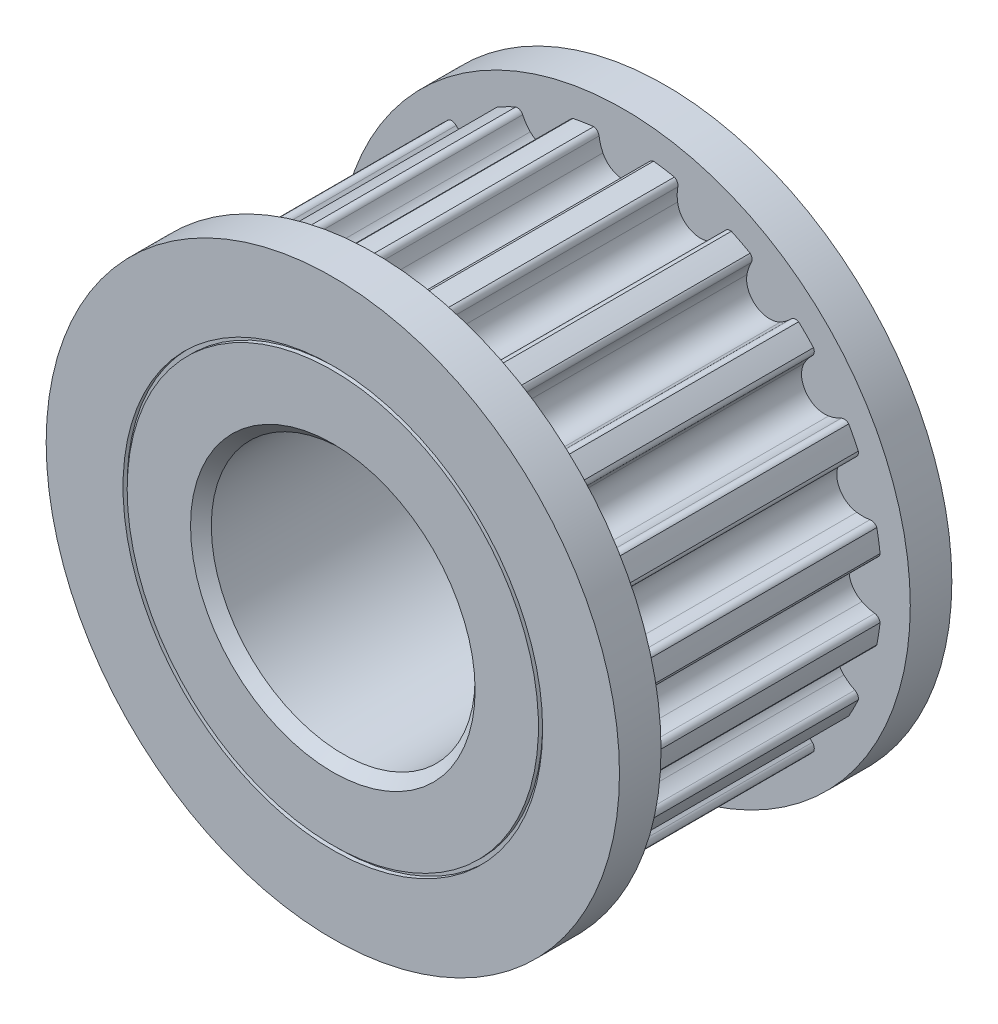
ISO-10303-21;
HEADER;
FILE_DESCRIPTION(('STEP AP214'),'2;1');
FILE_NAME('part.step','',(''),(''),'','','');
FILE_SCHEMA(('AUTOMOTIVE_DESIGN { 1 0 10303 214 1 1 1 1 }'));
ENDSEC;
DATA;
#1=APPLICATION_CONTEXT('core data for automotive mechanical design processes');
#2=APPLICATION_PROTOCOL_DEFINITION('international standard','automotive_design',2000,#1);
#3=PRODUCT_CONTEXT('',#1,'mechanical');
#4=PRODUCT('Part','Part','',(#3));
#5=PRODUCT_RELATED_PRODUCT_CATEGORY('part','',(#4));
#6=PRODUCT_DEFINITION_FORMATION('','',#4);
#7=PRODUCT_DEFINITION_CONTEXT('part definition',#1,'design');
#8=PRODUCT_DEFINITION('design','',#6,#7);
#9=PRODUCT_DEFINITION_SHAPE('','',#8);
#10=(LENGTH_UNIT() NAMED_UNIT(*) SI_UNIT(.MILLI.,.METRE.));
#11=(NAMED_UNIT(*) PLANE_ANGLE_UNIT() SI_UNIT($,.RADIAN.));
#12=(NAMED_UNIT(*) SI_UNIT($,.STERADIAN.) SOLID_ANGLE_UNIT());
#13=UNCERTAINTY_MEASURE_WITH_UNIT(LENGTH_MEASURE(1.E-05),#10,'distance_accuracy_value','');
#14=(GEOMETRIC_REPRESENTATION_CONTEXT(3) GLOBAL_UNCERTAINTY_ASSIGNED_CONTEXT((#13)) GLOBAL_UNIT_ASSIGNED_CONTEXT((#10,
#11,#12)) REPRESENTATION_CONTEXT('',''));
#15=CARTESIAN_POINT('',(0.,0.,0.));
#16=DIRECTION('',(0.,0.,1.));
#17=DIRECTION('',(1.,0.,0.));
#18=AXIS2_PLACEMENT_3D('',#15,#16,#17);
#19=CARTESIAN_POINT('',(4.83741466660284,3.51458748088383,6.));
#20=DIRECTION('',(0.,0.,-1.));
#21=DIRECTION('',(-1.,0.,0.));
#22=AXIS2_PLACEMENT_3D('',#19,#20,#21);
#23=CYLINDRICAL_SURFACE('',#22,0.555);
#24=CARTESIAN_POINT('',(4.83741466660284,3.51458748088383,11.));
#25=DIRECTION('',(0.,0.,-1.));
#26=DIRECTION('',(-1.,0.,0.));
#27=AXIS2_PLACEMENT_3D('',#24,#25,#26);
#28=CIRCLE('',#27,0.555);
#29=CARTESIAN_POINT('',(4.34742772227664,3.77523627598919,11.));
#30=VERTEX_POINT('',#29);
#31=CARTESIAN_POINT('',(4.93389210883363,2.96803729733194,11.));
#32=VERTEX_POINT('',#31);
#33=EDGE_CURVE('E762',#30,#32,#28,.F.);
#34=ORIENTED_EDGE('',*,*,#33,.F.);
#35=DIRECTION('',(0.,0.,-1.));
#36=VECTOR('',#35,1.);
#37=CARTESIAN_POINT('',(4.34742772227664,3.77523627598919,6.));
#38=LINE('',#37,#36);
#39=CARTESIAN_POINT('',(4.34742772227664,3.77523627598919,17.));
#40=VERTEX_POINT('',#39);
#41=EDGE_CURVE('E769',#30,#40,#38,.F.);
#42=ORIENTED_EDGE('',*,*,#41,.T.);
#43=CARTESIAN_POINT('',(4.83741466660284,3.51458748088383,17.));
#44=DIRECTION('',(0.,0.,-1.));
#45=DIRECTION('',(-1.,0.,0.));
#46=AXIS2_PLACEMENT_3D('',#43,#44,#45);
#47=CIRCLE('',#46,0.555);
#48=CARTESIAN_POINT('',(4.93389210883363,2.96803729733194,17.));
#49=VERTEX_POINT('',#48);
#50=EDGE_CURVE('E20',#49,#40,#47,.T.);
#51=ORIENTED_EDGE('',*,*,#50,.F.);
#52=DIRECTION('',(0.,0.,-1.));
#53=VECTOR('',#52,1.);
#54=CARTESIAN_POINT('',(4.93389210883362,2.96803729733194,6.));
#55=LINE('',#54,#53);
#56=EDGE_CURVE('E761',#49,#32,#55,.T.);
#57=ORIENTED_EDGE('',*,*,#56,.T.);
#58=EDGE_LOOP('',(#34,#42,#51,#57));
#59=FACE_BOUND('',#58,.T.);
#60=ADVANCED_FACE('F17',(#59),#23,.F.);
#61=CARTESIAN_POINT('',(4.76005887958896,3.95281240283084,6.));
#62=DIRECTION('',(0.,0.,-1.));
#63=DIRECTION('',(-1.,0.,0.));
#64=AXIS2_PLACEMENT_3D('',#61,#62,#63);
#65=CYLINDRICAL_SURFACE('',#64,1.);
#66=CARTESIAN_POINT('',(4.76005887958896,3.95281240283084,11.));
#67=DIRECTION('',(0.,0.,-1.));
#68=DIRECTION('',(-1.,0.,0.));
#69=AXIS2_PLACEMENT_3D('',#66,#67,#68);
#70=CIRCLE('',#69,1.);
#71=CARTESIAN_POINT('',(5.23729866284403,3.07403928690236,11.));
#72=VERTEX_POINT('',#71);
#73=EDGE_CURVE('E772',#32,#72,#70,.F.);
#74=ORIENTED_EDGE('',*,*,#73,.F.);
#75=ORIENTED_EDGE('',*,*,#56,.F.);
#76=CARTESIAN_POINT('',(4.76005887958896,3.95281240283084,17.));
#77=DIRECTION('',(0.,0.,-1.));
#78=DIRECTION('',(-1.,0.,0.));
#79=AXIS2_PLACEMENT_3D('',#76,#77,#78);
#80=CIRCLE('',#79,1.);
#81=CARTESIAN_POINT('',(5.23729866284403,3.07403928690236,17.));
#82=VERTEX_POINT('',#81);
#83=EDGE_CURVE('E751',#82,#49,#80,.T.);
#84=ORIENTED_EDGE('',*,*,#83,.F.);
#85=DIRECTION('',(0.,0.,1.));
#86=VECTOR('',#85,1.);
#87=CARTESIAN_POINT('',(5.23729866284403,3.07403928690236,6.));
#88=LINE('',#87,#86);
#89=EDGE_CURVE('E1487',#72,#82,#88,.T.);
#90=ORIENTED_EDGE('',*,*,#89,.F.);
#91=EDGE_LOOP('',(#74,#75,#84,#90));
#92=FACE_BOUND('',#91,.T.);
#93=ADVANCED_FACE('F771',(#92),#65,.F.);
#94=CARTESIAN_POINT('',(5.23028708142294,3.30559880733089,6.));
#95=DIRECTION('',(0.,0.,-1.));
#96=DIRECTION('',(-1.,0.,0.));
#97=AXIS2_PLACEMENT_3D('',#94,#95,#96);
#98=CYLINDRICAL_SURFACE('',#97,1.);
#99=CARTESIAN_POINT('',(5.23028708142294,3.30559880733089,11.));
#100=DIRECTION('',(0.,0.,-1.));
#101=DIRECTION('',(-1.,0.,0.));
#102=AXIS2_PLACEMENT_3D('',#99,#100,#101);
#103=CIRCLE('',#102,1.);
#104=CARTESIAN_POINT('',(4.5419993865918,4.03103664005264,11.));
#105=VERTEX_POINT('',#104);
#106=EDGE_CURVE('E1491',#105,#30,#103,.F.);
#107=ORIENTED_EDGE('',*,*,#106,.F.);
#108=DIRECTION('',(0.,0.,1.));
#109=VECTOR('',#108,1.);
#110=CARTESIAN_POINT('',(4.5419993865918,4.03103664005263,6.));
#111=LINE('',#110,#109);
#112=CARTESIAN_POINT('',(4.5419993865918,4.03103664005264,17.));
#113=VERTEX_POINT('',#112);
#114=EDGE_CURVE('E1479',#113,#105,#111,.F.);
#115=ORIENTED_EDGE('',*,*,#114,.F.);
#116=CARTESIAN_POINT('',(5.23028708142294,3.30559880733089,17.));
#117=DIRECTION('',(0.,0.,-1.));
#118=DIRECTION('',(-1.,0.,0.));
#119=AXIS2_PLACEMENT_3D('',#116,#117,#118);
#120=CIRCLE('',#119,1.);
#121=EDGE_CURVE('E774',#40,#113,#120,.T.);
#122=ORIENTED_EDGE('',*,*,#121,.F.);
#123=ORIENTED_EDGE('',*,*,#41,.F.);
#124=EDGE_LOOP('',(#107,#115,#122,#123));
#125=FACE_BOUND('',#124,.T.);
#126=ADVANCED_FACE('F1498',(#125),#98,.F.);
#127=CARTESIAN_POINT('',(5.3088846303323,2.94222331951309,6.));
#128=DIRECTION('',(0.,0.,1.));
#129=DIRECTION('',(1.,0.,0.));
#130=AXIS2_PLACEMENT_3D('',#127,#128,#129);
#131=CYLINDRICAL_SURFACE('',#130,0.15);
#132=CARTESIAN_POINT('',(5.3088846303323,2.94222331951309,17.));
#133=DIRECTION('',(0.,0.,1.));
#134=DIRECTION('',(1.,0.,0.));
#135=AXIS2_PLACEMENT_3D('',#132,#133,#134);
#136=CIRCLE('',#135,0.15);
#137=CARTESIAN_POINT('',(5.41767367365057,3.045494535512,17.));
#138=VERTEX_POINT('',#137);
#139=EDGE_CURVE('E756',#82,#138,#136,.F.);
#140=ORIENTED_EDGE('',*,*,#139,.T.);
#141=DIRECTION('',(0.,0.,1.));
#142=VECTOR('',#141,1.);
#143=CARTESIAN_POINT('',(5.41767367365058,3.04549453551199,6.));
#144=LINE('',#143,#142);
#145=CARTESIAN_POINT('',(5.41767367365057,3.045494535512,11.));
#146=VERTEX_POINT('',#145);
#147=EDGE_CURVE('E1475',#146,#138,#144,.T.);
#148=ORIENTED_EDGE('',*,*,#147,.F.);
#149=CARTESIAN_POINT('',(5.3088846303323,2.94222331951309,11.));
#150=DIRECTION('',(0.,0.,1.));
#151=DIRECTION('',(1.,0.,0.));
#152=AXIS2_PLACEMENT_3D('',#149,#150,#151);
#153=CIRCLE('',#152,0.15);
#154=EDGE_CURVE('E1488',#146,#72,#153,.T.);
#155=ORIENTED_EDGE('',*,*,#154,.T.);
#156=ORIENTED_EDGE('',*,*,#89,.T.);
#157=EDGE_LOOP('',(#140,#148,#155,#156));
#158=FACE_BOUND('',#157,.T.);
#159=ADVANCED_FACE('F1969',(#158),#131,.T.);
#160=CARTESIAN_POINT('',(4.43875623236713,4.1398523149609,6.));
#161=DIRECTION('',(0.,0.,1.));
#162=DIRECTION('',(1.,0.,0.));
#163=AXIS2_PLACEMENT_3D('',#160,#161,#162);
#164=CYLINDRICAL_SURFACE('',#163,0.15);
#165=CARTESIAN_POINT('',(4.43875623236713,4.1398523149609,17.));
#166=DIRECTION('',(0.,0.,1.));
#167=DIRECTION('',(1.,0.,0.));
#168=AXIS2_PLACEMENT_3D('',#165,#166,#167);
#169=CIRCLE('',#168,0.15);
#170=CARTESIAN_POINT('',(4.57059065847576,4.21140428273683,17.));
#171=VERTEX_POINT('',#170);
#172=EDGE_CURVE('E1480',#171,#113,#169,.F.);
#173=ORIENTED_EDGE('',*,*,#172,.T.);
#174=ORIENTED_EDGE('',*,*,#114,.T.);
#175=CARTESIAN_POINT('',(4.43875623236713,4.1398523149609,11.));
#176=DIRECTION('',(0.,0.,1.));
#177=DIRECTION('',(1.,0.,0.));
#178=AXIS2_PLACEMENT_3D('',#175,#176,#177);
#179=CIRCLE('',#178,0.15);
#180=CARTESIAN_POINT('',(4.57059065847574,4.21140428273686,11.));
#181=VERTEX_POINT('',#180);
#182=EDGE_CURVE('E1483',#105,#181,#179,.T.);
#183=ORIENTED_EDGE('',*,*,#182,.T.);
#184=DIRECTION('',(0.,0.,1.));
#185=VECTOR('',#184,1.);
#186=CARTESIAN_POINT('',(4.57059065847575,4.21140428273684,6.));
#187=LINE('',#186,#185);
#188=EDGE_CURVE('E1466',#171,#181,#187,.F.);
#189=ORIENTED_EDGE('',*,*,#188,.F.);
#190=EDGE_LOOP('',(#173,#174,#183,#189));
#191=FACE_BOUND('',#190,.T.);
#192=ADVANCED_FACE('F1505',(#191),#164,.T.);
#193=CARTESIAN_POINT('',(0.,0.,6.));
#194=DIRECTION('',(0.,0.,1.));
#195=DIRECTION('',(1.,0.,0.));
#196=AXIS2_PLACEMENT_3D('',#193,#194,#195);
#197=CYLINDRICAL_SURFACE('',#196,6.215);
#198=CARTESIAN_POINT('',(0.,0.,17.));
#199=DIRECTION('',(0.,0.,1.));
#200=DIRECTION('',(1.,0.,0.));
#201=AXIS2_PLACEMENT_3D('',#198,#199,#200);
#202=CIRCLE('',#201,6.215);
#203=CARTESIAN_POINT('',(5.64828552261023,2.59289329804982,17.));
#204=VERTEX_POINT('',#203);
#205=EDGE_CURVE('E1473',#138,#204,#202,.F.);
#206=ORIENTED_EDGE('',*,*,#205,.T.);
#207=DIRECTION('',(0.,0.,1.));
#208=VECTOR('',#207,1.);
#209=CARTESIAN_POINT('',(5.64828552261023,2.59289329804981,6.));
#210=LINE('',#209,#208);
#211=CARTESIAN_POINT('',(5.64828552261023,2.59289329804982,11.));
#212=VERTEX_POINT('',#211);
#213=EDGE_CURVE('E1462',#212,#204,#210,.T.);
#214=ORIENTED_EDGE('',*,*,#213,.F.);
#215=CARTESIAN_POINT('',(0.,0.,11.));
#216=DIRECTION('',(0.,0.,1.));
#217=DIRECTION('',(1.,0.,0.));
#218=AXIS2_PLACEMENT_3D('',#215,#216,#217);
#219=CIRCLE('',#218,6.215);
#220=EDGE_CURVE('E1476',#212,#146,#219,.T.);
#221=ORIENTED_EDGE('',*,*,#220,.T.);
#222=ORIENTED_EDGE('',*,*,#147,.T.);
#223=EDGE_LOOP('',(#206,#214,#221,#222));
#224=FACE_BOUND('',#223,.T.);
#225=ADVANCED_FACE('F1973',(#224),#197,.T.);
#226=CARTESIAN_POINT('',(0.,0.,6.));
#227=DIRECTION('',(0.,0.,1.));
#228=DIRECTION('',(1.,0.,0.));
#229=AXIS2_PLACEMENT_3D('',#226,#227,#228);
#230=CYLINDRICAL_SURFACE('',#229,6.215);
#231=CARTESIAN_POINT('',(0.,0.,17.));
#232=DIRECTION('',(0.,0.,1.));
#233=DIRECTION('',(1.,0.,0.));
#234=AXIS2_PLACEMENT_3D('',#231,#232,#233);
#235=CIRCLE('',#234,6.215);
#236=CARTESIAN_POINT('',(4.21140428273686,4.57059065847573,17.));
#237=VERTEX_POINT('',#236);
#238=EDGE_CURVE('E1467',#237,#171,#235,.F.);
#239=ORIENTED_EDGE('',*,*,#238,.T.);
#240=ORIENTED_EDGE('',*,*,#188,.T.);
#241=CARTESIAN_POINT('',(0.,0.,11.));
#242=DIRECTION('',(0.,0.,1.));
#243=DIRECTION('',(1.,0.,0.));
#244=AXIS2_PLACEMENT_3D('',#241,#242,#243);
#245=CIRCLE('',#244,6.215);
#246=CARTESIAN_POINT('',(4.21140428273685,4.57059065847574,11.));
#247=VERTEX_POINT('',#246);
#248=EDGE_CURVE('E1470',#181,#247,#245,.T.);
#249=ORIENTED_EDGE('',*,*,#248,.T.);
#250=DIRECTION('',(0.,0.,1.));
#251=VECTOR('',#250,1.);
#252=CARTESIAN_POINT('',(4.21140428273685,4.57059065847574,6.));
#253=LINE('',#252,#251);
#254=EDGE_CURVE('E1452',#237,#247,#253,.F.);
#255=ORIENTED_EDGE('',*,*,#254,.F.);
#256=EDGE_LOOP('',(#239,#240,#249,#255));
#257=FACE_BOUND('',#256,.T.);
#258=ADVANCED_FACE('F1508',(#257),#230,.T.);
#259=CARTESIAN_POINT('',(5.50079275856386,2.56558241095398,6.));
#260=DIRECTION('',(0.,0.,1.));
#261=DIRECTION('',(1.,0.,0.));
#262=AXIS2_PLACEMENT_3D('',#259,#260,#261);
#263=CYLINDRICAL_SURFACE('',#262,0.15);
#264=CARTESIAN_POINT('',(5.50079275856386,2.56558241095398,17.));
#265=DIRECTION('',(0.,0.,1.));
#266=DIRECTION('',(1.,0.,0.));
#267=AXIS2_PLACEMENT_3D('',#264,#265,#266);
#268=CIRCLE('',#267,0.15);
#269=CARTESIAN_POINT('',(5.56535694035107,2.43018866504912,17.));
#270=VERTEX_POINT('',#269);
#271=EDGE_CURVE('E1459',#204,#270,#268,.F.);
#272=ORIENTED_EDGE('',*,*,#271,.T.);
#273=DIRECTION('',(0.,0.,-1.));
#274=VECTOR('',#273,1.);
#275=CARTESIAN_POINT('',(5.56535694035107,2.43018866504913,6.));
#276=LINE('',#275,#274);
#277=CARTESIAN_POINT('',(5.56535694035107,2.43018866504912,11.));
#278=VERTEX_POINT('',#277);
#279=EDGE_CURVE('E1449',#270,#278,#276,.T.);
#280=ORIENTED_EDGE('',*,*,#279,.T.);
#281=CARTESIAN_POINT('',(5.50079275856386,2.56558241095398,11.));
#282=DIRECTION('',(0.,0.,1.));
#283=DIRECTION('',(1.,0.,0.));
#284=AXIS2_PLACEMENT_3D('',#281,#282,#283);
#285=CIRCLE('',#284,0.15);
#286=EDGE_CURVE('E1463',#278,#212,#285,.T.);
#287=ORIENTED_EDGE('',*,*,#286,.T.);
#288=ORIENTED_EDGE('',*,*,#213,.T.);
#289=EDGE_LOOP('',(#272,#280,#287,#288));
#290=FACE_BOUND('',#289,.T.);
#291=ADVANCED_FACE('F1976',(#290),#263,.T.);
#292=CARTESIAN_POINT('',(4.1398523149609,4.43875623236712,6.));
#293=DIRECTION('',(0.,0.,1.));
#294=DIRECTION('',(1.,0.,0.));
#295=AXIS2_PLACEMENT_3D('',#292,#293,#294);
#296=CYLINDRICAL_SURFACE('',#295,0.15);
#297=CARTESIAN_POINT('',(4.1398523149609,4.43875623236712,17.));
#298=DIRECTION('',(0.,0.,1.));
#299=DIRECTION('',(1.,0.,0.));
#300=AXIS2_PLACEMENT_3D('',#297,#298,#299);
#301=CIRCLE('',#300,0.15);
#302=CARTESIAN_POINT('',(4.03103664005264,4.54199938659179,17.));
#303=VERTEX_POINT('',#302);
#304=EDGE_CURVE('E1453',#303,#237,#301,.F.);
#305=ORIENTED_EDGE('',*,*,#304,.T.);
#306=ORIENTED_EDGE('',*,*,#254,.T.);
#307=CARTESIAN_POINT('',(4.1398523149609,4.43875623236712,11.));
#308=DIRECTION('',(0.,0.,1.));
#309=DIRECTION('',(1.,0.,0.));
#310=AXIS2_PLACEMENT_3D('',#307,#308,#309);
#311=CIRCLE('',#310,0.15);
#312=CARTESIAN_POINT('',(4.03103664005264,4.54199938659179,11.));
#313=VERTEX_POINT('',#312);
#314=EDGE_CURVE('E1456',#247,#313,#311,.T.);
#315=ORIENTED_EDGE('',*,*,#314,.T.);
#316=DIRECTION('',(0.,0.,-1.));
#317=VECTOR('',#316,1.);
#318=CARTESIAN_POINT('',(4.03103664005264,4.54199938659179,6.));
#319=LINE('',#318,#317);
#320=EDGE_CURVE('E1442',#313,#303,#319,.F.);
#321=ORIENTED_EDGE('',*,*,#320,.T.);
#322=EDGE_LOOP('',(#305,#306,#315,#321));
#323=FACE_BOUND('',#322,.T.);
#324=ADVANCED_FACE('F1513',(#323),#296,.T.);
#325=CARTESIAN_POINT('',(5.99578481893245,1.52756369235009,6.));
#326=DIRECTION('',(0.,0.,-1.));
#327=DIRECTION('',(-1.,0.,0.));
#328=AXIS2_PLACEMENT_3D('',#325,#326,#327);
#329=CYLINDRICAL_SURFACE('',#328,1.);
#330=CARTESIAN_POINT('',(5.99578481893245,1.52756369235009,11.));
#331=DIRECTION('',(0.,0.,-1.));
#332=DIRECTION('',(-1.,0.,0.));
#333=AXIS2_PLACEMENT_3D('',#330,#331,#332);
#334=CIRCLE('',#333,1.);
#335=CARTESIAN_POINT('',(5.30126163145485,2.24703401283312,11.));
#336=VERTEX_POINT('',#335);
#337=EDGE_CURVE('E1447',#278,#336,#334,.F.);
#338=ORIENTED_EDGE('',*,*,#337,.F.);
#339=ORIENTED_EDGE('',*,*,#279,.F.);
#340=CARTESIAN_POINT('',(5.99578481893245,1.52756369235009,17.));
#341=DIRECTION('',(0.,0.,-1.));
#342=DIRECTION('',(-1.,0.,0.));
#343=AXIS2_PLACEMENT_3D('',#340,#341,#342);
#344=CIRCLE('',#343,1.);
#345=CARTESIAN_POINT('',(5.30126163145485,2.24703401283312,17.));
#346=VERTEX_POINT('',#345);
#347=EDGE_CURVE('E1450',#346,#270,#344,.T.);
#348=ORIENTED_EDGE('',*,*,#347,.F.);
#349=DIRECTION('',(0.,0.,-1.));
#350=VECTOR('',#349,1.);
#351=CARTESIAN_POINT('',(5.30126163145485,2.24703401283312,6.));
#352=LINE('',#351,#350);
#353=EDGE_CURVE('E1439',#346,#336,#352,.T.);
#354=ORIENTED_EDGE('',*,*,#353,.T.);
#355=EDGE_LOOP('',(#338,#339,#348,#354));
#356=FACE_BOUND('',#355,.T.);
#357=ADVANCED_FACE('F1981',(#356),#329,.F.);
#358=CARTESIAN_POINT('',(3.30559880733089,5.23028708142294,6.));
#359=DIRECTION('',(0.,0.,-1.));
#360=DIRECTION('',(-1.,0.,0.));
#361=AXIS2_PLACEMENT_3D('',#358,#359,#360);
#362=CYLINDRICAL_SURFACE('',#361,1.);
#363=CARTESIAN_POINT('',(3.30559880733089,5.23028708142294,11.));
#364=DIRECTION('',(0.,0.,-1.));
#365=DIRECTION('',(-1.,0.,0.));
#366=AXIS2_PLACEMENT_3D('',#363,#364,#365);
#367=CIRCLE('',#366,1.);
#368=CARTESIAN_POINT('',(3.7752362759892,4.34742772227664,11.));
#369=VERTEX_POINT('',#368);
#370=EDGE_CURVE('E1443',#369,#313,#367,.F.);
#371=ORIENTED_EDGE('',*,*,#370,.F.);
#372=DIRECTION('',(0.,0.,-1.));
#373=VECTOR('',#372,1.);
#374=CARTESIAN_POINT('',(3.7752362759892,4.34742772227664,6.));
#375=LINE('',#374,#373);
#376=CARTESIAN_POINT('',(3.7752362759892,4.34742772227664,17.));
#377=VERTEX_POINT('',#376);
#378=EDGE_CURVE('E1432',#369,#377,#375,.F.);
#379=ORIENTED_EDGE('',*,*,#378,.T.);
#380=CARTESIAN_POINT('',(3.30559880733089,5.23028708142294,17.));
#381=DIRECTION('',(0.,0.,-1.));
#382=DIRECTION('',(-1.,0.,0.));
#383=AXIS2_PLACEMENT_3D('',#380,#381,#382);
#384=CIRCLE('',#383,1.);
#385=EDGE_CURVE('E1445',#303,#377,#384,.T.);
#386=ORIENTED_EDGE('',*,*,#385,.F.);
#387=ORIENTED_EDGE('',*,*,#320,.F.);
#388=EDGE_LOOP('',(#371,#379,#386,#387));
#389=FACE_BOUND('',#388,.T.);
#390=ADVANCED_FACE('F1522',(#389),#362,.F.);
#391=CARTESIAN_POINT('',(5.68672200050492,1.84772798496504,6.));
#392=DIRECTION('',(0.,0.,-1.));
#393=DIRECTION('',(-1.,0.,0.));
#394=AXIS2_PLACEMENT_3D('',#391,#392,#393);
#395=CYLINDRICAL_SURFACE('',#394,0.555);
#396=CARTESIAN_POINT('',(5.68672200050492,1.84772798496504,11.));
#397=DIRECTION('',(0.,0.,-1.));
#398=DIRECTION('',(-1.,0.,0.));
#399=AXIS2_PLACEMENT_3D('',#396,#397,#398);
#400=CIRCLE('',#399,0.555);
#401=CARTESIAN_POINT('',(5.60958420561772,1.29811470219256,11.));
#402=VERTEX_POINT('',#401);
#403=EDGE_CURVE('E1437',#336,#402,#400,.F.);
#404=ORIENTED_EDGE('',*,*,#403,.F.);
#405=ORIENTED_EDGE('',*,*,#353,.F.);
#406=CARTESIAN_POINT('',(5.68672200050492,1.84772798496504,17.));
#407=DIRECTION('',(0.,0.,-1.));
#408=DIRECTION('',(-1.,0.,0.));
#409=AXIS2_PLACEMENT_3D('',#406,#407,#408);
#410=CIRCLE('',#409,0.555);
#411=CARTESIAN_POINT('',(5.60958420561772,1.29811470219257,17.));
#412=VERTEX_POINT('',#411);
#413=EDGE_CURVE('E1440',#412,#346,#410,.T.);
#414=ORIENTED_EDGE('',*,*,#413,.F.);
#415=DIRECTION('',(0.,0.,-1.));
#416=VECTOR('',#415,1.);
#417=CARTESIAN_POINT('',(5.60958420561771,1.29811470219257,6.));
#418=LINE('',#417,#416);
#419=EDGE_CURVE('E1429',#412,#402,#418,.T.);
#420=ORIENTED_EDGE('',*,*,#419,.T.);
#421=EDGE_LOOP('',(#404,#405,#414,#420));
#422=FACE_BOUND('',#421,.T.);
#423=ADVANCED_FACE('F1989',(#422),#395,.F.);
#424=CARTESIAN_POINT('',(3.51458748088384,4.83741466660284,6.));
#425=DIRECTION('',(0.,0.,-1.));
#426=DIRECTION('',(-1.,0.,0.));
#427=AXIS2_PLACEMENT_3D('',#424,#425,#426);
#428=CYLINDRICAL_SURFACE('',#427,0.555);
#429=CARTESIAN_POINT('',(3.51458748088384,4.83741466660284,11.));
#430=DIRECTION('',(0.,0.,-1.));
#431=DIRECTION('',(-1.,0.,0.));
#432=AXIS2_PLACEMENT_3D('',#429,#430,#431);
#433=CIRCLE('',#432,0.555);
#434=CARTESIAN_POINT('',(2.96803729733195,4.93389210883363,11.));
#435=VERTEX_POINT('',#434);
#436=EDGE_CURVE('E1433',#435,#369,#433,.F.);
#437=ORIENTED_EDGE('',*,*,#436,.F.);
#438=DIRECTION('',(0.,0.,-1.));
#439=VECTOR('',#438,1.);
#440=CARTESIAN_POINT('',(2.96803729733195,4.93389210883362,6.));
#441=LINE('',#440,#439);
#442=CARTESIAN_POINT('',(2.96803729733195,4.93389210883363,17.));
#443=VERTEX_POINT('',#442);
#444=EDGE_CURVE('E1422',#435,#443,#441,.F.);
#445=ORIENTED_EDGE('',*,*,#444,.T.);
#446=CARTESIAN_POINT('',(3.51458748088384,4.83741466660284,17.));
#447=DIRECTION('',(0.,0.,-1.));
#448=DIRECTION('',(-1.,0.,0.));
#449=AXIS2_PLACEMENT_3D('',#446,#447,#448);
#450=CIRCLE('',#449,0.555);
#451=EDGE_CURVE('E1435',#377,#443,#450,.T.);
#452=ORIENTED_EDGE('',*,*,#451,.F.);
#453=ORIENTED_EDGE('',*,*,#378,.F.);
#454=EDGE_LOOP('',(#437,#445,#452,#453));
#455=FACE_BOUND('',#454,.T.);
#456=ADVANCED_FACE('F1526',(#455),#428,.F.);
#457=CARTESIAN_POINT('',(5.74857122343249,2.28840890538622,6.));
#458=DIRECTION('',(0.,0.,-1.));
#459=DIRECTION('',(-1.,0.,0.));
#460=AXIS2_PLACEMENT_3D('',#457,#458,#459);
#461=CYLINDRICAL_SURFACE('',#460,1.);
#462=CARTESIAN_POINT('',(5.74857122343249,2.28840890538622,11.));
#463=DIRECTION('',(0.,0.,-1.));
#464=DIRECTION('',(-1.,0.,0.));
#465=AXIS2_PLACEMENT_3D('',#462,#463,#464);
#466=CIRCLE('',#465,1.);
#467=CARTESIAN_POINT('',(5.93089740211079,1.3051708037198,11.));
#468=VERTEX_POINT('',#467);
#469=EDGE_CURVE('E1427',#402,#468,#466,.F.);
#470=ORIENTED_EDGE('',*,*,#469,.F.);
#471=ORIENTED_EDGE('',*,*,#419,.F.);
#472=CARTESIAN_POINT('',(5.74857122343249,2.28840890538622,17.));
#473=DIRECTION('',(0.,0.,-1.));
#474=DIRECTION('',(-1.,0.,0.));
#475=AXIS2_PLACEMENT_3D('',#472,#473,#474);
#476=CIRCLE('',#475,1.);
#477=CARTESIAN_POINT('',(5.93089740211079,1.3051708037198,17.));
#478=VERTEX_POINT('',#477);
#479=EDGE_CURVE('E1430',#478,#412,#476,.T.);
#480=ORIENTED_EDGE('',*,*,#479,.F.);
#481=DIRECTION('',(0.,0.,1.));
#482=VECTOR('',#481,1.);
#483=CARTESIAN_POINT('',(5.93089740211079,1.3051708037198,6.));
#484=LINE('',#483,#482);
#485=EDGE_CURVE('E1418',#468,#478,#484,.T.);
#486=ORIENTED_EDGE('',*,*,#485,.F.);
#487=EDGE_LOOP('',(#470,#471,#480,#486));
#488=FACE_BOUND('',#487,.T.);
#489=ADVANCED_FACE('F1991',(#488),#461,.F.);
#490=CARTESIAN_POINT('',(3.95281240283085,4.76005887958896,6.));
#491=DIRECTION('',(0.,0.,-1.));
#492=DIRECTION('',(-1.,0.,0.));
#493=AXIS2_PLACEMENT_3D('',#490,#491,#492);
#494=CYLINDRICAL_SURFACE('',#493,1.);
#495=CARTESIAN_POINT('',(3.95281240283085,4.76005887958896,11.));
#496=DIRECTION('',(0.,0.,-1.));
#497=DIRECTION('',(-1.,0.,0.));
#498=AXIS2_PLACEMENT_3D('',#495,#496,#497);
#499=CIRCLE('',#498,1.);
#500=CARTESIAN_POINT('',(3.07403928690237,5.23729866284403,11.));
#501=VERTEX_POINT('',#500);
#502=EDGE_CURVE('E1423',#501,#435,#499,.F.);
#503=ORIENTED_EDGE('',*,*,#502,.F.);
#504=DIRECTION('',(0.,0.,1.));
#505=VECTOR('',#504,1.);
#506=CARTESIAN_POINT('',(3.07403928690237,5.23729866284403,6.));
#507=LINE('',#506,#505);
#508=CARTESIAN_POINT('',(3.07403928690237,5.23729866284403,17.));
#509=VERTEX_POINT('',#508);
#510=EDGE_CURVE('E1409',#509,#501,#507,.F.);
#511=ORIENTED_EDGE('',*,*,#510,.F.);
#512=CARTESIAN_POINT('',(3.95281240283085,4.76005887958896,17.));
#513=DIRECTION('',(0.,0.,-1.));
#514=DIRECTION('',(-1.,0.,0.));
#515=AXIS2_PLACEMENT_3D('',#512,#513,#514);
#516=CIRCLE('',#515,1.);
#517=EDGE_CURVE('E1425',#443,#509,#516,.T.);
#518=ORIENTED_EDGE('',*,*,#517,.F.);
#519=ORIENTED_EDGE('',*,*,#444,.F.);
#520=EDGE_LOOP('',(#503,#511,#518,#519));
#521=FACE_BOUND('',#520,.T.);
#522=ADVANCED_FACE('F1533',(#521),#494,.F.);
#523=CARTESIAN_POINT('',(5.95824632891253,1.15768508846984,6.));
#524=DIRECTION('',(0.,0.,1.));
#525=DIRECTION('',(1.,0.,0.));
#526=AXIS2_PLACEMENT_3D('',#523,#524,#525);
#527=CYLINDRICAL_SURFACE('',#526,0.15);
#528=CARTESIAN_POINT('',(5.95824632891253,1.15768508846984,17.));
#529=DIRECTION('',(0.,0.,1.));
#530=DIRECTION('',(1.,0.,0.));
#531=AXIS2_PLACEMENT_3D('',#528,#529,#530);
#532=CIRCLE('',#531,0.15);
#533=CARTESIAN_POINT('',(6.09362341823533,1.22228418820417,17.));
#534=VERTEX_POINT('',#533);
#535=EDGE_CURVE('E1416',#478,#534,#532,.F.);
#536=ORIENTED_EDGE('',*,*,#535,.T.);
#537=DIRECTION('',(0.,0.,1.));
#538=VECTOR('',#537,1.);
#539=CARTESIAN_POINT('',(6.09362341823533,1.22228418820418,6.));
#540=LINE('',#539,#538);
#541=CARTESIAN_POINT('',(6.09362341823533,1.22228418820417,11.));
#542=VERTEX_POINT('',#541);
#543=EDGE_CURVE('E1405',#542,#534,#540,.T.);
#544=ORIENTED_EDGE('',*,*,#543,.F.);
#545=CARTESIAN_POINT('',(5.95824632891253,1.15768508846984,11.));
#546=DIRECTION('',(0.,0.,1.));
#547=DIRECTION('',(1.,0.,0.));
#548=AXIS2_PLACEMENT_3D('',#545,#546,#547);
#549=CIRCLE('',#548,0.15);
#550=EDGE_CURVE('E1419',#542,#468,#549,.T.);
#551=ORIENTED_EDGE('',*,*,#550,.T.);
#552=ORIENTED_EDGE('',*,*,#485,.T.);
#553=EDGE_LOOP('',(#536,#544,#551,#552));
#554=FACE_BOUND('',#553,.T.);
#555=ADVANCED_FACE('F1995',(#554),#527,.T.);
#556=CARTESIAN_POINT('',(2.9422233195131,5.30888463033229,6.));
#557=DIRECTION('',(0.,0.,1.));
#558=DIRECTION('',(1.,0.,0.));
#559=AXIS2_PLACEMENT_3D('',#556,#557,#558);
#560=CYLINDRICAL_SURFACE('',#559,0.15);
#561=CARTESIAN_POINT('',(2.9422233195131,5.30888463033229,17.));
#562=DIRECTION('',(0.,0.,1.));
#563=DIRECTION('',(1.,0.,0.));
#564=AXIS2_PLACEMENT_3D('',#561,#562,#563);
#565=CIRCLE('',#564,0.15);
#566=CARTESIAN_POINT('',(3.045494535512,5.41767367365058,17.));
#567=VERTEX_POINT('',#566);
#568=EDGE_CURVE('E1410',#567,#509,#565,.F.);
#569=ORIENTED_EDGE('',*,*,#568,.T.);
#570=ORIENTED_EDGE('',*,*,#510,.T.);
#571=CARTESIAN_POINT('',(2.9422233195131,5.30888463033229,11.));
#572=DIRECTION('',(0.,0.,1.));
#573=DIRECTION('',(1.,0.,0.));
#574=AXIS2_PLACEMENT_3D('',#571,#572,#573);
#575=CIRCLE('',#574,0.15);
#576=CARTESIAN_POINT('',(3.04549453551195,5.41767367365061,11.));
#577=VERTEX_POINT('',#576);
#578=EDGE_CURVE('E1413',#501,#577,#575,.T.);
#579=ORIENTED_EDGE('',*,*,#578,.T.);
#580=DIRECTION('',(0.,0.,1.));
#581=VECTOR('',#580,1.);
#582=CARTESIAN_POINT('',(3.045494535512,5.41767367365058,6.));
#583=LINE('',#582,#581);
#584=EDGE_CURVE('E1396',#567,#577,#583,.F.);
#585=ORIENTED_EDGE('',*,*,#584,.F.);
#586=EDGE_LOOP('',(#569,#570,#579,#585));
#587=FACE_BOUND('',#586,.T.);
#588=ADVANCED_FACE('F1539',(#587),#560,.T.);
#589=CARTESIAN_POINT('',(0.,0.,6.));
#590=DIRECTION('',(0.,0.,1.));
#591=DIRECTION('',(1.,0.,0.));
#592=AXIS2_PLACEMENT_3D('',#589,#590,#591);
#593=CYLINDRICAL_SURFACE('',#592,6.215);
#594=CARTESIAN_POINT('',(0.,0.,17.));
#595=DIRECTION('',(0.,0.,1.));
#596=DIRECTION('',(1.,0.,0.));
#597=AXIS2_PLACEMENT_3D('',#594,#595,#596);
#598=CIRCLE('',#597,6.215);
#599=CARTESIAN_POINT('',(6.17308684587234,0.720571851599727,17.));
#600=VERTEX_POINT('',#599);
#601=EDGE_CURVE('E1403',#534,#600,#598,.F.);
#602=ORIENTED_EDGE('',*,*,#601,.T.);
#603=DIRECTION('',(0.,0.,1.));
#604=VECTOR('',#603,1.);
#605=CARTESIAN_POINT('',(6.17308684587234,0.720571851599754,6.));
#606=LINE('',#605,#604);
#607=CARTESIAN_POINT('',(6.17308684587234,0.720571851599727,11.));
#608=VERTEX_POINT('',#607);
#609=EDGE_CURVE('E1392',#608,#600,#606,.T.);
#610=ORIENTED_EDGE('',*,*,#609,.F.);
#611=CARTESIAN_POINT('',(0.,0.,11.));
#612=DIRECTION('',(0.,0.,1.));
#613=DIRECTION('',(1.,0.,0.));
#614=AXIS2_PLACEMENT_3D('',#611,#612,#613);
#615=CIRCLE('',#614,6.215);
#616=EDGE_CURVE('E1406',#608,#542,#615,.T.);
#617=ORIENTED_EDGE('',*,*,#616,.T.);
#618=ORIENTED_EDGE('',*,*,#543,.T.);
#619=EDGE_LOOP('',(#602,#610,#617,#618));
#620=FACE_BOUND('',#619,.T.);
#621=ADVANCED_FACE('F1998',(#620),#593,.T.);
#622=CARTESIAN_POINT('',(0.,0.,6.));
#623=DIRECTION('',(0.,0.,1.));
#624=DIRECTION('',(1.,0.,0.));
#625=AXIS2_PLACEMENT_3D('',#622,#623,#624);
#626=CYLINDRICAL_SURFACE('',#625,6.215);
#627=CARTESIAN_POINT('',(0.,0.,17.));
#628=DIRECTION('',(0.,0.,1.));
#629=DIRECTION('',(1.,0.,0.));
#630=AXIS2_PLACEMENT_3D('',#627,#628,#629);
#631=CIRCLE('',#630,6.215);
#632=CARTESIAN_POINT('',(2.59289329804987,5.64828552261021,17.));
#633=VERTEX_POINT('',#632);
#634=EDGE_CURVE('E1397',#633,#567,#631,.F.);
#635=ORIENTED_EDGE('',*,*,#634,.T.);
#636=ORIENTED_EDGE('',*,*,#584,.T.);
#637=CARTESIAN_POINT('',(0.,0.,11.));
#638=DIRECTION('',(0.,0.,1.));
#639=DIRECTION('',(1.,0.,0.));
#640=AXIS2_PLACEMENT_3D('',#637,#638,#639);
#641=CIRCLE('',#640,6.215);
#642=CARTESIAN_POINT('',(2.59289329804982,5.64828552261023,11.));
#643=VERTEX_POINT('',#642);
#644=EDGE_CURVE('E1400',#577,#643,#641,.T.);
#645=ORIENTED_EDGE('',*,*,#644,.T.);
#646=DIRECTION('',(0.,0.,1.));
#647=VECTOR('',#646,1.);
#648=CARTESIAN_POINT('',(2.59289329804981,5.64828552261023,6.));
#649=LINE('',#648,#647);
#650=EDGE_CURVE('E1382',#633,#643,#649,.F.);
#651=ORIENTED_EDGE('',*,*,#650,.F.);
#652=EDGE_LOOP('',(#635,#636,#645,#651));
#653=FACE_BOUND('',#652,.T.);
#654=ADVANCED_FACE('F1542',(#653),#626,.T.);
#655=CARTESIAN_POINT('',(6.02437336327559,0.740175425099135,6.));
#656=DIRECTION('',(0.,0.,1.));
#657=DIRECTION('',(1.,0.,0.));
#658=AXIS2_PLACEMENT_3D('',#655,#656,#657);
#659=CYLINDRICAL_SURFACE('',#658,0.15);
#660=CARTESIAN_POINT('',(6.02437336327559,0.740175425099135,17.));
#661=DIRECTION('',(0.,0.,1.));
#662=DIRECTION('',(1.,0.,0.));
#663=AXIS2_PLACEMENT_3D('',#660,#661,#662);
#664=CIRCLE('',#663,0.15);
#665=CARTESIAN_POINT('',(6.04393858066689,0.591456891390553,17.));
#666=VERTEX_POINT('',#665);
#667=EDGE_CURVE('E1389',#600,#666,#664,.F.);
#668=ORIENTED_EDGE('',*,*,#667,.T.);
#669=DIRECTION('',(0.,0.,-1.));
#670=VECTOR('',#669,1.);
#671=CARTESIAN_POINT('',(6.04393858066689,0.591456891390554,6.));
#672=LINE('',#671,#670);
#673=CARTESIAN_POINT('',(6.04393858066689,0.591456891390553,11.));
#674=VERTEX_POINT('',#673);
#675=EDGE_CURVE('E1379',#666,#674,#672,.T.);
#676=ORIENTED_EDGE('',*,*,#675,.T.);
#677=CARTESIAN_POINT('',(6.02437336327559,0.740175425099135,11.));
#678=DIRECTION('',(0.,0.,1.));
#679=DIRECTION('',(1.,0.,0.));
#680=AXIS2_PLACEMENT_3D('',#677,#678,#679);
#681=CIRCLE('',#680,0.15);
#682=EDGE_CURVE('E1393',#674,#608,#681,.T.);
#683=ORIENTED_EDGE('',*,*,#682,.T.);
#684=ORIENTED_EDGE('',*,*,#609,.T.);
#685=EDGE_LOOP('',(#668,#676,#683,#684));
#686=FACE_BOUND('',#685,.T.);
#687=ADVANCED_FACE('F2002',(#686),#659,.T.);
#688=CARTESIAN_POINT('',(2.56558241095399,5.50079275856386,6.));
#689=DIRECTION('',(0.,0.,1.));
#690=DIRECTION('',(1.,0.,0.));
#691=AXIS2_PLACEMENT_3D('',#688,#689,#690);
#692=CYLINDRICAL_SURFACE('',#691,0.15);
#693=CARTESIAN_POINT('',(2.56558241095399,5.50079275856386,17.));
#694=DIRECTION('',(0.,0.,1.));
#695=DIRECTION('',(1.,0.,0.));
#696=AXIS2_PLACEMENT_3D('',#693,#694,#695);
#697=CIRCLE('',#696,0.15);
#698=CARTESIAN_POINT('',(2.43018866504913,5.56535694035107,17.));
#699=VERTEX_POINT('',#698);
#700=EDGE_CURVE('E1383',#699,#633,#697,.F.);
#701=ORIENTED_EDGE('',*,*,#700,.T.);
#702=ORIENTED_EDGE('',*,*,#650,.T.);
#703=CARTESIAN_POINT('',(2.56558241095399,5.50079275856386,11.));
#704=DIRECTION('',(0.,0.,1.));
#705=DIRECTION('',(1.,0.,0.));
#706=AXIS2_PLACEMENT_3D('',#703,#704,#705);
#707=CIRCLE('',#706,0.15);
#708=CARTESIAN_POINT('',(2.43018866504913,5.56535694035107,11.));
#709=VERTEX_POINT('',#708);
#710=EDGE_CURVE('E1386',#643,#709,#707,.T.);
#711=ORIENTED_EDGE('',*,*,#710,.T.);
#712=DIRECTION('',(0.,0.,-1.));
#713=VECTOR('',#712,1.);
#714=CARTESIAN_POINT('',(2.43018866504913,5.56535694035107,6.));
#715=LINE('',#714,#713);
#716=EDGE_CURVE('E1372',#709,#699,#715,.F.);
#717=ORIENTED_EDGE('',*,*,#716,.T.);
#718=EDGE_LOOP('',(#701,#702,#711,#717));
#719=FACE_BOUND('',#718,.T.);
#720=ADVANCED_FACE('F1547',(#719),#692,.T.);
#721=CARTESIAN_POINT('',(6.17437336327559,-0.4,6.));
#722=DIRECTION('',(0.,0.,-1.));
#723=DIRECTION('',(-1.,0.,0.));
#724=AXIS2_PLACEMENT_3D('',#721,#722,#723);
#725=CYLINDRICAL_SURFACE('',#724,1.);
#726=CARTESIAN_POINT('',(6.17437336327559,-0.4,11.));
#727=DIRECTION('',(0.,0.,-1.));
#728=DIRECTION('',(-1.,0.,0.));
#729=AXIS2_PLACEMENT_3D('',#726,#727,#728);
#730=CIRCLE('',#729,1.);
#731=CARTESIAN_POINT('',(5.73617111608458,0.498876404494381,11.));
#732=VERTEX_POINT('',#731);
#733=EDGE_CURVE('E1377',#674,#732,#730,.F.);
#734=ORIENTED_EDGE('',*,*,#733,.F.);
#735=ORIENTED_EDGE('',*,*,#675,.F.);
#736=CARTESIAN_POINT('',(6.17437336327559,-0.4,17.));
#737=DIRECTION('',(0.,0.,-1.));
#738=DIRECTION('',(-1.,0.,0.));
#739=AXIS2_PLACEMENT_3D('',#736,#737,#738);
#740=CIRCLE('',#739,1.);
#741=CARTESIAN_POINT('',(5.73617111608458,0.49887640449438,17.));
#742=VERTEX_POINT('',#741);
#743=EDGE_CURVE('E1380',#742,#666,#740,.T.);
#744=ORIENTED_EDGE('',*,*,#743,.F.);
#745=DIRECTION('',(0.,0.,-1.));
#746=VECTOR('',#745,1.);
#747=CARTESIAN_POINT('',(5.73617111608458,0.498876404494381,6.));
#748=LINE('',#747,#746);
#749=EDGE_CURVE('E1369',#742,#732,#748,.T.);
#750=ORIENTED_EDGE('',*,*,#749,.T.);
#751=EDGE_LOOP('',(#734,#735,#744,#750));
#752=FACE_BOUND('',#751,.T.);
#753=ADVANCED_FACE('F2007',(#752),#725,.F.);
#754=CARTESIAN_POINT('',(1.5275636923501,5.99578481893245,6.));
#755=DIRECTION('',(0.,0.,-1.));
#756=DIRECTION('',(-1.,0.,0.));
#757=AXIS2_PLACEMENT_3D('',#754,#755,#756);
#758=CYLINDRICAL_SURFACE('',#757,1.);
#759=CARTESIAN_POINT('',(1.5275636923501,5.99578481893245,11.));
#760=DIRECTION('',(0.,0.,-1.));
#761=DIRECTION('',(-1.,0.,0.));
#762=AXIS2_PLACEMENT_3D('',#759,#760,#761);
#763=CIRCLE('',#762,1.);
#764=CARTESIAN_POINT('',(2.24703401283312,5.30126163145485,11.));
#765=VERTEX_POINT('',#764);
#766=EDGE_CURVE('E1373',#765,#709,#763,.F.);
#767=ORIENTED_EDGE('',*,*,#766,.F.);
#768=DIRECTION('',(0.,0.,-1.));
#769=VECTOR('',#768,1.);
#770=CARTESIAN_POINT('',(2.24703401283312,5.30126163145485,6.));
#771=LINE('',#770,#769);
#772=CARTESIAN_POINT('',(2.24703401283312,5.30126163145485,17.));
#773=VERTEX_POINT('',#772);
#774=EDGE_CURVE('E1362',#765,#773,#771,.F.);
#775=ORIENTED_EDGE('',*,*,#774,.T.);
#776=CARTESIAN_POINT('',(1.5275636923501,5.99578481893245,17.));
#777=DIRECTION('',(0.,0.,-1.));
#778=DIRECTION('',(-1.,0.,0.));
#779=AXIS2_PLACEMENT_3D('',#776,#777,#778);
#780=CIRCLE('',#779,1.);
#781=EDGE_CURVE('E1375',#699,#773,#780,.T.);
#782=ORIENTED_EDGE('',*,*,#781,.F.);
#783=ORIENTED_EDGE('',*,*,#716,.F.);
#784=EDGE_LOOP('',(#767,#775,#782,#783));
#785=FACE_BOUND('',#784,.T.);
#786=ADVANCED_FACE('F1556',(#785),#758,.F.);
#787=CARTESIAN_POINT('',(5.97937336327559,0.,6.));
#788=DIRECTION('',(0.,0.,-1.));
#789=DIRECTION('',(-1.,0.,0.));
#790=AXIS2_PLACEMENT_3D('',#787,#788,#789);
#791=CYLINDRICAL_SURFACE('',#790,0.555);
#792=CARTESIAN_POINT('',(5.97937336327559,0.,11.));
#793=DIRECTION('',(0.,0.,-1.));
#794=DIRECTION('',(-1.,0.,0.));
#795=AXIS2_PLACEMENT_3D('',#792,#793,#794);
#796=CIRCLE('',#795,0.555);
#797=CARTESIAN_POINT('',(5.73617111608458,-0.498876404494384,11.));
#798=VERTEX_POINT('',#797);
#799=EDGE_CURVE('E1367',#732,#798,#796,.F.);
#800=ORIENTED_EDGE('',*,*,#799,.F.);
#801=ORIENTED_EDGE('',*,*,#749,.F.);
#802=CARTESIAN_POINT('',(5.97937336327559,0.,17.));
#803=DIRECTION('',(0.,0.,-1.));
#804=DIRECTION('',(-1.,0.,0.));
#805=AXIS2_PLACEMENT_3D('',#802,#803,#804);
#806=CIRCLE('',#805,0.555);
#807=CARTESIAN_POINT('',(5.73617111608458,-0.498876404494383,17.));
#808=VERTEX_POINT('',#807);
#809=EDGE_CURVE('E1370',#808,#742,#806,.T.);
#810=ORIENTED_EDGE('',*,*,#809,.F.);
#811=DIRECTION('',(0.,0.,-1.));
#812=VECTOR('',#811,1.);
#813=CARTESIAN_POINT('',(5.73617111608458,-0.498876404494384,6.));
#814=LINE('',#813,#812);
#815=EDGE_CURVE('E1359',#808,#798,#814,.T.);
#816=ORIENTED_EDGE('',*,*,#815,.T.);
#817=EDGE_LOOP('',(#800,#801,#810,#816));
#818=FACE_BOUND('',#817,.T.);
#819=ADVANCED_FACE('F2015',(#818),#791,.F.);
#820=CARTESIAN_POINT('',(1.84772798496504,5.68672200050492,6.));
#821=DIRECTION('',(0.,0.,-1.));
#822=DIRECTION('',(-1.,0.,0.));
#823=AXIS2_PLACEMENT_3D('',#820,#821,#822);
#824=CYLINDRICAL_SURFACE('',#823,0.555);
#825=CARTESIAN_POINT('',(1.84772798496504,5.68672200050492,11.));
#826=DIRECTION('',(0.,0.,-1.));
#827=DIRECTION('',(-1.,0.,0.));
#828=AXIS2_PLACEMENT_3D('',#825,#826,#827);
#829=CIRCLE('',#828,0.555);
#830=CARTESIAN_POINT('',(1.29811470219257,5.60958420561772,11.));
#831=VERTEX_POINT('',#830);
#832=EDGE_CURVE('E1363',#831,#765,#829,.F.);
#833=ORIENTED_EDGE('',*,*,#832,.F.);
#834=DIRECTION('',(0.,0.,-1.));
#835=VECTOR('',#834,1.);
#836=CARTESIAN_POINT('',(1.29811470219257,5.60958420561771,6.));
#837=LINE('',#836,#835);
#838=CARTESIAN_POINT('',(1.29811470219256,5.60958420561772,17.));
#839=VERTEX_POINT('',#838);
#840=EDGE_CURVE('E1352',#831,#839,#837,.F.);
#841=ORIENTED_EDGE('',*,*,#840,.T.);
#842=CARTESIAN_POINT('',(1.84772798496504,5.68672200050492,17.));
#843=DIRECTION('',(0.,0.,-1.));
#844=DIRECTION('',(-1.,0.,0.));
#845=AXIS2_PLACEMENT_3D('',#842,#843,#844);
#846=CIRCLE('',#845,0.555);
#847=EDGE_CURVE('E1365',#773,#839,#846,.T.);
#848=ORIENTED_EDGE('',*,*,#847,.F.);
#849=ORIENTED_EDGE('',*,*,#774,.F.);
#850=EDGE_LOOP('',(#833,#841,#848,#849));
#851=FACE_BOUND('',#850,.T.);
#852=ADVANCED_FACE('F1560',(#851),#824,.F.);
#853=CARTESIAN_POINT('',(6.17437336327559,0.4,6.));
#854=DIRECTION('',(0.,0.,-1.));
#855=DIRECTION('',(-1.,0.,0.));
#856=AXIS2_PLACEMENT_3D('',#853,#854,#855);
#857=CYLINDRICAL_SURFACE('',#856,1.);
#858=CARTESIAN_POINT('',(6.17437336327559,0.4,11.));
#859=DIRECTION('',(0.,0.,-1.));
#860=DIRECTION('',(-1.,0.,0.));
#861=AXIS2_PLACEMENT_3D('',#858,#859,#860);
#862=CIRCLE('',#861,1.);
#863=CARTESIAN_POINT('',(6.04393858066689,-0.591456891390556,11.));
#864=VERTEX_POINT('',#863);
#865=EDGE_CURVE('E1357',#798,#864,#862,.F.);
#866=ORIENTED_EDGE('',*,*,#865,.F.);
#867=ORIENTED_EDGE('',*,*,#815,.F.);
#868=CARTESIAN_POINT('',(6.17437336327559,0.4,17.));
#869=DIRECTION('',(0.,0.,-1.));
#870=DIRECTION('',(-1.,0.,0.));
#871=AXIS2_PLACEMENT_3D('',#868,#869,#870);
#872=CIRCLE('',#871,1.);
#873=CARTESIAN_POINT('',(6.04393858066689,-0.591456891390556,17.));
#874=VERTEX_POINT('',#873);
#875=EDGE_CURVE('E1360',#874,#808,#872,.T.);
#876=ORIENTED_EDGE('',*,*,#875,.F.);
#877=DIRECTION('',(0.,0.,1.));
#878=VECTOR('',#877,1.);
#879=CARTESIAN_POINT('',(6.04393858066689,-0.591456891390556,6.));
#880=LINE('',#879,#878);
#881=EDGE_CURVE('E1348',#864,#874,#880,.T.);
#882=ORIENTED_EDGE('',*,*,#881,.F.);
#883=EDGE_LOOP('',(#866,#867,#876,#882));
#884=FACE_BOUND('',#883,.T.);
#885=ADVANCED_FACE('F2017',(#884),#857,.F.);
#886=CARTESIAN_POINT('',(2.28840890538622,5.74857122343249,6.));
#887=DIRECTION('',(0.,0.,-1.));
#888=DIRECTION('',(-1.,0.,0.));
#889=AXIS2_PLACEMENT_3D('',#886,#887,#888);
#890=CYLINDRICAL_SURFACE('',#889,1.);
#891=CARTESIAN_POINT('',(2.28840890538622,5.74857122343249,11.));
#892=DIRECTION('',(0.,0.,-1.));
#893=DIRECTION('',(-1.,0.,0.));
#894=AXIS2_PLACEMENT_3D('',#891,#892,#893);
#895=CIRCLE('',#894,1.);
#896=CARTESIAN_POINT('',(1.30517080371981,5.93089740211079,11.));
#897=VERTEX_POINT('',#896);
#898=EDGE_CURVE('E1353',#897,#831,#895,.F.);
#899=ORIENTED_EDGE('',*,*,#898,.F.);
#900=DIRECTION('',(0.,0.,1.));
#901=VECTOR('',#900,1.);
#902=CARTESIAN_POINT('',(1.30517080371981,5.93089740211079,6.));
#903=LINE('',#902,#901);
#904=CARTESIAN_POINT('',(1.30517080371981,5.93089740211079,17.));
#905=VERTEX_POINT('',#904);
#906=EDGE_CURVE('E1339',#905,#897,#903,.F.);
#907=ORIENTED_EDGE('',*,*,#906,.F.);
#908=CARTESIAN_POINT('',(2.28840890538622,5.74857122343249,17.));
#909=DIRECTION('',(0.,0.,-1.));
#910=DIRECTION('',(-1.,0.,0.));
#911=AXIS2_PLACEMENT_3D('',#908,#909,#910);
#912=CIRCLE('',#911,1.);
#913=EDGE_CURVE('E1355',#839,#905,#912,.T.);
#914=ORIENTED_EDGE('',*,*,#913,.F.);
#915=ORIENTED_EDGE('',*,*,#840,.F.);
#916=EDGE_LOOP('',(#899,#907,#914,#915));
#917=FACE_BOUND('',#916,.T.);
#918=ADVANCED_FACE('F1567',(#917),#890,.F.);
#919=CARTESIAN_POINT('',(6.02437336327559,-0.74017542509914,6.));
#920=DIRECTION('',(0.,0.,1.));
#921=DIRECTION('',(1.,0.,0.));
#922=AXIS2_PLACEMENT_3D('',#919,#920,#921);
#923=CYLINDRICAL_SURFACE('',#922,0.15);
#924=CARTESIAN_POINT('',(6.02437336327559,-0.74017542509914,17.));
#925=DIRECTION('',(0.,0.,1.));
#926=DIRECTION('',(1.,0.,0.));
#927=AXIS2_PLACEMENT_3D('',#924,#925,#926);
#928=CIRCLE('',#927,0.15);
#929=CARTESIAN_POINT('',(6.17308684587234,-0.720571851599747,17.));
#930=VERTEX_POINT('',#929);
#931=EDGE_CURVE('E1346',#874,#930,#928,.F.);
#932=ORIENTED_EDGE('',*,*,#931,.T.);
#933=DIRECTION('',(0.,0.,1.));
#934=VECTOR('',#933,1.);
#935=CARTESIAN_POINT('',(6.17308684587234,-0.720571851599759,6.));
#936=LINE('',#935,#934);
#937=CARTESIAN_POINT('',(6.17308684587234,-0.720571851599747,11.));
#938=VERTEX_POINT('',#937);
#939=EDGE_CURVE('E1335',#938,#930,#936,.T.);
#940=ORIENTED_EDGE('',*,*,#939,.F.);
#941=CARTESIAN_POINT('',(6.02437336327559,-0.74017542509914,11.));
#942=DIRECTION('',(0.,0.,1.));
#943=DIRECTION('',(1.,0.,0.));
#944=AXIS2_PLACEMENT_3D('',#941,#942,#943);
#945=CIRCLE('',#944,0.15);
#946=EDGE_CURVE('E1349',#938,#864,#945,.T.);
#947=ORIENTED_EDGE('',*,*,#946,.T.);
#948=ORIENTED_EDGE('',*,*,#881,.T.);
#949=EDGE_LOOP('',(#932,#940,#947,#948));
#950=FACE_BOUND('',#949,.T.);
#951=ADVANCED_FACE('F2021',(#950),#923,.T.);
#952=CARTESIAN_POINT('',(1.15768508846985,5.95824632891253,6.));
#953=DIRECTION('',(0.,0.,1.));
#954=DIRECTION('',(1.,0.,0.));
#955=AXIS2_PLACEMENT_3D('',#952,#953,#954);
#956=CYLINDRICAL_SURFACE('',#955,0.15);
#957=CARTESIAN_POINT('',(1.15768508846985,5.95824632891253,17.));
#958=DIRECTION('',(0.,0.,1.));
#959=DIRECTION('',(1.,0.,0.));
#960=AXIS2_PLACEMENT_3D('',#957,#958,#959);
#961=CIRCLE('',#960,0.15);
#962=CARTESIAN_POINT('',(1.22228418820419,6.09362341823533,17.));
#963=VERTEX_POINT('',#962);
#964=EDGE_CURVE('E1340',#963,#905,#961,.F.);
#965=ORIENTED_EDGE('',*,*,#964,.T.);
#966=ORIENTED_EDGE('',*,*,#906,.T.);
#967=CARTESIAN_POINT('',(1.15768508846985,5.95824632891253,11.));
#968=DIRECTION('',(0.,0.,1.));
#969=DIRECTION('',(1.,0.,0.));
#970=AXIS2_PLACEMENT_3D('',#967,#968,#969);
#971=CIRCLE('',#970,0.15);
#972=CARTESIAN_POINT('',(1.22228418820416,6.09362341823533,11.));
#973=VERTEX_POINT('',#972);
#974=EDGE_CURVE('E1343',#897,#973,#971,.T.);
#975=ORIENTED_EDGE('',*,*,#974,.T.);
#976=DIRECTION('',(0.,0.,1.));
#977=VECTOR('',#976,1.);
#978=CARTESIAN_POINT('',(1.22228418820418,6.09362341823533,6.));
#979=LINE('',#978,#977);
#980=EDGE_CURVE('E1326',#963,#973,#979,.F.);
#981=ORIENTED_EDGE('',*,*,#980,.F.);
#982=EDGE_LOOP('',(#965,#966,#975,#981));
#983=FACE_BOUND('',#982,.T.);
#984=ADVANCED_FACE('F1573',(#983),#956,.T.);
#985=CARTESIAN_POINT('',(0.,0.,6.));
#986=DIRECTION('',(0.,0.,1.));
#987=DIRECTION('',(1.,0.,0.));
#988=AXIS2_PLACEMENT_3D('',#985,#986,#987);
#989=CYLINDRICAL_SURFACE('',#988,6.215);
#990=CARTESIAN_POINT('',(0.,0.,17.));
#991=DIRECTION('',(0.,0.,1.));
#992=DIRECTION('',(1.,0.,0.));
#993=AXIS2_PLACEMENT_3D('',#990,#991,#992);
#994=CIRCLE('',#993,6.215);
#995=CARTESIAN_POINT('',(6.09362341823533,-1.22228418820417,17.));
#996=VERTEX_POINT('',#995);
#997=EDGE_CURVE('E1333',#930,#996,#994,.F.);
#998=ORIENTED_EDGE('',*,*,#997,.T.);
#999=DIRECTION('',(0.,0.,1.));
#1000=VECTOR('',#999,1.);
#1001=CARTESIAN_POINT('',(6.09362341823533,-1.22228418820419,6.));
#1002=LINE('',#1001,#1000);
#1003=CARTESIAN_POINT('',(6.09362341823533,-1.22228418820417,11.));
#1004=VERTEX_POINT('',#1003);
#1005=EDGE_CURVE('E1322',#1004,#996,#1002,.T.);
#1006=ORIENTED_EDGE('',*,*,#1005,.F.);
#1007=CARTESIAN_POINT('',(0.,0.,11.));
#1008=DIRECTION('',(0.,0.,1.));
#1009=DIRECTION('',(1.,0.,0.));
#1010=AXIS2_PLACEMENT_3D('',#1007,#1008,#1009);
#1011=CIRCLE('',#1010,6.215);
#1012=EDGE_CURVE('E1336',#1004,#938,#1011,.T.);
#1013=ORIENTED_EDGE('',*,*,#1012,.T.);
#1014=ORIENTED_EDGE('',*,*,#939,.T.);
#1015=EDGE_LOOP('',(#998,#1006,#1013,#1014));
#1016=FACE_BOUND('',#1015,.T.);
#1017=ADVANCED_FACE('F2024',(#1016),#989,.T.);
#1018=CARTESIAN_POINT('',(0.,0.,6.));
#1019=DIRECTION('',(0.,0.,1.));
#1020=DIRECTION('',(1.,0.,0.));
#1021=AXIS2_PLACEMENT_3D('',#1018,#1019,#1020);
#1022=CYLINDRICAL_SURFACE('',#1021,6.215);
#1023=CARTESIAN_POINT('',(0.,0.,17.));
#1024=DIRECTION('',(0.,0.,1.));
#1025=DIRECTION('',(1.,0.,0.));
#1026=AXIS2_PLACEMENT_3D('',#1023,#1024,#1025);
#1027=CIRCLE('',#1026,6.215);
#1028=CARTESIAN_POINT('',(0.720571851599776,6.17308684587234,17.));
#1029=VERTEX_POINT('',#1028);
#1030=EDGE_CURVE('E1327',#1029,#963,#1027,.F.);
#1031=ORIENTED_EDGE('',*,*,#1030,.T.);
#1032=ORIENTED_EDGE('',*,*,#980,.T.);
#1033=CARTESIAN_POINT('',(0.,0.,11.));
#1034=DIRECTION('',(0.,0.,1.));
#1035=DIRECTION('',(1.,0.,0.));
#1036=AXIS2_PLACEMENT_3D('',#1033,#1034,#1035);
#1037=CIRCLE('',#1036,6.215);
#1038=CARTESIAN_POINT('',(0.720571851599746,6.17308684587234,11.));
#1039=VERTEX_POINT('',#1038);
#1040=EDGE_CURVE('E1330',#973,#1039,#1037,.T.);
#1041=ORIENTED_EDGE('',*,*,#1040,.T.);
#1042=DIRECTION('',(0.,0.,1.));
#1043=VECTOR('',#1042,1.);
#1044=CARTESIAN_POINT('',(0.720571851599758,6.17308684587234,6.));
#1045=LINE('',#1044,#1043);
#1046=EDGE_CURVE('E1312',#1029,#1039,#1045,.F.);
#1047=ORIENTED_EDGE('',*,*,#1046,.F.);
#1048=EDGE_LOOP('',(#1031,#1032,#1041,#1047));
#1049=FACE_BOUND('',#1048,.T.);
#1050=ADVANCED_FACE('F1576',(#1049),#1022,.T.);
#1051=CARTESIAN_POINT('',(5.95824632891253,-1.15768508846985,6.));
#1052=DIRECTION('',(0.,0.,1.));
#1053=DIRECTION('',(1.,0.,0.));
#1054=AXIS2_PLACEMENT_3D('',#1051,#1052,#1053);
#1055=CYLINDRICAL_SURFACE('',#1054,0.15);
#1056=CARTESIAN_POINT('',(5.95824632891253,-1.15768508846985,17.));
#1057=DIRECTION('',(0.,0.,1.));
#1058=DIRECTION('',(1.,0.,0.));
#1059=AXIS2_PLACEMENT_3D('',#1056,#1057,#1058);
#1060=CIRCLE('',#1059,0.15);
#1061=CARTESIAN_POINT('',(5.93089740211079,-1.30517080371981,17.));
#1062=VERTEX_POINT('',#1061);
#1063=EDGE_CURVE('E1319',#996,#1062,#1060,.F.);
#1064=ORIENTED_EDGE('',*,*,#1063,.T.);
#1065=DIRECTION('',(0.,0.,-1.));
#1066=VECTOR('',#1065,1.);
#1067=CARTESIAN_POINT('',(5.93089740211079,-1.30517080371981,6.));
#1068=LINE('',#1067,#1066);
#1069=CARTESIAN_POINT('',(5.93089740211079,-1.30517080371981,11.));
#1070=VERTEX_POINT('',#1069);
#1071=EDGE_CURVE('E1309',#1062,#1070,#1068,.T.);
#1072=ORIENTED_EDGE('',*,*,#1071,.T.);
#1073=CARTESIAN_POINT('',(5.95824632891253,-1.15768508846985,11.));
#1074=DIRECTION('',(0.,0.,1.));
#1075=DIRECTION('',(1.,0.,0.));
#1076=AXIS2_PLACEMENT_3D('',#1073,#1074,#1075);
#1077=CIRCLE('',#1076,0.15);
#1078=EDGE_CURVE('E1323',#1070,#1004,#1077,.T.);
#1079=ORIENTED_EDGE('',*,*,#1078,.T.);
#1080=ORIENTED_EDGE('',*,*,#1005,.T.);
#1081=EDGE_LOOP('',(#1064,#1072,#1079,#1080));
#1082=FACE_BOUND('',#1081,.T.);
#1083=ADVANCED_FACE('F2028',(#1082),#1055,.T.);
#1084=CARTESIAN_POINT('',(0.740175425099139,6.02437336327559,6.));
#1085=DIRECTION('',(0.,0.,1.));
#1086=DIRECTION('',(1.,0.,0.));
#1087=AXIS2_PLACEMENT_3D('',#1084,#1085,#1086);
#1088=CYLINDRICAL_SURFACE('',#1087,0.15);
#1089=CARTESIAN_POINT('',(0.740175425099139,6.02437336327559,17.));
#1090=DIRECTION('',(0.,0.,1.));
#1091=DIRECTION('',(1.,0.,0.));
#1092=AXIS2_PLACEMENT_3D('',#1089,#1090,#1091);
#1093=CIRCLE('',#1092,0.15);
#1094=CARTESIAN_POINT('',(0.591456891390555,6.04393858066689,17.));
#1095=VERTEX_POINT('',#1094);
#1096=EDGE_CURVE('E1313',#1095,#1029,#1093,.F.);
#1097=ORIENTED_EDGE('',*,*,#1096,.T.);
#1098=ORIENTED_EDGE('',*,*,#1046,.T.);
#1099=CARTESIAN_POINT('',(0.740175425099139,6.02437336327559,11.));
#1100=DIRECTION('',(0.,0.,1.));
#1101=DIRECTION('',(1.,0.,0.));
#1102=AXIS2_PLACEMENT_3D('',#1099,#1100,#1101);
#1103=CIRCLE('',#1102,0.15);
#1104=CARTESIAN_POINT('',(0.591456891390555,6.04393858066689,11.));
#1105=VERTEX_POINT('',#1104);
#1106=EDGE_CURVE('E1316',#1039,#1105,#1103,.T.);
#1107=ORIENTED_EDGE('',*,*,#1106,.T.);
#1108=DIRECTION('',(0.,0.,-1.));
#1109=VECTOR('',#1108,1.);
#1110=CARTESIAN_POINT('',(0.591456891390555,6.04393858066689,6.));
#1111=LINE('',#1110,#1109);
#1112=EDGE_CURVE('E1302',#1105,#1095,#1111,.F.);
#1113=ORIENTED_EDGE('',*,*,#1112,.T.);
#1114=EDGE_LOOP('',(#1097,#1098,#1107,#1113));
#1115=FACE_BOUND('',#1114,.T.);
#1116=ADVANCED_FACE('F1581',(#1115),#1088,.T.);
#1117=CARTESIAN_POINT('',(5.74857122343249,-2.28840890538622,6.));
#1118=DIRECTION('',(0.,0.,-1.));
#1119=DIRECTION('',(-1.,0.,0.));
#1120=AXIS2_PLACEMENT_3D('',#1117,#1118,#1119);
#1121=CYLINDRICAL_SURFACE('',#1120,1.);
#1122=CARTESIAN_POINT('',(5.74857122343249,-2.28840890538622,11.));
#1123=DIRECTION('',(0.,0.,-1.));
#1124=DIRECTION('',(-1.,0.,0.));
#1125=AXIS2_PLACEMENT_3D('',#1122,#1123,#1124);
#1126=CIRCLE('',#1125,1.);
#1127=CARTESIAN_POINT('',(5.60958420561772,-1.29811470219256,11.));
#1128=VERTEX_POINT('',#1127);
#1129=EDGE_CURVE('E1307',#1070,#1128,#1126,.F.);
#1130=ORIENTED_EDGE('',*,*,#1129,.F.);
#1131=ORIENTED_EDGE('',*,*,#1071,.F.);
#1132=CARTESIAN_POINT('',(5.74857122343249,-2.28840890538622,17.));
#1133=DIRECTION('',(0.,0.,-1.));
#1134=DIRECTION('',(-1.,0.,0.));
#1135=AXIS2_PLACEMENT_3D('',#1132,#1133,#1134);
#1136=CIRCLE('',#1135,1.);
#1137=CARTESIAN_POINT('',(5.60958420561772,-1.29811470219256,17.));
#1138=VERTEX_POINT('',#1137);
#1139=EDGE_CURVE('E1310',#1138,#1062,#1136,.T.);
#1140=ORIENTED_EDGE('',*,*,#1139,.F.);
#1141=DIRECTION('',(0.,0.,-1.));
#1142=VECTOR('',#1141,1.);
#1143=CARTESIAN_POINT('',(5.60958420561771,-1.29811470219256,6.));
#1144=LINE('',#1143,#1142);
#1145=EDGE_CURVE('E1299',#1138,#1128,#1144,.T.);
#1146=ORIENTED_EDGE('',*,*,#1145,.T.);
#1147=EDGE_LOOP('',(#1130,#1131,#1140,#1146));
#1148=FACE_BOUND('',#1147,.T.);
#1149=ADVANCED_FACE('F2033',(#1148),#1121,.F.);
#1150=CARTESIAN_POINT('',(-0.4,6.17437336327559,6.));
#1151=DIRECTION('',(0.,0.,-1.));
#1152=DIRECTION('',(-1.,0.,0.));
#1153=AXIS2_PLACEMENT_3D('',#1150,#1151,#1152);
#1154=CYLINDRICAL_SURFACE('',#1153,1.);
#1155=CARTESIAN_POINT('',(-0.4,6.17437336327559,11.));
#1156=DIRECTION('',(0.,0.,-1.));
#1157=DIRECTION('',(-1.,0.,0.));
#1158=AXIS2_PLACEMENT_3D('',#1155,#1156,#1157);
#1159=CIRCLE('',#1158,1.);
#1160=CARTESIAN_POINT('',(0.498876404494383,5.73617111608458,11.));
#1161=VERTEX_POINT('',#1160);
#1162=EDGE_CURVE('E1303',#1161,#1105,#1159,.F.);
#1163=ORIENTED_EDGE('',*,*,#1162,.F.);
#1164=DIRECTION('',(0.,0.,-1.));
#1165=VECTOR('',#1164,1.);
#1166=CARTESIAN_POINT('',(0.498876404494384,5.73617111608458,6.));
#1167=LINE('',#1166,#1165);
#1168=CARTESIAN_POINT('',(0.498876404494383,5.73617111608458,17.));
#1169=VERTEX_POINT('',#1168);
#1170=EDGE_CURVE('E1292',#1161,#1169,#1167,.F.);
#1171=ORIENTED_EDGE('',*,*,#1170,.T.);
#1172=CARTESIAN_POINT('',(-0.4,6.17437336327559,17.));
#1173=DIRECTION('',(0.,0.,-1.));
#1174=DIRECTION('',(-1.,0.,0.));
#1175=AXIS2_PLACEMENT_3D('',#1172,#1173,#1174);
#1176=CIRCLE('',#1175,1.);
#1177=EDGE_CURVE('E1305',#1095,#1169,#1176,.T.);
#1178=ORIENTED_EDGE('',*,*,#1177,.F.);
#1179=ORIENTED_EDGE('',*,*,#1112,.F.);
#1180=EDGE_LOOP('',(#1163,#1171,#1178,#1179));
#1181=FACE_BOUND('',#1180,.T.);
#1182=ADVANCED_FACE('F1590',(#1181),#1154,.F.);
#1183=CARTESIAN_POINT('',(5.68672200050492,-1.84772798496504,6.));
#1184=DIRECTION('',(0.,0.,-1.));
#1185=DIRECTION('',(-1.,0.,0.));
#1186=AXIS2_PLACEMENT_3D('',#1183,#1184,#1185);
#1187=CYLINDRICAL_SURFACE('',#1186,0.555);
#1188=CARTESIAN_POINT('',(5.68672200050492,-1.84772798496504,11.));
#1189=DIRECTION('',(0.,0.,-1.));
#1190=DIRECTION('',(-1.,0.,0.));
#1191=AXIS2_PLACEMENT_3D('',#1188,#1189,#1190);
#1192=CIRCLE('',#1191,0.555);
#1193=CARTESIAN_POINT('',(5.30126163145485,-2.24703401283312,11.));
#1194=VERTEX_POINT('',#1193);
#1195=EDGE_CURVE('E1297',#1128,#1194,#1192,.F.);
#1196=ORIENTED_EDGE('',*,*,#1195,.F.);
#1197=ORIENTED_EDGE('',*,*,#1145,.F.);
#1198=CARTESIAN_POINT('',(5.68672200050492,-1.84772798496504,17.));
#1199=DIRECTION('',(0.,0.,-1.));
#1200=DIRECTION('',(-1.,0.,0.));
#1201=AXIS2_PLACEMENT_3D('',#1198,#1199,#1200);
#1202=CIRCLE('',#1201,0.555);
#1203=CARTESIAN_POINT('',(5.30126163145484,-2.24703401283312,17.));
#1204=VERTEX_POINT('',#1203);
#1205=EDGE_CURVE('E1300',#1204,#1138,#1202,.T.);
#1206=ORIENTED_EDGE('',*,*,#1205,.F.);
#1207=DIRECTION('',(0.,0.,-1.));
#1208=VECTOR('',#1207,1.);
#1209=CARTESIAN_POINT('',(5.30126163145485,-2.24703401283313,6.));
#1210=LINE('',#1209,#1208);
#1211=EDGE_CURVE('E1289',#1204,#1194,#1210,.T.);
#1212=ORIENTED_EDGE('',*,*,#1211,.T.);
#1213=EDGE_LOOP('',(#1196,#1197,#1206,#1212));
#1214=FACE_BOUND('',#1213,.T.);
#1215=ADVANCED_FACE('F2041',(#1214),#1187,.F.);
#1216=CARTESIAN_POINT('',(0.,5.97937336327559,6.));
#1217=DIRECTION('',(0.,0.,-1.));
#1218=DIRECTION('',(-1.,0.,0.));
#1219=AXIS2_PLACEMENT_3D('',#1216,#1217,#1218);
#1220=CYLINDRICAL_SURFACE('',#1219,0.555);
#1221=CARTESIAN_POINT('',(0.,5.97937336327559,11.));
#1222=DIRECTION('',(0.,0.,-1.));
#1223=DIRECTION('',(-1.,0.,0.));
#1224=AXIS2_PLACEMENT_3D('',#1221,#1222,#1223);
#1225=CIRCLE('',#1224,0.555);
#1226=CARTESIAN_POINT('',(-0.498876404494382,5.73617111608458,11.));
#1227=VERTEX_POINT('',#1226);
#1228=EDGE_CURVE('E1293',#1227,#1161,#1225,.F.);
#1229=ORIENTED_EDGE('',*,*,#1228,.F.);
#1230=DIRECTION('',(0.,0.,-1.));
#1231=VECTOR('',#1230,1.);
#1232=CARTESIAN_POINT('',(-0.498876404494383,5.73617111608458,6.));
#1233=LINE('',#1232,#1231);
#1234=CARTESIAN_POINT('',(-0.498876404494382,5.73617111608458,17.));
#1235=VERTEX_POINT('',#1234);
#1236=EDGE_CURVE('E1282',#1227,#1235,#1233,.F.);
#1237=ORIENTED_EDGE('',*,*,#1236,.T.);
#1238=CARTESIAN_POINT('',(0.,5.97937336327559,17.));
#1239=DIRECTION('',(0.,0.,-1.));
#1240=DIRECTION('',(-1.,0.,0.));
#1241=AXIS2_PLACEMENT_3D('',#1238,#1239,#1240);
#1242=CIRCLE('',#1241,0.555);
#1243=EDGE_CURVE('E1295',#1169,#1235,#1242,.T.);
#1244=ORIENTED_EDGE('',*,*,#1243,.F.);
#1245=ORIENTED_EDGE('',*,*,#1170,.F.);
#1246=EDGE_LOOP('',(#1229,#1237,#1244,#1245));
#1247=FACE_BOUND('',#1246,.T.);
#1248=ADVANCED_FACE('F1594',(#1247),#1220,.F.);
#1249=CARTESIAN_POINT('',(5.99578481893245,-1.5275636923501,6.));
#1250=DIRECTION('',(0.,0.,-1.));
#1251=DIRECTION('',(-1.,0.,0.));
#1252=AXIS2_PLACEMENT_3D('',#1249,#1250,#1251);
#1253=CYLINDRICAL_SURFACE('',#1252,1.);
#1254=CARTESIAN_POINT('',(5.99578481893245,-1.5275636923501,11.));
#1255=DIRECTION('',(0.,0.,-1.));
#1256=DIRECTION('',(-1.,0.,0.));
#1257=AXIS2_PLACEMENT_3D('',#1254,#1255,#1256);
#1258=CIRCLE('',#1257,1.);
#1259=CARTESIAN_POINT('',(5.56535694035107,-2.43018866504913,11.));
#1260=VERTEX_POINT('',#1259);
#1261=EDGE_CURVE('E1287',#1194,#1260,#1258,.F.);
#1262=ORIENTED_EDGE('',*,*,#1261,.F.);
#1263=ORIENTED_EDGE('',*,*,#1211,.F.);
#1264=CARTESIAN_POINT('',(5.99578481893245,-1.5275636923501,17.));
#1265=DIRECTION('',(0.,0.,-1.));
#1266=DIRECTION('',(-1.,0.,0.));
#1267=AXIS2_PLACEMENT_3D('',#1264,#1265,#1266);
#1268=CIRCLE('',#1267,1.);
#1269=CARTESIAN_POINT('',(5.56535694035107,-2.43018866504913,17.));
#1270=VERTEX_POINT('',#1269);
#1271=EDGE_CURVE('E1290',#1270,#1204,#1268,.T.);
#1272=ORIENTED_EDGE('',*,*,#1271,.F.);
#1273=DIRECTION('',(0.,0.,1.));
#1274=VECTOR('',#1273,1.);
#1275=CARTESIAN_POINT('',(5.56535694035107,-2.43018866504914,6.));
#1276=LINE('',#1275,#1274);
#1277=EDGE_CURVE('E1278',#1260,#1270,#1276,.T.);
#1278=ORIENTED_EDGE('',*,*,#1277,.F.);
#1279=EDGE_LOOP('',(#1262,#1263,#1272,#1278));
#1280=FACE_BOUND('',#1279,.T.);
#1281=ADVANCED_FACE('F2043',(#1280),#1253,.F.);
#1282=CARTESIAN_POINT('',(0.4,6.17437336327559,6.));
#1283=DIRECTION('',(0.,0.,-1.));
#1284=DIRECTION('',(-1.,0.,0.));
#1285=AXIS2_PLACEMENT_3D('',#1282,#1283,#1284);
#1286=CYLINDRICAL_SURFACE('',#1285,1.);
#1287=CARTESIAN_POINT('',(0.4,6.17437336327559,11.));
#1288=DIRECTION('',(0.,0.,-1.));
#1289=DIRECTION('',(-1.,0.,0.));
#1290=AXIS2_PLACEMENT_3D('',#1287,#1288,#1289);
#1291=CIRCLE('',#1290,1.);
#1292=CARTESIAN_POINT('',(-0.591456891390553,6.04393858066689,11.));
#1293=VERTEX_POINT('',#1292);
#1294=EDGE_CURVE('E1283',#1293,#1227,#1291,.F.);
#1295=ORIENTED_EDGE('',*,*,#1294,.F.);
#1296=DIRECTION('',(0.,0.,1.));
#1297=VECTOR('',#1296,1.);
#1298=CARTESIAN_POINT('',(-0.591456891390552,6.04393858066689,6.));
#1299=LINE('',#1298,#1297);
#1300=CARTESIAN_POINT('',(-0.591456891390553,6.04393858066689,17.));
#1301=VERTEX_POINT('',#1300);
#1302=EDGE_CURVE('E1269',#1301,#1293,#1299,.F.);
#1303=ORIENTED_EDGE('',*,*,#1302,.F.);
#1304=CARTESIAN_POINT('',(0.4,6.17437336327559,17.));
#1305=DIRECTION('',(0.,0.,-1.));
#1306=DIRECTION('',(-1.,0.,0.));
#1307=AXIS2_PLACEMENT_3D('',#1304,#1305,#1306);
#1308=CIRCLE('',#1307,1.);
#1309=EDGE_CURVE('E1285',#1235,#1301,#1308,.T.);
#1310=ORIENTED_EDGE('',*,*,#1309,.F.);
#1311=ORIENTED_EDGE('',*,*,#1236,.F.);
#1312=EDGE_LOOP('',(#1295,#1303,#1310,#1311));
#1313=FACE_BOUND('',#1312,.T.);
#1314=ADVANCED_FACE('F1601',(#1313),#1286,.F.);
#1315=CARTESIAN_POINT('',(5.50079275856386,-2.56558241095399,6.));
#1316=DIRECTION('',(0.,0.,1.));
#1317=DIRECTION('',(1.,0.,0.));
#1318=AXIS2_PLACEMENT_3D('',#1315,#1316,#1317);
#1319=CYLINDRICAL_SURFACE('',#1318,0.15);
#1320=CARTESIAN_POINT('',(5.50079275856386,-2.56558241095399,17.));
#1321=DIRECTION('',(0.,0.,1.));
#1322=DIRECTION('',(1.,0.,0.));
#1323=AXIS2_PLACEMENT_3D('',#1320,#1321,#1322);
#1324=CIRCLE('',#1323,0.15);
#1325=CARTESIAN_POINT('',(5.64828552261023,-2.59289329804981,17.));
#1326=VERTEX_POINT('',#1325);
#1327=EDGE_CURVE('E1276',#1270,#1326,#1324,.F.);
#1328=ORIENTED_EDGE('',*,*,#1327,.T.);
#1329=DIRECTION('',(0.,0.,1.));
#1330=VECTOR('',#1329,1.);
#1331=CARTESIAN_POINT('',(5.64828552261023,-2.59289329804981,6.));
#1332=LINE('',#1331,#1330);
#1333=CARTESIAN_POINT('',(5.64828552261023,-2.59289329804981,11.));
#1334=VERTEX_POINT('',#1333);
#1335=EDGE_CURVE('E1265',#1334,#1326,#1332,.T.);
#1336=ORIENTED_EDGE('',*,*,#1335,.F.);
#1337=CARTESIAN_POINT('',(5.50079275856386,-2.56558241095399,11.));
#1338=DIRECTION('',(0.,0.,1.));
#1339=DIRECTION('',(1.,0.,0.));
#1340=AXIS2_PLACEMENT_3D('',#1337,#1338,#1339);
#1341=CIRCLE('',#1340,0.15);
#1342=EDGE_CURVE('E1279',#1334,#1260,#1341,.T.);
#1343=ORIENTED_EDGE('',*,*,#1342,.T.);
#1344=ORIENTED_EDGE('',*,*,#1277,.T.);
#1345=EDGE_LOOP('',(#1328,#1336,#1343,#1344));
#1346=FACE_BOUND('',#1345,.T.);
#1347=ADVANCED_FACE('F2047',(#1346),#1319,.T.);
#1348=CARTESIAN_POINT('',(-0.740175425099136,6.02437336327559,6.));
#1349=DIRECTION('',(0.,0.,1.));
#1350=DIRECTION('',(1.,0.,0.));
#1351=AXIS2_PLACEMENT_3D('',#1348,#1349,#1350);
#1352=CYLINDRICAL_SURFACE('',#1351,0.15);
#1353=CARTESIAN_POINT('',(-0.740175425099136,6.02437336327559,17.));
#1354=DIRECTION('',(0.,0.,1.));
#1355=DIRECTION('',(1.,0.,0.));
#1356=AXIS2_PLACEMENT_3D('',#1353,#1354,#1355);
#1357=CIRCLE('',#1356,0.15);
#1358=CARTESIAN_POINT('',(-0.720571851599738,6.17308684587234,17.));
#1359=VERTEX_POINT('',#1358);
#1360=EDGE_CURVE('E1270',#1359,#1301,#1357,.F.);
#1361=ORIENTED_EDGE('',*,*,#1360,.T.);
#1362=ORIENTED_EDGE('',*,*,#1302,.T.);
#1363=CARTESIAN_POINT('',(-0.740175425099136,6.02437336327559,11.));
#1364=DIRECTION('',(0.,0.,1.));
#1365=DIRECTION('',(1.,0.,0.));
#1366=AXIS2_PLACEMENT_3D('',#1363,#1364,#1365);
#1367=CIRCLE('',#1366,0.15);
#1368=CARTESIAN_POINT('',(-0.720571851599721,6.17308684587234,11.));
#1369=VERTEX_POINT('',#1368);
#1370=EDGE_CURVE('E1273',#1293,#1369,#1367,.T.);
#1371=ORIENTED_EDGE('',*,*,#1370,.T.);
#1372=DIRECTION('',(0.,0.,1.));
#1373=VECTOR('',#1372,1.);
#1374=CARTESIAN_POINT('',(-0.72057185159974,6.17308684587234,6.));
#1375=LINE('',#1374,#1373);
#1376=EDGE_CURVE('E1256',#1359,#1369,#1375,.F.);
#1377=ORIENTED_EDGE('',*,*,#1376,.F.);
#1378=EDGE_LOOP('',(#1361,#1362,#1371,#1377));
#1379=FACE_BOUND('',#1378,.T.);
#1380=ADVANCED_FACE('F1607',(#1379),#1352,.T.);
#1381=CARTESIAN_POINT('',(0.,0.,6.));
#1382=DIRECTION('',(0.,0.,1.));
#1383=DIRECTION('',(1.,0.,0.));
#1384=AXIS2_PLACEMENT_3D('',#1381,#1382,#1383);
#1385=CYLINDRICAL_SURFACE('',#1384,6.215);
#1386=CARTESIAN_POINT('',(0.,0.,17.));
#1387=DIRECTION('',(0.,0.,1.));
#1388=DIRECTION('',(1.,0.,0.));
#1389=AXIS2_PLACEMENT_3D('',#1386,#1387,#1388);
#1390=CIRCLE('',#1389,6.215);
#1391=CARTESIAN_POINT('',(5.41767367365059,-3.04549453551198,17.));
#1392=VERTEX_POINT('',#1391);
#1393=EDGE_CURVE('E1263',#1326,#1392,#1390,.F.);
#1394=ORIENTED_EDGE('',*,*,#1393,.T.);
#1395=DIRECTION('',(0.,0.,1.));
#1396=VECTOR('',#1395,1.);
#1397=CARTESIAN_POINT('',(5.41767367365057,-3.045494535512,6.));
#1398=LINE('',#1397,#1396);
#1399=CARTESIAN_POINT('',(5.41767367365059,-3.04549453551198,11.));
#1400=VERTEX_POINT('',#1399);
#1401=EDGE_CURVE('E1252',#1400,#1392,#1398,.T.);
#1402=ORIENTED_EDGE('',*,*,#1401,.F.);
#1403=CARTESIAN_POINT('',(0.,0.,11.));
#1404=DIRECTION('',(0.,0.,1.));
#1405=DIRECTION('',(1.,0.,0.));
#1406=AXIS2_PLACEMENT_3D('',#1403,#1404,#1405);
#1407=CIRCLE('',#1406,6.215);
#1408=EDGE_CURVE('E1266',#1400,#1334,#1407,.T.);
#1409=ORIENTED_EDGE('',*,*,#1408,.T.);
#1410=ORIENTED_EDGE('',*,*,#1335,.T.);
#1411=EDGE_LOOP('',(#1394,#1402,#1409,#1410));
#1412=FACE_BOUND('',#1411,.T.);
#1413=ADVANCED_FACE('F2050',(#1412),#1385,.T.);
#1414=CARTESIAN_POINT('',(0.,0.,6.));
#1415=DIRECTION('',(0.,0.,1.));
#1416=DIRECTION('',(1.,0.,0.));
#1417=AXIS2_PLACEMENT_3D('',#1414,#1415,#1416);
#1418=CYLINDRICAL_SURFACE('',#1417,6.215);
#1419=CARTESIAN_POINT('',(0.,0.,17.));
#1420=DIRECTION('',(0.,0.,1.));
#1421=DIRECTION('',(1.,0.,0.));
#1422=AXIS2_PLACEMENT_3D('',#1419,#1420,#1421);
#1423=CIRCLE('',#1422,6.215);
#1424=CARTESIAN_POINT('',(-1.2222841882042,6.09362341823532,17.));
#1425=VERTEX_POINT('',#1424);
#1426=EDGE_CURVE('E1257',#1425,#1359,#1423,.F.);
#1427=ORIENTED_EDGE('',*,*,#1426,.T.);
#1428=ORIENTED_EDGE('',*,*,#1376,.T.);
#1429=CARTESIAN_POINT('',(0.,0.,11.));
#1430=DIRECTION('',(0.,0.,1.));
#1431=DIRECTION('',(1.,0.,0.));
#1432=AXIS2_PLACEMENT_3D('',#1429,#1430,#1431);
#1433=CIRCLE('',#1432,6.215);
#1434=CARTESIAN_POINT('',(-1.22228418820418,6.09362341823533,11.));
#1435=VERTEX_POINT('',#1434);
#1436=EDGE_CURVE('E1260',#1369,#1435,#1433,.T.);
#1437=ORIENTED_EDGE('',*,*,#1436,.T.);
#1438=DIRECTION('',(0.,0.,1.));
#1439=VECTOR('',#1438,1.);
#1440=CARTESIAN_POINT('',(-1.22228418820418,6.09362341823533,6.));
#1441=LINE('',#1440,#1439);
#1442=EDGE_CURVE('E1242',#1425,#1435,#1441,.F.);
#1443=ORIENTED_EDGE('',*,*,#1442,.F.);
#1444=EDGE_LOOP('',(#1427,#1428,#1437,#1443));
#1445=FACE_BOUND('',#1444,.T.);
#1446=ADVANCED_FACE('F1610',(#1445),#1418,.T.);
#1447=CARTESIAN_POINT('',(5.30888463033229,-2.94222331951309,6.));
#1448=DIRECTION('',(0.,0.,1.));
#1449=DIRECTION('',(1.,0.,0.));
#1450=AXIS2_PLACEMENT_3D('',#1447,#1448,#1449);
#1451=CYLINDRICAL_SURFACE('',#1450,0.15);
#1452=CARTESIAN_POINT('',(5.30888463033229,-2.94222331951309,17.));
#1453=DIRECTION('',(0.,0.,1.));
#1454=DIRECTION('',(1.,0.,0.));
#1455=AXIS2_PLACEMENT_3D('',#1452,#1453,#1454);
#1456=CIRCLE('',#1455,0.15);
#1457=CARTESIAN_POINT('',(5.23729866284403,-3.07403928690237,17.));
#1458=VERTEX_POINT('',#1457);
#1459=EDGE_CURVE('E1249',#1392,#1458,#1456,.F.);
#1460=ORIENTED_EDGE('',*,*,#1459,.T.);
#1461=DIRECTION('',(0.,0.,-1.));
#1462=VECTOR('',#1461,1.);
#1463=CARTESIAN_POINT('',(5.23729866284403,-3.07403928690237,6.));
#1464=LINE('',#1463,#1462);
#1465=CARTESIAN_POINT('',(5.23729866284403,-3.07403928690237,11.));
#1466=VERTEX_POINT('',#1465);
#1467=EDGE_CURVE('E1239',#1458,#1466,#1464,.T.);
#1468=ORIENTED_EDGE('',*,*,#1467,.T.);
#1469=CARTESIAN_POINT('',(5.30888463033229,-2.94222331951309,11.));
#1470=DIRECTION('',(0.,0.,1.));
#1471=DIRECTION('',(1.,0.,0.));
#1472=AXIS2_PLACEMENT_3D('',#1469,#1470,#1471);
#1473=CIRCLE('',#1472,0.15);
#1474=EDGE_CURVE('E1253',#1466,#1400,#1473,.T.);
#1475=ORIENTED_EDGE('',*,*,#1474,.T.);
#1476=ORIENTED_EDGE('',*,*,#1401,.T.);
#1477=EDGE_LOOP('',(#1460,#1468,#1475,#1476));
#1478=FACE_BOUND('',#1477,.T.);
#1479=ADVANCED_FACE('F2054',(#1478),#1451,.T.);
#1480=CARTESIAN_POINT('',(-1.15768508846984,5.95824632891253,6.));
#1481=DIRECTION('',(0.,0.,1.));
#1482=DIRECTION('',(1.,0.,0.));
#1483=AXIS2_PLACEMENT_3D('',#1480,#1481,#1482);
#1484=CYLINDRICAL_SURFACE('',#1483,0.15);
#1485=CARTESIAN_POINT('',(-1.15768508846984,5.95824632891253,17.));
#1486=DIRECTION('',(0.,0.,1.));
#1487=DIRECTION('',(1.,0.,0.));
#1488=AXIS2_PLACEMENT_3D('',#1485,#1486,#1487);
#1489=CIRCLE('',#1488,0.15);
#1490=CARTESIAN_POINT('',(-1.30517080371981,5.93089740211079,17.));
#1491=VERTEX_POINT('',#1490);
#1492=EDGE_CURVE('E1243',#1491,#1425,#1489,.F.);
#1493=ORIENTED_EDGE('',*,*,#1492,.T.);
#1494=ORIENTED_EDGE('',*,*,#1442,.T.);
#1495=CARTESIAN_POINT('',(-1.15768508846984,5.95824632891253,11.));
#1496=DIRECTION('',(0.,0.,1.));
#1497=DIRECTION('',(1.,0.,0.));
#1498=AXIS2_PLACEMENT_3D('',#1495,#1496,#1497);
#1499=CIRCLE('',#1498,0.15);
#1500=CARTESIAN_POINT('',(-1.30517080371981,5.93089740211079,11.));
#1501=VERTEX_POINT('',#1500);
#1502=EDGE_CURVE('E1246',#1435,#1501,#1499,.T.);
#1503=ORIENTED_EDGE('',*,*,#1502,.T.);
#1504=DIRECTION('',(0.,0.,-1.));
#1505=VECTOR('',#1504,1.);
#1506=CARTESIAN_POINT('',(-1.30517080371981,5.93089740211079,6.));
#1507=LINE('',#1506,#1505);
#1508=EDGE_CURVE('E1232',#1501,#1491,#1507,.F.);
#1509=ORIENTED_EDGE('',*,*,#1508,.T.);
#1510=EDGE_LOOP('',(#1493,#1494,#1503,#1509));
#1511=FACE_BOUND('',#1510,.T.);
#1512=ADVANCED_FACE('F1615',(#1511),#1484,.T.);
#1513=CARTESIAN_POINT('',(4.76005887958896,-3.95281240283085,6.));
#1514=DIRECTION('',(0.,0.,-1.));
#1515=DIRECTION('',(-1.,0.,0.));
#1516=AXIS2_PLACEMENT_3D('',#1513,#1514,#1515);
#1517=CYLINDRICAL_SURFACE('',#1516,1.);
#1518=CARTESIAN_POINT('',(4.76005887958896,-3.95281240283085,11.));
#1519=DIRECTION('',(0.,0.,-1.));
#1520=DIRECTION('',(-1.,0.,0.));
#1521=AXIS2_PLACEMENT_3D('',#1518,#1519,#1520);
#1522=CIRCLE('',#1521,1.);
#1523=CARTESIAN_POINT('',(4.93389210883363,-2.96803729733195,11.));
#1524=VERTEX_POINT('',#1523);
#1525=EDGE_CURVE('E1237',#1466,#1524,#1522,.F.);
#1526=ORIENTED_EDGE('',*,*,#1525,.F.);
#1527=ORIENTED_EDGE('',*,*,#1467,.F.);
#1528=CARTESIAN_POINT('',(4.76005887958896,-3.95281240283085,17.));
#1529=DIRECTION('',(0.,0.,-1.));
#1530=DIRECTION('',(-1.,0.,0.));
#1531=AXIS2_PLACEMENT_3D('',#1528,#1529,#1530);
#1532=CIRCLE('',#1531,1.);
#1533=CARTESIAN_POINT('',(4.93389210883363,-2.96803729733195,17.));
#1534=VERTEX_POINT('',#1533);
#1535=EDGE_CURVE('E1240',#1534,#1458,#1532,.T.);
#1536=ORIENTED_EDGE('',*,*,#1535,.F.);
#1537=DIRECTION('',(0.,0.,-1.));
#1538=VECTOR('',#1537,1.);
#1539=CARTESIAN_POINT('',(4.93389210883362,-2.96803729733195,6.));
#1540=LINE('',#1539,#1538);
#1541=EDGE_CURVE('E1229',#1534,#1524,#1540,.T.);
#1542=ORIENTED_EDGE('',*,*,#1541,.T.);
#1543=EDGE_LOOP('',(#1526,#1527,#1536,#1542));
#1544=FACE_BOUND('',#1543,.T.);
#1545=ADVANCED_FACE('F2059',(#1544),#1517,.F.);
#1546=CARTESIAN_POINT('',(-2.28840890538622,5.74857122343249,6.));
#1547=DIRECTION('',(0.,0.,-1.));
#1548=DIRECTION('',(-1.,0.,0.));
#1549=AXIS2_PLACEMENT_3D('',#1546,#1547,#1548);
#1550=CYLINDRICAL_SURFACE('',#1549,1.);
#1551=CARTESIAN_POINT('',(-2.28840890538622,5.74857122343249,11.));
#1552=DIRECTION('',(0.,0.,-1.));
#1553=DIRECTION('',(-1.,0.,0.));
#1554=AXIS2_PLACEMENT_3D('',#1551,#1552,#1553);
#1555=CIRCLE('',#1554,1.);
#1556=CARTESIAN_POINT('',(-1.29811470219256,5.60958420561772,11.));
#1557=VERTEX_POINT('',#1556);
#1558=EDGE_CURVE('E1233',#1557,#1501,#1555,.F.);
#1559=ORIENTED_EDGE('',*,*,#1558,.F.);
#1560=DIRECTION('',(0.,0.,-1.));
#1561=VECTOR('',#1560,1.);
#1562=CARTESIAN_POINT('',(-1.29811470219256,5.60958420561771,6.));
#1563=LINE('',#1562,#1561);
#1564=CARTESIAN_POINT('',(-1.29811470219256,5.60958420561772,17.));
#1565=VERTEX_POINT('',#1564);
#1566=EDGE_CURVE('E1222',#1557,#1565,#1563,.F.);
#1567=ORIENTED_EDGE('',*,*,#1566,.T.);
#1568=CARTESIAN_POINT('',(-2.28840890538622,5.74857122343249,17.));
#1569=DIRECTION('',(0.,0.,-1.));
#1570=DIRECTION('',(-1.,0.,0.));
#1571=AXIS2_PLACEMENT_3D('',#1568,#1569,#1570);
#1572=CIRCLE('',#1571,1.);
#1573=EDGE_CURVE('E1235',#1491,#1565,#1572,.T.);
#1574=ORIENTED_EDGE('',*,*,#1573,.F.);
#1575=ORIENTED_EDGE('',*,*,#1508,.F.);
#1576=EDGE_LOOP('',(#1559,#1567,#1574,#1575));
#1577=FACE_BOUND('',#1576,.T.);
#1578=ADVANCED_FACE('F1624',(#1577),#1550,.F.);
#1579=CARTESIAN_POINT('',(4.83741466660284,-3.51458748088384,6.));
#1580=DIRECTION('',(0.,0.,-1.));
#1581=DIRECTION('',(-1.,0.,0.));
#1582=AXIS2_PLACEMENT_3D('',#1579,#1580,#1581);
#1583=CYLINDRICAL_SURFACE('',#1582,0.555);
#1584=CARTESIAN_POINT('',(4.83741466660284,-3.51458748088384,11.));
#1585=DIRECTION('',(0.,0.,-1.));
#1586=DIRECTION('',(-1.,0.,0.));
#1587=AXIS2_PLACEMENT_3D('',#1584,#1585,#1586);
#1588=CIRCLE('',#1587,0.555);
#1589=CARTESIAN_POINT('',(4.34742772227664,-3.7752362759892,11.));
#1590=VERTEX_POINT('',#1589);
#1591=EDGE_CURVE('E1227',#1524,#1590,#1588,.F.);
#1592=ORIENTED_EDGE('',*,*,#1591,.F.);
#1593=ORIENTED_EDGE('',*,*,#1541,.F.);
#1594=CARTESIAN_POINT('',(4.83741466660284,-3.51458748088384,17.));
#1595=DIRECTION('',(0.,0.,-1.));
#1596=DIRECTION('',(-1.,0.,0.));
#1597=AXIS2_PLACEMENT_3D('',#1594,#1595,#1596);
#1598=CIRCLE('',#1597,0.555);
#1599=CARTESIAN_POINT('',(4.34742772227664,-3.7752362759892,17.));
#1600=VERTEX_POINT('',#1599);
#1601=EDGE_CURVE('E1230',#1600,#1534,#1598,.T.);
#1602=ORIENTED_EDGE('',*,*,#1601,.F.);
#1603=DIRECTION('',(0.,0.,-1.));
#1604=VECTOR('',#1603,1.);
#1605=CARTESIAN_POINT('',(4.34742772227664,-3.7752362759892,6.));
#1606=LINE('',#1605,#1604);
#1607=EDGE_CURVE('E1219',#1600,#1590,#1606,.T.);
#1608=ORIENTED_EDGE('',*,*,#1607,.T.);
#1609=EDGE_LOOP('',(#1592,#1593,#1602,#1608));
#1610=FACE_BOUND('',#1609,.T.);
#1611=ADVANCED_FACE('F2067',(#1610),#1583,.F.);
#1612=CARTESIAN_POINT('',(-1.84772798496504,5.68672200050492,6.));
#1613=DIRECTION('',(0.,0.,-1.));
#1614=DIRECTION('',(-1.,0.,0.));
#1615=AXIS2_PLACEMENT_3D('',#1612,#1613,#1614);
#1616=CYLINDRICAL_SURFACE('',#1615,0.555);
#1617=CARTESIAN_POINT('',(-1.84772798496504,5.68672200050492,11.));
#1618=DIRECTION('',(0.,0.,-1.));
#1619=DIRECTION('',(-1.,0.,0.));
#1620=AXIS2_PLACEMENT_3D('',#1617,#1618,#1619);
#1621=CIRCLE('',#1620,0.555);
#1622=CARTESIAN_POINT('',(-2.24703401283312,5.30126163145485,11.));
#1623=VERTEX_POINT('',#1622);
#1624=EDGE_CURVE('E1223',#1623,#1557,#1621,.F.);
#1625=ORIENTED_EDGE('',*,*,#1624,.F.);
#1626=DIRECTION('',(0.,0.,-1.));
#1627=VECTOR('',#1626,1.);
#1628=CARTESIAN_POINT('',(-2.24703401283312,5.30126163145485,6.));
#1629=LINE('',#1628,#1627);
#1630=CARTESIAN_POINT('',(-2.24703401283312,5.30126163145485,17.));
#1631=VERTEX_POINT('',#1630);
#1632=EDGE_CURVE('E1212',#1623,#1631,#1629,.F.);
#1633=ORIENTED_EDGE('',*,*,#1632,.T.);
#1634=CARTESIAN_POINT('',(-1.84772798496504,5.68672200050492,17.));
#1635=DIRECTION('',(0.,0.,-1.));
#1636=DIRECTION('',(-1.,0.,0.));
#1637=AXIS2_PLACEMENT_3D('',#1634,#1635,#1636);
#1638=CIRCLE('',#1637,0.555);
#1639=EDGE_CURVE('E1225',#1565,#1631,#1638,.T.);
#1640=ORIENTED_EDGE('',*,*,#1639,.F.);
#1641=ORIENTED_EDGE('',*,*,#1566,.F.);
#1642=EDGE_LOOP('',(#1625,#1633,#1640,#1641));
#1643=FACE_BOUND('',#1642,.T.);
#1644=ADVANCED_FACE('F1628',(#1643),#1616,.F.);
#1645=CARTESIAN_POINT('',(5.23028708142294,-3.30559880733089,6.));
#1646=DIRECTION('',(0.,0.,-1.));
#1647=DIRECTION('',(-1.,0.,0.));
#1648=AXIS2_PLACEMENT_3D('',#1645,#1646,#1647);
#1649=CYLINDRICAL_SURFACE('',#1648,1.);
#1650=CARTESIAN_POINT('',(5.23028708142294,-3.30559880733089,11.));
#1651=DIRECTION('',(0.,0.,-1.));
#1652=DIRECTION('',(-1.,0.,0.));
#1653=AXIS2_PLACEMENT_3D('',#1650,#1651,#1652);
#1654=CIRCLE('',#1653,1.);
#1655=CARTESIAN_POINT('',(4.54199938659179,-4.03103664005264,11.));
#1656=VERTEX_POINT('',#1655);
#1657=EDGE_CURVE('E1217',#1590,#1656,#1654,.F.);
#1658=ORIENTED_EDGE('',*,*,#1657,.F.);
#1659=ORIENTED_EDGE('',*,*,#1607,.F.);
#1660=CARTESIAN_POINT('',(5.23028708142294,-3.30559880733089,17.));
#1661=DIRECTION('',(0.,0.,-1.));
#1662=DIRECTION('',(-1.,0.,0.));
#1663=AXIS2_PLACEMENT_3D('',#1660,#1661,#1662);
#1664=CIRCLE('',#1663,1.);
#1665=CARTESIAN_POINT('',(4.54199938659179,-4.03103664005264,17.));
#1666=VERTEX_POINT('',#1665);
#1667=EDGE_CURVE('E1220',#1666,#1600,#1664,.T.);
#1668=ORIENTED_EDGE('',*,*,#1667,.F.);
#1669=DIRECTION('',(0.,0.,1.));
#1670=VECTOR('',#1669,1.);
#1671=CARTESIAN_POINT('',(4.54199938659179,-4.03103664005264,6.));
#1672=LINE('',#1671,#1670);
#1673=EDGE_CURVE('E1208',#1656,#1666,#1672,.T.);
#1674=ORIENTED_EDGE('',*,*,#1673,.F.);
#1675=EDGE_LOOP('',(#1658,#1659,#1668,#1674));
#1676=FACE_BOUND('',#1675,.T.);
#1677=ADVANCED_FACE('F2069',(#1676),#1649,.F.);
#1678=CARTESIAN_POINT('',(-1.52756369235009,5.99578481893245,6.));
#1679=DIRECTION('',(0.,0.,-1.));
#1680=DIRECTION('',(-1.,0.,0.));
#1681=AXIS2_PLACEMENT_3D('',#1678,#1679,#1680);
#1682=CYLINDRICAL_SURFACE('',#1681,0.999999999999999);
#1683=CARTESIAN_POINT('',(-1.52756369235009,5.99578481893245,11.));
#1684=DIRECTION('',(0.,0.,-1.));
#1685=DIRECTION('',(-1.,0.,0.));
#1686=AXIS2_PLACEMENT_3D('',#1683,#1684,#1685);
#1687=CIRCLE('',#1686,0.999999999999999);
#1688=CARTESIAN_POINT('',(-2.43018866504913,5.56535694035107,11.));
#1689=VERTEX_POINT('',#1688);
#1690=EDGE_CURVE('E1213',#1689,#1623,#1687,.F.);
#1691=ORIENTED_EDGE('',*,*,#1690,.F.);
#1692=DIRECTION('',(0.,0.,1.));
#1693=VECTOR('',#1692,1.);
#1694=CARTESIAN_POINT('',(-2.43018866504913,5.56535694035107,6.));
#1695=LINE('',#1694,#1693);
#1696=CARTESIAN_POINT('',(-2.43018866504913,5.56535694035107,17.));
#1697=VERTEX_POINT('',#1696);
#1698=EDGE_CURVE('E1199',#1697,#1689,#1695,.F.);
#1699=ORIENTED_EDGE('',*,*,#1698,.F.);
#1700=CARTESIAN_POINT('',(-1.52756369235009,5.99578481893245,17.));
#1701=DIRECTION('',(0.,0.,-1.));
#1702=DIRECTION('',(-1.,0.,0.));
#1703=AXIS2_PLACEMENT_3D('',#1700,#1701,#1702);
#1704=CIRCLE('',#1703,0.999999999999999);
#1705=EDGE_CURVE('E1215',#1631,#1697,#1704,.T.);
#1706=ORIENTED_EDGE('',*,*,#1705,.F.);
#1707=ORIENTED_EDGE('',*,*,#1632,.F.);
#1708=EDGE_LOOP('',(#1691,#1699,#1706,#1707));
#1709=FACE_BOUND('',#1708,.T.);
#1710=ADVANCED_FACE('F1635',(#1709),#1682,.F.);
#1711=CARTESIAN_POINT('',(4.43875623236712,-4.1398523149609,6.));
#1712=DIRECTION('',(0.,0.,1.));
#1713=DIRECTION('',(1.,0.,0.));
#1714=AXIS2_PLACEMENT_3D('',#1711,#1712,#1713);
#1715=CYLINDRICAL_SURFACE('',#1714,0.15);
#1716=CARTESIAN_POINT('',(4.43875623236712,-4.1398523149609,17.));
#1717=DIRECTION('',(0.,0.,1.));
#1718=DIRECTION('',(1.,0.,0.));
#1719=AXIS2_PLACEMENT_3D('',#1716,#1717,#1718);
#1720=CIRCLE('',#1719,0.15);
#1721=CARTESIAN_POINT('',(4.57059065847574,-4.21140428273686,17.));
#1722=VERTEX_POINT('',#1721);
#1723=EDGE_CURVE('E1206',#1666,#1722,#1720,.F.);
#1724=ORIENTED_EDGE('',*,*,#1723,.T.);
#1725=DIRECTION('',(0.,0.,1.));
#1726=VECTOR('',#1725,1.);
#1727=CARTESIAN_POINT('',(4.57059065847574,-4.21140428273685,6.));
#1728=LINE('',#1727,#1726);
#1729=CARTESIAN_POINT('',(4.57059065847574,-4.21140428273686,11.));
#1730=VERTEX_POINT('',#1729);
#1731=EDGE_CURVE('E1195',#1730,#1722,#1728,.T.);
#1732=ORIENTED_EDGE('',*,*,#1731,.F.);
#1733=CARTESIAN_POINT('',(4.43875623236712,-4.1398523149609,11.));
#1734=DIRECTION('',(0.,0.,1.));
#1735=DIRECTION('',(1.,0.,0.));
#1736=AXIS2_PLACEMENT_3D('',#1733,#1734,#1735);
#1737=CIRCLE('',#1736,0.15);
#1738=EDGE_CURVE('E1209',#1730,#1656,#1737,.T.);
#1739=ORIENTED_EDGE('',*,*,#1738,.T.);
#1740=ORIENTED_EDGE('',*,*,#1673,.T.);
#1741=EDGE_LOOP('',(#1724,#1732,#1739,#1740));
#1742=FACE_BOUND('',#1741,.T.);
#1743=ADVANCED_FACE('F2073',(#1742),#1715,.T.);
#1744=CARTESIAN_POINT('',(-2.56558241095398,5.50079275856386,6.));
#1745=DIRECTION('',(0.,0.,1.));
#1746=DIRECTION('',(1.,0.,0.));
#1747=AXIS2_PLACEMENT_3D('',#1744,#1745,#1746);
#1748=CYLINDRICAL_SURFACE('',#1747,0.15);
#1749=CARTESIAN_POINT('',(-2.56558241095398,5.50079275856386,17.));
#1750=DIRECTION('',(0.,0.,1.));
#1751=DIRECTION('',(1.,0.,0.));
#1752=AXIS2_PLACEMENT_3D('',#1749,#1750,#1751);
#1753=CIRCLE('',#1752,0.15);
#1754=CARTESIAN_POINT('',(-2.59289329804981,5.64828552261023,17.));
#1755=VERTEX_POINT('',#1754);
#1756=EDGE_CURVE('E1200',#1755,#1697,#1753,.F.);
#1757=ORIENTED_EDGE('',*,*,#1756,.T.);
#1758=ORIENTED_EDGE('',*,*,#1698,.T.);
#1759=CARTESIAN_POINT('',(-2.56558241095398,5.50079275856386,11.));
#1760=DIRECTION('',(0.,0.,1.));
#1761=DIRECTION('',(1.,0.,0.));
#1762=AXIS2_PLACEMENT_3D('',#1759,#1760,#1761);
#1763=CIRCLE('',#1762,0.15);
#1764=CARTESIAN_POINT('',(-2.59289329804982,5.64828552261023,11.));
#1765=VERTEX_POINT('',#1764);
#1766=EDGE_CURVE('E1203',#1689,#1765,#1763,.T.);
#1767=ORIENTED_EDGE('',*,*,#1766,.T.);
#1768=DIRECTION('',(0.,0.,1.));
#1769=VECTOR('',#1768,1.);
#1770=CARTESIAN_POINT('',(-2.59289329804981,5.64828552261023,6.));
#1771=LINE('',#1770,#1769);
#1772=EDGE_CURVE('E1186',#1755,#1765,#1771,.F.);
#1773=ORIENTED_EDGE('',*,*,#1772,.F.);
#1774=EDGE_LOOP('',(#1757,#1758,#1767,#1773));
#1775=FACE_BOUND('',#1774,.T.);
#1776=ADVANCED_FACE('F1641',(#1775),#1748,.T.);
#1777=CARTESIAN_POINT('',(0.,0.,6.));
#1778=DIRECTION('',(0.,0.,1.));
#1779=DIRECTION('',(1.,0.,0.));
#1780=AXIS2_PLACEMENT_3D('',#1777,#1778,#1779);
#1781=CYLINDRICAL_SURFACE('',#1780,6.215);
#1782=CARTESIAN_POINT('',(0.,0.,17.));
#1783=DIRECTION('',(0.,0.,1.));
#1784=DIRECTION('',(1.,0.,0.));
#1785=AXIS2_PLACEMENT_3D('',#1782,#1783,#1784);
#1786=CIRCLE('',#1785,6.215);
#1787=CARTESIAN_POINT('',(4.21140428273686,-4.57059065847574,17.));
#1788=VERTEX_POINT('',#1787);
#1789=EDGE_CURVE('E1193',#1722,#1788,#1786,.F.);
#1790=ORIENTED_EDGE('',*,*,#1789,.T.);
#1791=DIRECTION('',(0.,0.,1.));
#1792=VECTOR('',#1791,1.);
#1793=CARTESIAN_POINT('',(4.21140428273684,-4.57059065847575,6.));
#1794=LINE('',#1793,#1792);
#1795=CARTESIAN_POINT('',(4.21140428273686,-4.57059065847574,11.));
#1796=VERTEX_POINT('',#1795);
#1797=EDGE_CURVE('E1182',#1796,#1788,#1794,.T.);
#1798=ORIENTED_EDGE('',*,*,#1797,.F.);
#1799=CARTESIAN_POINT('',(0.,0.,11.));
#1800=DIRECTION('',(0.,0.,1.));
#1801=DIRECTION('',(1.,0.,0.));
#1802=AXIS2_PLACEMENT_3D('',#1799,#1800,#1801);
#1803=CIRCLE('',#1802,6.215);
#1804=EDGE_CURVE('E1196',#1796,#1730,#1803,.T.);
#1805=ORIENTED_EDGE('',*,*,#1804,.T.);
#1806=ORIENTED_EDGE('',*,*,#1731,.T.);
#1807=EDGE_LOOP('',(#1790,#1798,#1805,#1806));
#1808=FACE_BOUND('',#1807,.T.);
#1809=ADVANCED_FACE('F2076',(#1808),#1781,.T.);
#1810=CARTESIAN_POINT('',(0.,0.,6.));
#1811=DIRECTION('',(0.,0.,1.));
#1812=DIRECTION('',(1.,0.,0.));
#1813=AXIS2_PLACEMENT_3D('',#1810,#1811,#1812);
#1814=CYLINDRICAL_SURFACE('',#1813,6.215);
#1815=CARTESIAN_POINT('',(0.,0.,17.));
#1816=DIRECTION('',(0.,0.,1.));
#1817=DIRECTION('',(1.,0.,0.));
#1818=AXIS2_PLACEMENT_3D('',#1815,#1816,#1817);
#1819=CIRCLE('',#1818,6.215);
#1820=CARTESIAN_POINT('',(-3.04549453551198,5.41767367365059,17.));
#1821=VERTEX_POINT('',#1820);
#1822=EDGE_CURVE('E1187',#1821,#1755,#1819,.F.);
#1823=ORIENTED_EDGE('',*,*,#1822,.T.);
#1824=ORIENTED_EDGE('',*,*,#1772,.T.);
#1825=CARTESIAN_POINT('',(0.,0.,11.));
#1826=DIRECTION('',(0.,0.,1.));
#1827=DIRECTION('',(1.,0.,0.));
#1828=AXIS2_PLACEMENT_3D('',#1825,#1826,#1827);
#1829=CIRCLE('',#1828,6.215);
#1830=CARTESIAN_POINT('',(-3.045494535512,5.41767367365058,11.));
#1831=VERTEX_POINT('',#1830);
#1832=EDGE_CURVE('E1190',#1765,#1831,#1829,.T.);
#1833=ORIENTED_EDGE('',*,*,#1832,.T.);
#1834=DIRECTION('',(0.,0.,1.));
#1835=VECTOR('',#1834,1.);
#1836=CARTESIAN_POINT('',(-3.04549453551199,5.41767367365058,6.));
#1837=LINE('',#1836,#1835);
#1838=EDGE_CURVE('E1172',#1821,#1831,#1837,.F.);
#1839=ORIENTED_EDGE('',*,*,#1838,.F.);
#1840=EDGE_LOOP('',(#1823,#1824,#1833,#1839));
#1841=FACE_BOUND('',#1840,.T.);
#1842=ADVANCED_FACE('F1644',(#1841),#1814,.T.);
#1843=CARTESIAN_POINT('',(4.1398523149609,-4.43875623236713,6.));
#1844=DIRECTION('',(0.,0.,1.));
#1845=DIRECTION('',(1.,0.,0.));
#1846=AXIS2_PLACEMENT_3D('',#1843,#1844,#1845);
#1847=CYLINDRICAL_SURFACE('',#1846,0.15);
#1848=CARTESIAN_POINT('',(4.1398523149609,-4.43875623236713,17.));
#1849=DIRECTION('',(0.,0.,1.));
#1850=DIRECTION('',(1.,0.,0.));
#1851=AXIS2_PLACEMENT_3D('',#1848,#1849,#1850);
#1852=CIRCLE('',#1851,0.15);
#1853=CARTESIAN_POINT('',(4.03103664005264,-4.5419993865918,17.));
#1854=VERTEX_POINT('',#1853);
#1855=EDGE_CURVE('E1179',#1788,#1854,#1852,.F.);
#1856=ORIENTED_EDGE('',*,*,#1855,.T.);
#1857=DIRECTION('',(0.,0.,-1.));
#1858=VECTOR('',#1857,1.);
#1859=CARTESIAN_POINT('',(4.03103664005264,-4.5419993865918,6.));
#1860=LINE('',#1859,#1858);
#1861=CARTESIAN_POINT('',(4.03103664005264,-4.5419993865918,11.));
#1862=VERTEX_POINT('',#1861);
#1863=EDGE_CURVE('E1169',#1854,#1862,#1860,.T.);
#1864=ORIENTED_EDGE('',*,*,#1863,.T.);
#1865=CARTESIAN_POINT('',(4.1398523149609,-4.43875623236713,11.));
#1866=DIRECTION('',(0.,0.,1.));
#1867=DIRECTION('',(1.,0.,0.));
#1868=AXIS2_PLACEMENT_3D('',#1865,#1866,#1867);
#1869=CIRCLE('',#1868,0.15);
#1870=EDGE_CURVE('E1183',#1862,#1796,#1869,.T.);
#1871=ORIENTED_EDGE('',*,*,#1870,.T.);
#1872=ORIENTED_EDGE('',*,*,#1797,.T.);
#1873=EDGE_LOOP('',(#1856,#1864,#1871,#1872));
#1874=FACE_BOUND('',#1873,.T.);
#1875=ADVANCED_FACE('F2080',(#1874),#1847,.T.);
#1876=CARTESIAN_POINT('',(-2.94222331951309,5.3088846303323,6.));
#1877=DIRECTION('',(0.,0.,1.));
#1878=DIRECTION('',(1.,0.,0.));
#1879=AXIS2_PLACEMENT_3D('',#1876,#1877,#1878);
#1880=CYLINDRICAL_SURFACE('',#1879,0.15);
#1881=CARTESIAN_POINT('',(-2.94222331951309,5.3088846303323,17.));
#1882=DIRECTION('',(0.,0.,1.));
#1883=DIRECTION('',(1.,0.,0.));
#1884=AXIS2_PLACEMENT_3D('',#1881,#1882,#1883);
#1885=CIRCLE('',#1884,0.15);
#1886=CARTESIAN_POINT('',(-3.07403928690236,5.23729866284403,17.));
#1887=VERTEX_POINT('',#1886);
#1888=EDGE_CURVE('E1173',#1887,#1821,#1885,.F.);
#1889=ORIENTED_EDGE('',*,*,#1888,.T.);
#1890=ORIENTED_EDGE('',*,*,#1838,.T.);
#1891=CARTESIAN_POINT('',(-2.94222331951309,5.3088846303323,11.));
#1892=DIRECTION('',(0.,0.,1.));
#1893=DIRECTION('',(1.,0.,0.));
#1894=AXIS2_PLACEMENT_3D('',#1891,#1892,#1893);
#1895=CIRCLE('',#1894,0.15);
#1896=CARTESIAN_POINT('',(-3.07403928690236,5.23729866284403,11.));
#1897=VERTEX_POINT('',#1896);
#1898=EDGE_CURVE('E1176',#1831,#1897,#1895,.T.);
#1899=ORIENTED_EDGE('',*,*,#1898,.T.);
#1900=DIRECTION('',(0.,0.,-1.));
#1901=VECTOR('',#1900,1.);
#1902=CARTESIAN_POINT('',(-3.07403928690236,5.23729866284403,6.));
#1903=LINE('',#1902,#1901);
#1904=EDGE_CURVE('E1162',#1897,#1887,#1903,.F.);
#1905=ORIENTED_EDGE('',*,*,#1904,.T.);
#1906=EDGE_LOOP('',(#1889,#1890,#1899,#1905));
#1907=FACE_BOUND('',#1906,.T.);
#1908=ADVANCED_FACE('F1649',(#1907),#1880,.T.);
#1909=CARTESIAN_POINT('',(3.30559880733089,-5.23028708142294,6.));
#1910=DIRECTION('',(0.,0.,-1.));
#1911=DIRECTION('',(-1.,0.,0.));
#1912=AXIS2_PLACEMENT_3D('',#1909,#1910,#1911);
#1913=CYLINDRICAL_SURFACE('',#1912,1.);
#1914=CARTESIAN_POINT('',(3.30559880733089,-5.23028708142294,11.));
#1915=DIRECTION('',(0.,0.,-1.));
#1916=DIRECTION('',(-1.,0.,0.));
#1917=AXIS2_PLACEMENT_3D('',#1914,#1915,#1916);
#1918=CIRCLE('',#1917,1.);
#1919=CARTESIAN_POINT('',(3.77523627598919,-4.34742772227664,11.));
#1920=VERTEX_POINT('',#1919);
#1921=EDGE_CURVE('E1167',#1862,#1920,#1918,.F.);
#1922=ORIENTED_EDGE('',*,*,#1921,.F.);
#1923=ORIENTED_EDGE('',*,*,#1863,.F.);
#1924=CARTESIAN_POINT('',(3.30559880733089,-5.23028708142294,17.));
#1925=DIRECTION('',(0.,0.,-1.));
#1926=DIRECTION('',(-1.,0.,0.));
#1927=AXIS2_PLACEMENT_3D('',#1924,#1925,#1926);
#1928=CIRCLE('',#1927,1.);
#1929=CARTESIAN_POINT('',(3.77523627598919,-4.34742772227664,17.));
#1930=VERTEX_POINT('',#1929);
#1931=EDGE_CURVE('E1170',#1930,#1854,#1928,.T.);
#1932=ORIENTED_EDGE('',*,*,#1931,.F.);
#1933=DIRECTION('',(0.,0.,-1.));
#1934=VECTOR('',#1933,1.);
#1935=CARTESIAN_POINT('',(3.77523627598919,-4.34742772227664,6.));
#1936=LINE('',#1935,#1934);
#1937=EDGE_CURVE('E1159',#1930,#1920,#1936,.T.);
#1938=ORIENTED_EDGE('',*,*,#1937,.T.);
#1939=EDGE_LOOP('',(#1922,#1923,#1932,#1938));
#1940=FACE_BOUND('',#1939,.T.);
#1941=ADVANCED_FACE('F2085',(#1940),#1913,.F.);
#1942=CARTESIAN_POINT('',(-3.95281240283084,4.76005887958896,6.));
#1943=DIRECTION('',(0.,0.,-1.));
#1944=DIRECTION('',(-1.,0.,0.));
#1945=AXIS2_PLACEMENT_3D('',#1942,#1943,#1944);
#1946=CYLINDRICAL_SURFACE('',#1945,1.);
#1947=CARTESIAN_POINT('',(-3.95281240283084,4.76005887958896,11.));
#1948=DIRECTION('',(0.,0.,-1.));
#1949=DIRECTION('',(-1.,0.,0.));
#1950=AXIS2_PLACEMENT_3D('',#1947,#1948,#1949);
#1951=CIRCLE('',#1950,1.);
#1952=CARTESIAN_POINT('',(-2.96803729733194,4.93389210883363,11.));
#1953=VERTEX_POINT('',#1952);
#1954=EDGE_CURVE('E1163',#1953,#1897,#1951,.F.);
#1955=ORIENTED_EDGE('',*,*,#1954,.F.);
#1956=DIRECTION('',(0.,0.,-1.));
#1957=VECTOR('',#1956,1.);
#1958=CARTESIAN_POINT('',(-2.96803729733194,4.93389210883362,6.));
#1959=LINE('',#1958,#1957);
#1960=CARTESIAN_POINT('',(-2.96803729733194,4.93389210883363,17.));
#1961=VERTEX_POINT('',#1960);
#1962=EDGE_CURVE('E1152',#1953,#1961,#1959,.F.);
#1963=ORIENTED_EDGE('',*,*,#1962,.T.);
#1964=CARTESIAN_POINT('',(-3.95281240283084,4.76005887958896,17.));
#1965=DIRECTION('',(0.,0.,-1.));
#1966=DIRECTION('',(-1.,0.,0.));
#1967=AXIS2_PLACEMENT_3D('',#1964,#1965,#1966);
#1968=CIRCLE('',#1967,1.);
#1969=EDGE_CURVE('E1165',#1887,#1961,#1968,.T.);
#1970=ORIENTED_EDGE('',*,*,#1969,.F.);
#1971=ORIENTED_EDGE('',*,*,#1904,.F.);
#1972=EDGE_LOOP('',(#1955,#1963,#1970,#1971));
#1973=FACE_BOUND('',#1972,.T.);
#1974=ADVANCED_FACE('F1658',(#1973),#1946,.F.);
#1975=CARTESIAN_POINT('',(3.51458748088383,-4.83741466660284,6.));
#1976=DIRECTION('',(0.,0.,-1.));
#1977=DIRECTION('',(-1.,0.,0.));
#1978=AXIS2_PLACEMENT_3D('',#1975,#1976,#1977);
#1979=CYLINDRICAL_SURFACE('',#1978,0.555);
#1980=CARTESIAN_POINT('',(3.51458748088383,-4.83741466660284,11.));
#1981=DIRECTION('',(0.,0.,-1.));
#1982=DIRECTION('',(-1.,0.,0.));
#1983=AXIS2_PLACEMENT_3D('',#1980,#1981,#1982);
#1984=CIRCLE('',#1983,0.555);
#1985=CARTESIAN_POINT('',(2.96803729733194,-4.93389210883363,11.));
#1986=VERTEX_POINT('',#1985);
#1987=EDGE_CURVE('E1157',#1920,#1986,#1984,.F.);
#1988=ORIENTED_EDGE('',*,*,#1987,.F.);
#1989=ORIENTED_EDGE('',*,*,#1937,.F.);
#1990=CARTESIAN_POINT('',(3.51458748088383,-4.83741466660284,17.));
#1991=DIRECTION('',(0.,0.,-1.));
#1992=DIRECTION('',(-1.,0.,0.));
#1993=AXIS2_PLACEMENT_3D('',#1990,#1991,#1992);
#1994=CIRCLE('',#1993,0.555);
#1995=CARTESIAN_POINT('',(2.96803729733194,-4.93389210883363,17.));
#1996=VERTEX_POINT('',#1995);
#1997=EDGE_CURVE('E1160',#1996,#1930,#1994,.T.);
#1998=ORIENTED_EDGE('',*,*,#1997,.F.);
#1999=DIRECTION('',(0.,0.,-1.));
#2000=VECTOR('',#1999,1.);
#2001=CARTESIAN_POINT('',(2.96803729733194,-4.93389210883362,6.));
#2002=LINE('',#2001,#2000);
#2003=EDGE_CURVE('E1149',#1996,#1986,#2002,.T.);
#2004=ORIENTED_EDGE('',*,*,#2003,.T.);
#2005=EDGE_LOOP('',(#1988,#1989,#1998,#2004));
#2006=FACE_BOUND('',#2005,.T.);
#2007=ADVANCED_FACE('F2093',(#2006),#1979,.F.);
#2008=CARTESIAN_POINT('',(-3.51458748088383,4.83741466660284,6.));
#2009=DIRECTION('',(0.,0.,-1.));
#2010=DIRECTION('',(-1.,0.,0.));
#2011=AXIS2_PLACEMENT_3D('',#2008,#2009,#2010);
#2012=CYLINDRICAL_SURFACE('',#2011,0.555);
#2013=CARTESIAN_POINT('',(-3.51458748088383,4.83741466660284,11.));
#2014=DIRECTION('',(0.,0.,-1.));
#2015=DIRECTION('',(-1.,0.,0.));
#2016=AXIS2_PLACEMENT_3D('',#2013,#2014,#2015);
#2017=CIRCLE('',#2016,0.555);
#2018=CARTESIAN_POINT('',(-3.77523627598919,4.34742772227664,11.));
#2019=VERTEX_POINT('',#2018);
#2020=EDGE_CURVE('E1153',#2019,#1953,#2017,.F.);
#2021=ORIENTED_EDGE('',*,*,#2020,.F.);
#2022=DIRECTION('',(0.,0.,-1.));
#2023=VECTOR('',#2022,1.);
#2024=CARTESIAN_POINT('',(-3.77523627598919,4.34742772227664,6.));
#2025=LINE('',#2024,#2023);
#2026=CARTESIAN_POINT('',(-3.77523627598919,4.34742772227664,17.));
#2027=VERTEX_POINT('',#2026);
#2028=EDGE_CURVE('E1142',#2019,#2027,#2025,.F.);
#2029=ORIENTED_EDGE('',*,*,#2028,.T.);
#2030=CARTESIAN_POINT('',(-3.51458748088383,4.83741466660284,17.));
#2031=DIRECTION('',(0.,0.,-1.));
#2032=DIRECTION('',(-1.,0.,0.));
#2033=AXIS2_PLACEMENT_3D('',#2030,#2031,#2032);
#2034=CIRCLE('',#2033,0.555);
#2035=EDGE_CURVE('E1155',#1961,#2027,#2034,.T.);
#2036=ORIENTED_EDGE('',*,*,#2035,.F.);
#2037=ORIENTED_EDGE('',*,*,#1962,.F.);
#2038=EDGE_LOOP('',(#2021,#2029,#2036,#2037));
#2039=FACE_BOUND('',#2038,.T.);
#2040=ADVANCED_FACE('F1662',(#2039),#2012,.F.);
#2041=CARTESIAN_POINT('',(3.95281240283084,-4.76005887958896,6.));
#2042=DIRECTION('',(0.,0.,-1.));
#2043=DIRECTION('',(-1.,0.,0.));
#2044=AXIS2_PLACEMENT_3D('',#2041,#2042,#2043);
#2045=CYLINDRICAL_SURFACE('',#2044,1.);
#2046=CARTESIAN_POINT('',(3.95281240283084,-4.76005887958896,11.));
#2047=DIRECTION('',(0.,0.,-1.));
#2048=DIRECTION('',(-1.,0.,0.));
#2049=AXIS2_PLACEMENT_3D('',#2046,#2047,#2048);
#2050=CIRCLE('',#2049,1.);
#2051=CARTESIAN_POINT('',(3.07403928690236,-5.23729866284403,11.));
#2052=VERTEX_POINT('',#2051);
#2053=EDGE_CURVE('E1147',#1986,#2052,#2050,.F.);
#2054=ORIENTED_EDGE('',*,*,#2053,.F.);
#2055=ORIENTED_EDGE('',*,*,#2003,.F.);
#2056=CARTESIAN_POINT('',(3.95281240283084,-4.76005887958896,17.));
#2057=DIRECTION('',(0.,0.,-1.));
#2058=DIRECTION('',(-1.,0.,0.));
#2059=AXIS2_PLACEMENT_3D('',#2056,#2057,#2058);
#2060=CIRCLE('',#2059,1.);
#2061=CARTESIAN_POINT('',(3.07403928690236,-5.23729866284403,17.));
#2062=VERTEX_POINT('',#2061);
#2063=EDGE_CURVE('E1150',#2062,#1996,#2060,.T.);
#2064=ORIENTED_EDGE('',*,*,#2063,.F.);
#2065=DIRECTION('',(0.,0.,1.));
#2066=VECTOR('',#2065,1.);
#2067=CARTESIAN_POINT('',(3.07403928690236,-5.23729866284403,6.));
#2068=LINE('',#2067,#2066);
#2069=EDGE_CURVE('E1138',#2052,#2062,#2068,.T.);
#2070=ORIENTED_EDGE('',*,*,#2069,.F.);
#2071=EDGE_LOOP('',(#2054,#2055,#2064,#2070));
#2072=FACE_BOUND('',#2071,.T.);
#2073=ADVANCED_FACE('F2095',(#2072),#2045,.F.);
#2074=CARTESIAN_POINT('',(-3.30559880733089,5.23028708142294,6.));
#2075=DIRECTION('',(0.,0.,-1.));
#2076=DIRECTION('',(-1.,0.,0.));
#2077=AXIS2_PLACEMENT_3D('',#2074,#2075,#2076);
#2078=CYLINDRICAL_SURFACE('',#2077,1.);
#2079=CARTESIAN_POINT('',(-3.30559880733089,5.23028708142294,11.));
#2080=DIRECTION('',(0.,0.,-1.));
#2081=DIRECTION('',(-1.,0.,0.));
#2082=AXIS2_PLACEMENT_3D('',#2079,#2080,#2081);
#2083=CIRCLE('',#2082,1.);
#2084=CARTESIAN_POINT('',(-4.03103664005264,4.5419993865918,11.));
#2085=VERTEX_POINT('',#2084);
#2086=EDGE_CURVE('E1143',#2085,#2019,#2083,.F.);
#2087=ORIENTED_EDGE('',*,*,#2086,.F.);
#2088=DIRECTION('',(0.,0.,1.));
#2089=VECTOR('',#2088,1.);
#2090=CARTESIAN_POINT('',(-4.03103664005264,4.5419993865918,6.));
#2091=LINE('',#2090,#2089);
#2092=CARTESIAN_POINT('',(-4.03103664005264,4.5419993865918,17.));
#2093=VERTEX_POINT('',#2092);
#2094=EDGE_CURVE('E1129',#2093,#2085,#2091,.F.);
#2095=ORIENTED_EDGE('',*,*,#2094,.F.);
#2096=CARTESIAN_POINT('',(-3.30559880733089,5.23028708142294,17.));
#2097=DIRECTION('',(0.,0.,-1.));
#2098=DIRECTION('',(-1.,0.,0.));
#2099=AXIS2_PLACEMENT_3D('',#2096,#2097,#2098);
#2100=CIRCLE('',#2099,1.);
#2101=EDGE_CURVE('E1145',#2027,#2093,#2100,.T.);
#2102=ORIENTED_EDGE('',*,*,#2101,.F.);
#2103=ORIENTED_EDGE('',*,*,#2028,.F.);
#2104=EDGE_LOOP('',(#2087,#2095,#2102,#2103));
#2105=FACE_BOUND('',#2104,.T.);
#2106=ADVANCED_FACE('F1669',(#2105),#2078,.F.);
#2107=CARTESIAN_POINT('',(2.94222331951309,-5.30888463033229,6.));
#2108=DIRECTION('',(0.,0.,1.));
#2109=DIRECTION('',(1.,0.,0.));
#2110=AXIS2_PLACEMENT_3D('',#2107,#2108,#2109);
#2111=CYLINDRICAL_SURFACE('',#2110,0.15);
#2112=CARTESIAN_POINT('',(2.94222331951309,-5.30888463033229,17.));
#2113=DIRECTION('',(0.,0.,1.));
#2114=DIRECTION('',(1.,0.,0.));
#2115=AXIS2_PLACEMENT_3D('',#2112,#2113,#2114);
#2116=CIRCLE('',#2115,0.15);
#2117=CARTESIAN_POINT('',(3.04549453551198,-5.41767367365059,17.));
#2118=VERTEX_POINT('',#2117);
#2119=EDGE_CURVE('E1136',#2062,#2118,#2116,.F.);
#2120=ORIENTED_EDGE('',*,*,#2119,.T.);
#2121=DIRECTION('',(0.,0.,1.));
#2122=VECTOR('',#2121,1.);
#2123=CARTESIAN_POINT('',(3.04549453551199,-5.41767367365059,6.));
#2124=LINE('',#2123,#2122);
#2125=CARTESIAN_POINT('',(3.04549453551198,-5.41767367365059,11.));
#2126=VERTEX_POINT('',#2125);
#2127=EDGE_CURVE('E1125',#2126,#2118,#2124,.T.);
#2128=ORIENTED_EDGE('',*,*,#2127,.F.);
#2129=CARTESIAN_POINT('',(2.94222331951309,-5.30888463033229,11.));
#2130=DIRECTION('',(0.,0.,1.));
#2131=DIRECTION('',(1.,0.,0.));
#2132=AXIS2_PLACEMENT_3D('',#2129,#2130,#2131);
#2133=CIRCLE('',#2132,0.15);
#2134=EDGE_CURVE('E1139',#2126,#2052,#2133,.T.);
#2135=ORIENTED_EDGE('',*,*,#2134,.T.);
#2136=ORIENTED_EDGE('',*,*,#2069,.T.);
#2137=EDGE_LOOP('',(#2120,#2128,#2135,#2136));
#2138=FACE_BOUND('',#2137,.T.);
#2139=ADVANCED_FACE('F2099',(#2138),#2111,.T.);
#2140=CARTESIAN_POINT('',(-4.1398523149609,4.43875623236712,6.));
#2141=DIRECTION('',(0.,0.,1.));
#2142=DIRECTION('',(1.,0.,0.));
#2143=AXIS2_PLACEMENT_3D('',#2140,#2141,#2142);
#2144=CYLINDRICAL_SURFACE('',#2143,0.15);
#2145=CARTESIAN_POINT('',(-4.1398523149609,4.43875623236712,17.));
#2146=DIRECTION('',(0.,0.,1.));
#2147=DIRECTION('',(1.,0.,0.));
#2148=AXIS2_PLACEMENT_3D('',#2145,#2146,#2147);
#2149=CIRCLE('',#2148,0.15);
#2150=CARTESIAN_POINT('',(-4.2114042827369,4.5705906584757,17.));
#2151=VERTEX_POINT('',#2150);
#2152=EDGE_CURVE('E1130',#2151,#2093,#2149,.F.);
#2153=ORIENTED_EDGE('',*,*,#2152,.T.);
#2154=ORIENTED_EDGE('',*,*,#2094,.T.);
#2155=CARTESIAN_POINT('',(-4.1398523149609,4.43875623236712,11.));
#2156=DIRECTION('',(0.,0.,1.));
#2157=DIRECTION('',(1.,0.,0.));
#2158=AXIS2_PLACEMENT_3D('',#2155,#2156,#2157);
#2159=CIRCLE('',#2158,0.15);
#2160=CARTESIAN_POINT('',(-4.21140428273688,4.57059065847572,11.));
#2161=VERTEX_POINT('',#2160);
#2162=EDGE_CURVE('E1133',#2085,#2161,#2159,.T.);
#2163=ORIENTED_EDGE('',*,*,#2162,.T.);
#2164=DIRECTION('',(0.,0.,1.));
#2165=VECTOR('',#2164,1.);
#2166=CARTESIAN_POINT('',(-4.21140428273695,4.57059065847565,6.));
#2167=LINE('',#2166,#2165);
#2168=EDGE_CURVE('E1116',#2151,#2161,#2167,.F.);
#2169=ORIENTED_EDGE('',*,*,#2168,.F.);
#2170=EDGE_LOOP('',(#2153,#2154,#2163,#2169));
#2171=FACE_BOUND('',#2170,.T.);
#2172=ADVANCED_FACE('F1675',(#2171),#2144,.T.);
#2173=CARTESIAN_POINT('',(0.,0.,6.));
#2174=DIRECTION('',(0.,0.,1.));
#2175=DIRECTION('',(1.,0.,0.));
#2176=AXIS2_PLACEMENT_3D('',#2173,#2174,#2175);
#2177=CYLINDRICAL_SURFACE('',#2176,6.215);
#2178=CARTESIAN_POINT('',(0.,0.,17.));
#2179=DIRECTION('',(0.,0.,1.));
#2180=DIRECTION('',(1.,0.,0.));
#2181=AXIS2_PLACEMENT_3D('',#2178,#2179,#2180);
#2182=CIRCLE('',#2181,6.215);
#2183=CARTESIAN_POINT('',(2.59289329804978,-5.64828552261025,17.));
#2184=VERTEX_POINT('',#2183);
#2185=EDGE_CURVE('E1123',#2118,#2184,#2182,.F.);
#2186=ORIENTED_EDGE('',*,*,#2185,.T.);
#2187=DIRECTION('',(0.,0.,1.));
#2188=VECTOR('',#2187,1.);
#2189=CARTESIAN_POINT('',(2.5928932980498,-5.64828552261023,6.));
#2190=LINE('',#2189,#2188);
#2191=CARTESIAN_POINT('',(2.59289329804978,-5.64828552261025,11.));
#2192=VERTEX_POINT('',#2191);
#2193=EDGE_CURVE('E1112',#2192,#2184,#2190,.T.);
#2194=ORIENTED_EDGE('',*,*,#2193,.F.);
#2195=CARTESIAN_POINT('',(0.,0.,11.));
#2196=DIRECTION('',(0.,0.,1.));
#2197=DIRECTION('',(1.,0.,0.));
#2198=AXIS2_PLACEMENT_3D('',#2195,#2196,#2197);
#2199=CIRCLE('',#2198,6.215);
#2200=EDGE_CURVE('E1126',#2192,#2126,#2199,.T.);
#2201=ORIENTED_EDGE('',*,*,#2200,.T.);
#2202=ORIENTED_EDGE('',*,*,#2127,.T.);
#2203=EDGE_LOOP('',(#2186,#2194,#2201,#2202));
#2204=FACE_BOUND('',#2203,.T.);
#2205=ADVANCED_FACE('F2102',(#2204),#2177,.T.);
#2206=CARTESIAN_POINT('',(0.,0.,6.));
#2207=DIRECTION('',(0.,0.,1.));
#2208=DIRECTION('',(1.,0.,0.));
#2209=AXIS2_PLACEMENT_3D('',#2206,#2207,#2208);
#2210=CYLINDRICAL_SURFACE('',#2209,6.215);
#2211=CARTESIAN_POINT('',(0.,0.,17.));
#2212=DIRECTION('',(0.,0.,1.));
#2213=DIRECTION('',(1.,0.,0.));
#2214=AXIS2_PLACEMENT_3D('',#2211,#2212,#2213);
#2215=CIRCLE('',#2214,6.215);
#2216=CARTESIAN_POINT('',(-4.57059065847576,4.21140428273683,17.));
#2217=VERTEX_POINT('',#2216);
#2218=EDGE_CURVE('E1117',#2217,#2151,#2215,.F.);
#2219=ORIENTED_EDGE('',*,*,#2218,.T.);
#2220=ORIENTED_EDGE('',*,*,#2168,.T.);
#2221=CARTESIAN_POINT('',(0.,0.,11.));
#2222=DIRECTION('',(0.,0.,1.));
#2223=DIRECTION('',(1.,0.,0.));
#2224=AXIS2_PLACEMENT_3D('',#2221,#2222,#2223);
#2225=CIRCLE('',#2224,6.215);
#2226=CARTESIAN_POINT('',(-4.57059065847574,4.21140428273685,11.));
#2227=VERTEX_POINT('',#2226);
#2228=EDGE_CURVE('E1120',#2161,#2227,#2225,.T.);
#2229=ORIENTED_EDGE('',*,*,#2228,.T.);
#2230=DIRECTION('',(0.,0.,1.));
#2231=VECTOR('',#2230,1.);
#2232=CARTESIAN_POINT('',(-4.57059065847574,4.21140428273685,6.));
#2233=LINE('',#2232,#2231);
#2234=EDGE_CURVE('E1102',#2217,#2227,#2233,.F.);
#2235=ORIENTED_EDGE('',*,*,#2234,.F.);
#2236=EDGE_LOOP('',(#2219,#2220,#2229,#2235));
#2237=FACE_BOUND('',#2236,.T.);
#2238=ADVANCED_FACE('F1678',(#2237),#2210,.T.);
#2239=CARTESIAN_POINT('',(2.56558241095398,-5.50079275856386,6.));
#2240=DIRECTION('',(0.,0.,1.));
#2241=DIRECTION('',(1.,0.,0.));
#2242=AXIS2_PLACEMENT_3D('',#2239,#2240,#2241);
#2243=CYLINDRICAL_SURFACE('',#2242,0.15);
#2244=CARTESIAN_POINT('',(2.56558241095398,-5.50079275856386,17.));
#2245=DIRECTION('',(0.,0.,1.));
#2246=DIRECTION('',(1.,0.,0.));
#2247=AXIS2_PLACEMENT_3D('',#2244,#2245,#2246);
#2248=CIRCLE('',#2247,0.15);
#2249=CARTESIAN_POINT('',(2.43018866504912,-5.56535694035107,17.));
#2250=VERTEX_POINT('',#2249);
#2251=EDGE_CURVE('E1109',#2184,#2250,#2248,.F.);
#2252=ORIENTED_EDGE('',*,*,#2251,.T.);
#2253=DIRECTION('',(0.,0.,-1.));
#2254=VECTOR('',#2253,1.);
#2255=CARTESIAN_POINT('',(2.43018866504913,-5.56535694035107,6.));
#2256=LINE('',#2255,#2254);
#2257=CARTESIAN_POINT('',(2.43018866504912,-5.56535694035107,11.));
#2258=VERTEX_POINT('',#2257);
#2259=EDGE_CURVE('E1099',#2250,#2258,#2256,.T.);
#2260=ORIENTED_EDGE('',*,*,#2259,.T.);
#2261=CARTESIAN_POINT('',(2.56558241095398,-5.50079275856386,11.));
#2262=DIRECTION('',(0.,0.,1.));
#2263=DIRECTION('',(1.,0.,0.));
#2264=AXIS2_PLACEMENT_3D('',#2261,#2262,#2263);
#2265=CIRCLE('',#2264,0.15);
#2266=EDGE_CURVE('E1113',#2258,#2192,#2265,.T.);
#2267=ORIENTED_EDGE('',*,*,#2266,.T.);
#2268=ORIENTED_EDGE('',*,*,#2193,.T.);
#2269=EDGE_LOOP('',(#2252,#2260,#2267,#2268));
#2270=FACE_BOUND('',#2269,.T.);
#2271=ADVANCED_FACE('F2106',(#2270),#2243,.T.);
#2272=CARTESIAN_POINT('',(-4.43875623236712,4.1398523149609,6.));
#2273=DIRECTION('',(0.,0.,1.));
#2274=DIRECTION('',(1.,0.,0.));
#2275=AXIS2_PLACEMENT_3D('',#2272,#2273,#2274);
#2276=CYLINDRICAL_SURFACE('',#2275,0.15);
#2277=CARTESIAN_POINT('',(-4.43875623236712,4.1398523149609,17.));
#2278=DIRECTION('',(0.,0.,1.));
#2279=DIRECTION('',(1.,0.,0.));
#2280=AXIS2_PLACEMENT_3D('',#2277,#2278,#2279);
#2281=CIRCLE('',#2280,0.15);
#2282=CARTESIAN_POINT('',(-4.54199938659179,4.03103664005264,17.));
#2283=VERTEX_POINT('',#2282);
#2284=EDGE_CURVE('E1103',#2283,#2217,#2281,.F.);
#2285=ORIENTED_EDGE('',*,*,#2284,.T.);
#2286=ORIENTED_EDGE('',*,*,#2234,.T.);
#2287=CARTESIAN_POINT('',(-4.43875623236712,4.1398523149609,11.));
#2288=DIRECTION('',(0.,0.,1.));
#2289=DIRECTION('',(1.,0.,0.));
#2290=AXIS2_PLACEMENT_3D('',#2287,#2288,#2289);
#2291=CIRCLE('',#2290,0.15);
#2292=CARTESIAN_POINT('',(-4.54199938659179,4.03103664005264,11.));
#2293=VERTEX_POINT('',#2292);
#2294=EDGE_CURVE('E1106',#2227,#2293,#2291,.T.);
#2295=ORIENTED_EDGE('',*,*,#2294,.T.);
#2296=DIRECTION('',(0.,0.,-1.));
#2297=VECTOR('',#2296,1.);
#2298=CARTESIAN_POINT('',(-4.54199938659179,4.03103664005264,6.));
#2299=LINE('',#2298,#2297);
#2300=EDGE_CURVE('E1092',#2293,#2283,#2299,.F.);
#2301=ORIENTED_EDGE('',*,*,#2300,.T.);
#2302=EDGE_LOOP('',(#2285,#2286,#2295,#2301));
#2303=FACE_BOUND('',#2302,.T.);
#2304=ADVANCED_FACE('F1683',(#2303),#2276,.T.);
#2305=CARTESIAN_POINT('',(1.52756369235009,-5.99578481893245,6.));
#2306=DIRECTION('',(0.,0.,-1.));
#2307=DIRECTION('',(-1.,0.,0.));
#2308=AXIS2_PLACEMENT_3D('',#2305,#2306,#2307);
#2309=CYLINDRICAL_SURFACE('',#2308,1.);
#2310=CARTESIAN_POINT('',(1.52756369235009,-5.99578481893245,11.));
#2311=DIRECTION('',(0.,0.,-1.));
#2312=DIRECTION('',(-1.,0.,0.));
#2313=AXIS2_PLACEMENT_3D('',#2310,#2311,#2312);
#2314=CIRCLE('',#2313,1.);
#2315=CARTESIAN_POINT('',(2.24703401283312,-5.30126163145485,11.));
#2316=VERTEX_POINT('',#2315);
#2317=EDGE_CURVE('E1097',#2258,#2316,#2314,.F.);
#2318=ORIENTED_EDGE('',*,*,#2317,.F.);
#2319=ORIENTED_EDGE('',*,*,#2259,.F.);
#2320=CARTESIAN_POINT('',(1.52756369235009,-5.99578481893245,17.));
#2321=DIRECTION('',(0.,0.,-1.));
#2322=DIRECTION('',(-1.,0.,0.));
#2323=AXIS2_PLACEMENT_3D('',#2320,#2321,#2322);
#2324=CIRCLE('',#2323,1.);
#2325=CARTESIAN_POINT('',(2.24703401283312,-5.30126163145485,17.));
#2326=VERTEX_POINT('',#2325);
#2327=EDGE_CURVE('E1100',#2326,#2250,#2324,.T.);
#2328=ORIENTED_EDGE('',*,*,#2327,.F.);
#2329=DIRECTION('',(0.,0.,-1.));
#2330=VECTOR('',#2329,1.);
#2331=CARTESIAN_POINT('',(2.24703401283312,-5.30126163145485,6.));
#2332=LINE('',#2331,#2330);
#2333=EDGE_CURVE('E1089',#2326,#2316,#2332,.T.);
#2334=ORIENTED_EDGE('',*,*,#2333,.T.);
#2335=EDGE_LOOP('',(#2318,#2319,#2328,#2334));
#2336=FACE_BOUND('',#2335,.T.);
#2337=ADVANCED_FACE('F2111',(#2336),#2309,.F.);
#2338=CARTESIAN_POINT('',(-5.23028708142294,3.30559880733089,6.));
#2339=DIRECTION('',(0.,0.,-1.));
#2340=DIRECTION('',(-1.,0.,0.));
#2341=AXIS2_PLACEMENT_3D('',#2338,#2339,#2340);
#2342=CYLINDRICAL_SURFACE('',#2341,1.);
#2343=CARTESIAN_POINT('',(-5.23028708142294,3.30559880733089,11.));
#2344=DIRECTION('',(0.,0.,-1.));
#2345=DIRECTION('',(-1.,0.,0.));
#2346=AXIS2_PLACEMENT_3D('',#2343,#2344,#2345);
#2347=CIRCLE('',#2346,1.);
#2348=CARTESIAN_POINT('',(-4.34742772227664,3.7752362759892,11.));
#2349=VERTEX_POINT('',#2348);
#2350=EDGE_CURVE('E1093',#2349,#2293,#2347,.F.);
#2351=ORIENTED_EDGE('',*,*,#2350,.F.);
#2352=DIRECTION('',(0.,0.,-1.));
#2353=VECTOR('',#2352,1.);
#2354=CARTESIAN_POINT('',(-4.34742772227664,3.7752362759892,6.));
#2355=LINE('',#2354,#2353);
#2356=CARTESIAN_POINT('',(-4.34742772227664,3.7752362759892,17.));
#2357=VERTEX_POINT('',#2356);
#2358=EDGE_CURVE('E1082',#2349,#2357,#2355,.F.);
#2359=ORIENTED_EDGE('',*,*,#2358,.T.);
#2360=CARTESIAN_POINT('',(-5.23028708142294,3.30559880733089,17.));
#2361=DIRECTION('',(0.,0.,-1.));
#2362=DIRECTION('',(-1.,0.,0.));
#2363=AXIS2_PLACEMENT_3D('',#2360,#2361,#2362);
#2364=CIRCLE('',#2363,1.);
#2365=EDGE_CURVE('E1095',#2283,#2357,#2364,.T.);
#2366=ORIENTED_EDGE('',*,*,#2365,.F.);
#2367=ORIENTED_EDGE('',*,*,#2300,.F.);
#2368=EDGE_LOOP('',(#2351,#2359,#2366,#2367));
#2369=FACE_BOUND('',#2368,.T.);
#2370=ADVANCED_FACE('F1692',(#2369),#2342,.F.);
#2371=CARTESIAN_POINT('',(1.84772798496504,-5.68672200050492,6.));
#2372=DIRECTION('',(0.,0.,-1.));
#2373=DIRECTION('',(-1.,0.,0.));
#2374=AXIS2_PLACEMENT_3D('',#2371,#2372,#2373);
#2375=CYLINDRICAL_SURFACE('',#2374,0.555);
#2376=CARTESIAN_POINT('',(1.84772798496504,-5.68672200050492,11.));
#2377=DIRECTION('',(0.,0.,-1.));
#2378=DIRECTION('',(-1.,0.,0.));
#2379=AXIS2_PLACEMENT_3D('',#2376,#2377,#2378);
#2380=CIRCLE('',#2379,0.555);
#2381=CARTESIAN_POINT('',(1.29811470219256,-5.60958420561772,11.));
#2382=VERTEX_POINT('',#2381);
#2383=EDGE_CURVE('E1087',#2316,#2382,#2380,.F.);
#2384=ORIENTED_EDGE('',*,*,#2383,.F.);
#2385=ORIENTED_EDGE('',*,*,#2333,.F.);
#2386=CARTESIAN_POINT('',(1.84772798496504,-5.68672200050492,17.));
#2387=DIRECTION('',(0.,0.,-1.));
#2388=DIRECTION('',(-1.,0.,0.));
#2389=AXIS2_PLACEMENT_3D('',#2386,#2387,#2388);
#2390=CIRCLE('',#2389,0.555);
#2391=CARTESIAN_POINT('',(1.29811470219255,-5.60958420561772,17.));
#2392=VERTEX_POINT('',#2391);
#2393=EDGE_CURVE('E1090',#2392,#2326,#2390,.T.);
#2394=ORIENTED_EDGE('',*,*,#2393,.F.);
#2395=DIRECTION('',(0.,0.,-1.));
#2396=VECTOR('',#2395,1.);
#2397=CARTESIAN_POINT('',(1.29811470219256,-5.60958420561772,6.));
#2398=LINE('',#2397,#2396);
#2399=EDGE_CURVE('E1079',#2392,#2382,#2398,.T.);
#2400=ORIENTED_EDGE('',*,*,#2399,.T.);
#2401=EDGE_LOOP('',(#2384,#2385,#2394,#2400));
#2402=FACE_BOUND('',#2401,.T.);
#2403=ADVANCED_FACE('F2119',(#2402),#2375,.F.);
#2404=CARTESIAN_POINT('',(-4.83741466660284,3.51458748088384,6.));
#2405=DIRECTION('',(0.,0.,-1.));
#2406=DIRECTION('',(-1.,0.,0.));
#2407=AXIS2_PLACEMENT_3D('',#2404,#2405,#2406);
#2408=CYLINDRICAL_SURFACE('',#2407,0.555);
#2409=CARTESIAN_POINT('',(-4.83741466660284,3.51458748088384,11.));
#2410=DIRECTION('',(0.,0.,-1.));
#2411=DIRECTION('',(-1.,0.,0.));
#2412=AXIS2_PLACEMENT_3D('',#2409,#2410,#2411);
#2413=CIRCLE('',#2412,0.555);
#2414=CARTESIAN_POINT('',(-4.93389210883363,2.96803729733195,11.));
#2415=VERTEX_POINT('',#2414);
#2416=EDGE_CURVE('E1083',#2415,#2349,#2413,.F.);
#2417=ORIENTED_EDGE('',*,*,#2416,.F.);
#2418=DIRECTION('',(0.,0.,-1.));
#2419=VECTOR('',#2418,1.);
#2420=CARTESIAN_POINT('',(-4.93389210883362,2.96803729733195,6.));
#2421=LINE('',#2420,#2419);
#2422=CARTESIAN_POINT('',(-4.93389210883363,2.96803729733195,17.));
#2423=VERTEX_POINT('',#2422);
#2424=EDGE_CURVE('E1072',#2415,#2423,#2421,.F.);
#2425=ORIENTED_EDGE('',*,*,#2424,.T.);
#2426=CARTESIAN_POINT('',(-4.83741466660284,3.51458748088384,17.));
#2427=DIRECTION('',(0.,0.,-1.));
#2428=DIRECTION('',(-1.,0.,0.));
#2429=AXIS2_PLACEMENT_3D('',#2426,#2427,#2428);
#2430=CIRCLE('',#2429,0.555);
#2431=EDGE_CURVE('E1085',#2357,#2423,#2430,.T.);
#2432=ORIENTED_EDGE('',*,*,#2431,.F.);
#2433=ORIENTED_EDGE('',*,*,#2358,.F.);
#2434=EDGE_LOOP('',(#2417,#2425,#2432,#2433));
#2435=FACE_BOUND('',#2434,.T.);
#2436=ADVANCED_FACE('F1696',(#2435),#2408,.F.);
#2437=CARTESIAN_POINT('',(2.28840890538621,-5.74857122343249,6.));
#2438=DIRECTION('',(0.,0.,-1.));
#2439=DIRECTION('',(-1.,0.,0.));
#2440=AXIS2_PLACEMENT_3D('',#2437,#2438,#2439);
#2441=CYLINDRICAL_SURFACE('',#2440,1.);
#2442=CARTESIAN_POINT('',(2.28840890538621,-5.74857122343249,11.));
#2443=DIRECTION('',(0.,0.,-1.));
#2444=DIRECTION('',(-1.,0.,0.));
#2445=AXIS2_PLACEMENT_3D('',#2442,#2443,#2444);
#2446=CIRCLE('',#2445,1.);
#2447=CARTESIAN_POINT('',(1.3051708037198,-5.93089740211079,11.));
#2448=VERTEX_POINT('',#2447);
#2449=EDGE_CURVE('E1077',#2382,#2448,#2446,.F.);
#2450=ORIENTED_EDGE('',*,*,#2449,.F.);
#2451=ORIENTED_EDGE('',*,*,#2399,.F.);
#2452=CARTESIAN_POINT('',(2.28840890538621,-5.74857122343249,17.));
#2453=DIRECTION('',(0.,0.,-1.));
#2454=DIRECTION('',(-1.,0.,0.));
#2455=AXIS2_PLACEMENT_3D('',#2452,#2453,#2454);
#2456=CIRCLE('',#2455,1.);
#2457=CARTESIAN_POINT('',(1.3051708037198,-5.93089740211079,17.));
#2458=VERTEX_POINT('',#2457);
#2459=EDGE_CURVE('E1080',#2458,#2392,#2456,.T.);
#2460=ORIENTED_EDGE('',*,*,#2459,.F.);
#2461=DIRECTION('',(0.,0.,1.));
#2462=VECTOR('',#2461,1.);
#2463=CARTESIAN_POINT('',(1.3051708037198,-5.93089740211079,6.));
#2464=LINE('',#2463,#2462);
#2465=EDGE_CURVE('E1068',#2448,#2458,#2464,.T.);
#2466=ORIENTED_EDGE('',*,*,#2465,.F.);
#2467=EDGE_LOOP('',(#2450,#2451,#2460,#2466));
#2468=FACE_BOUND('',#2467,.T.);
#2469=ADVANCED_FACE('F2121',(#2468),#2441,.F.);
#2470=CARTESIAN_POINT('',(-4.76005887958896,3.95281240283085,6.));
#2471=DIRECTION('',(0.,0.,-1.));
#2472=DIRECTION('',(-1.,0.,0.));
#2473=AXIS2_PLACEMENT_3D('',#2470,#2471,#2472);
#2474=CYLINDRICAL_SURFACE('',#2473,1.);
#2475=CARTESIAN_POINT('',(-4.76005887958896,3.95281240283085,11.));
#2476=DIRECTION('',(0.,0.,-1.));
#2477=DIRECTION('',(-1.,0.,0.));
#2478=AXIS2_PLACEMENT_3D('',#2475,#2476,#2477);
#2479=CIRCLE('',#2478,1.);
#2480=CARTESIAN_POINT('',(-5.23729866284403,3.07403928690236,11.));
#2481=VERTEX_POINT('',#2480);
#2482=EDGE_CURVE('E1073',#2481,#2415,#2479,.F.);
#2483=ORIENTED_EDGE('',*,*,#2482,.F.);
#2484=DIRECTION('',(0.,0.,1.));
#2485=VECTOR('',#2484,1.);
#2486=CARTESIAN_POINT('',(-5.23729866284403,3.07403928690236,6.));
#2487=LINE('',#2486,#2485);
#2488=CARTESIAN_POINT('',(-5.23729866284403,3.07403928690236,17.));
#2489=VERTEX_POINT('',#2488);
#2490=EDGE_CURVE('E1059',#2489,#2481,#2487,.F.);
#2491=ORIENTED_EDGE('',*,*,#2490,.F.);
#2492=CARTESIAN_POINT('',(-4.76005887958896,3.95281240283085,17.));
#2493=DIRECTION('',(0.,0.,-1.));
#2494=DIRECTION('',(-1.,0.,0.));
#2495=AXIS2_PLACEMENT_3D('',#2492,#2493,#2494);
#2496=CIRCLE('',#2495,1.);
#2497=EDGE_CURVE('E1075',#2423,#2489,#2496,.T.);
#2498=ORIENTED_EDGE('',*,*,#2497,.F.);
#2499=ORIENTED_EDGE('',*,*,#2424,.F.);
#2500=EDGE_LOOP('',(#2483,#2491,#2498,#2499));
#2501=FACE_BOUND('',#2500,.T.);
#2502=ADVANCED_FACE('F1703',(#2501),#2474,.F.);
#2503=CARTESIAN_POINT('',(1.15768508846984,-5.95824632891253,6.));
#2504=DIRECTION('',(0.,0.,1.));
#2505=DIRECTION('',(1.,0.,0.));
#2506=AXIS2_PLACEMENT_3D('',#2503,#2504,#2505);
#2507=CYLINDRICAL_SURFACE('',#2506,0.15);
#2508=CARTESIAN_POINT('',(1.15768508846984,-5.95824632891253,17.));
#2509=DIRECTION('',(0.,0.,1.));
#2510=DIRECTION('',(1.,0.,0.));
#2511=AXIS2_PLACEMENT_3D('',#2508,#2509,#2510);
#2512=CIRCLE('',#2511,0.15);
#2513=CARTESIAN_POINT('',(1.22228418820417,-6.09362341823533,17.));
#2514=VERTEX_POINT('',#2513);
#2515=EDGE_CURVE('E1066',#2458,#2514,#2512,.F.);
#2516=ORIENTED_EDGE('',*,*,#2515,.T.);
#2517=DIRECTION('',(0.,0.,1.));
#2518=VECTOR('',#2517,1.);
#2519=CARTESIAN_POINT('',(1.22228418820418,-6.09362341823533,6.));
#2520=LINE('',#2519,#2518);
#2521=CARTESIAN_POINT('',(1.22228418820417,-6.09362341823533,11.));
#2522=VERTEX_POINT('',#2521);
#2523=EDGE_CURVE('E1055',#2522,#2514,#2520,.T.);
#2524=ORIENTED_EDGE('',*,*,#2523,.F.);
#2525=CARTESIAN_POINT('',(1.15768508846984,-5.95824632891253,11.));
#2526=DIRECTION('',(0.,0.,1.));
#2527=DIRECTION('',(1.,0.,0.));
#2528=AXIS2_PLACEMENT_3D('',#2525,#2526,#2527);
#2529=CIRCLE('',#2528,0.15);
#2530=EDGE_CURVE('E1069',#2522,#2448,#2529,.T.);
#2531=ORIENTED_EDGE('',*,*,#2530,.T.);
#2532=ORIENTED_EDGE('',*,*,#2465,.T.);
#2533=EDGE_LOOP('',(#2516,#2524,#2531,#2532));
#2534=FACE_BOUND('',#2533,.T.);
#2535=ADVANCED_FACE('F2125',(#2534),#2507,.T.);
#2536=CARTESIAN_POINT('',(-5.30888463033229,2.94222331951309,6.));
#2537=DIRECTION('',(0.,0.,1.));
#2538=DIRECTION('',(1.,0.,0.));
#2539=AXIS2_PLACEMENT_3D('',#2536,#2537,#2538);
#2540=CYLINDRICAL_SURFACE('',#2539,0.15);
#2541=CARTESIAN_POINT('',(-5.30888463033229,2.94222331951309,17.));
#2542=DIRECTION('',(0.,0.,1.));
#2543=DIRECTION('',(1.,0.,0.));
#2544=AXIS2_PLACEMENT_3D('',#2541,#2542,#2543);
#2545=CIRCLE('',#2544,0.15);
#2546=CARTESIAN_POINT('',(-5.41767367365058,3.04549453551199,17.));
#2547=VERTEX_POINT('',#2546);
#2548=EDGE_CURVE('E1060',#2547,#2489,#2545,.F.);
#2549=ORIENTED_EDGE('',*,*,#2548,.T.);
#2550=ORIENTED_EDGE('',*,*,#2490,.T.);
#2551=CARTESIAN_POINT('',(-5.30888463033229,2.94222331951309,11.));
#2552=DIRECTION('',(0.,0.,1.));
#2553=DIRECTION('',(1.,0.,0.));
#2554=AXIS2_PLACEMENT_3D('',#2551,#2552,#2553);
#2555=CIRCLE('',#2554,0.15);
#2556=CARTESIAN_POINT('',(-5.41767367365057,3.04549453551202,11.));
#2557=VERTEX_POINT('',#2556);
#2558=EDGE_CURVE('E1063',#2481,#2557,#2555,.T.);
#2559=ORIENTED_EDGE('',*,*,#2558,.T.);
#2560=DIRECTION('',(0.,0.,1.));
#2561=VECTOR('',#2560,1.);
#2562=CARTESIAN_POINT('',(-5.41767367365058,3.045494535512,6.));
#2563=LINE('',#2562,#2561);
#2564=EDGE_CURVE('E1046',#2547,#2557,#2563,.F.);
#2565=ORIENTED_EDGE('',*,*,#2564,.F.);
#2566=EDGE_LOOP('',(#2549,#2550,#2559,#2565));
#2567=FACE_BOUND('',#2566,.T.);
#2568=ADVANCED_FACE('F1709',(#2567),#2540,.T.);
#2569=CARTESIAN_POINT('',(0.,0.,6.));
#2570=DIRECTION('',(0.,0.,1.));
#2571=DIRECTION('',(1.,0.,0.));
#2572=AXIS2_PLACEMENT_3D('',#2569,#2570,#2571);
#2573=CYLINDRICAL_SURFACE('',#2572,6.215);
#2574=CARTESIAN_POINT('',(0.,0.,17.));
#2575=DIRECTION('',(0.,0.,1.));
#2576=DIRECTION('',(1.,0.,0.));
#2577=AXIS2_PLACEMENT_3D('',#2574,#2575,#2576);
#2578=CIRCLE('',#2577,6.215);
#2579=CARTESIAN_POINT('',(0.720571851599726,-6.17308684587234,17.));
#2580=VERTEX_POINT('',#2579);
#2581=EDGE_CURVE('E1053',#2514,#2580,#2578,.F.);
#2582=ORIENTED_EDGE('',*,*,#2581,.T.);
#2583=DIRECTION('',(0.,0.,1.));
#2584=VECTOR('',#2583,1.);
#2585=CARTESIAN_POINT('',(0.72057185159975,-6.17308684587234,6.));
#2586=LINE('',#2585,#2584);
#2587=CARTESIAN_POINT('',(0.720571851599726,-6.17308684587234,11.));
#2588=VERTEX_POINT('',#2587);
#2589=EDGE_CURVE('E1042',#2588,#2580,#2586,.T.);
#2590=ORIENTED_EDGE('',*,*,#2589,.F.);
#2591=CARTESIAN_POINT('',(0.,0.,11.));
#2592=DIRECTION('',(0.,0.,1.));
#2593=DIRECTION('',(1.,0.,0.));
#2594=AXIS2_PLACEMENT_3D('',#2591,#2592,#2593);
#2595=CIRCLE('',#2594,6.215);
#2596=EDGE_CURVE('E1056',#2588,#2522,#2595,.T.);
#2597=ORIENTED_EDGE('',*,*,#2596,.T.);
#2598=ORIENTED_EDGE('',*,*,#2523,.T.);
#2599=EDGE_LOOP('',(#2582,#2590,#2597,#2598));
#2600=FACE_BOUND('',#2599,.T.);
#2601=ADVANCED_FACE('F2128',(#2600),#2573,.T.);
#2602=CARTESIAN_POINT('',(0.,0.,6.));
#2603=DIRECTION('',(0.,0.,1.));
#2604=DIRECTION('',(1.,0.,0.));
#2605=AXIS2_PLACEMENT_3D('',#2602,#2603,#2604);
#2606=CYLINDRICAL_SURFACE('',#2605,6.215);
#2607=CARTESIAN_POINT('',(0.,0.,17.));
#2608=DIRECTION('',(0.,0.,1.));
#2609=DIRECTION('',(1.,0.,0.));
#2610=AXIS2_PLACEMENT_3D('',#2607,#2608,#2609);
#2611=CIRCLE('',#2610,6.215);
#2612=CARTESIAN_POINT('',(-5.64828552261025,2.59289329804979,17.));
#2613=VERTEX_POINT('',#2612);
#2614=EDGE_CURVE('E1047',#2613,#2547,#2611,.F.);
#2615=ORIENTED_EDGE('',*,*,#2614,.T.);
#2616=ORIENTED_EDGE('',*,*,#2564,.T.);
#2617=CARTESIAN_POINT('',(0.,0.,11.));
#2618=DIRECTION('',(0.,0.,1.));
#2619=DIRECTION('',(1.,0.,0.));
#2620=AXIS2_PLACEMENT_3D('',#2617,#2618,#2619);
#2621=CIRCLE('',#2620,6.215);
#2622=CARTESIAN_POINT('',(-5.64828552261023,2.59289329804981,11.));
#2623=VERTEX_POINT('',#2622);
#2624=EDGE_CURVE('E1050',#2557,#2623,#2621,.T.);
#2625=ORIENTED_EDGE('',*,*,#2624,.T.);
#2626=DIRECTION('',(0.,0.,1.));
#2627=VECTOR('',#2626,1.);
#2628=CARTESIAN_POINT('',(-5.64828552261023,2.59289329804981,6.));
#2629=LINE('',#2628,#2627);
#2630=EDGE_CURVE('E1032',#2613,#2623,#2629,.F.);
#2631=ORIENTED_EDGE('',*,*,#2630,.F.);
#2632=EDGE_LOOP('',(#2615,#2616,#2625,#2631));
#2633=FACE_BOUND('',#2632,.T.);
#2634=ADVANCED_FACE('F1712',(#2633),#2606,.T.);
#2635=CARTESIAN_POINT('',(0.740175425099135,-6.02437336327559,6.));
#2636=DIRECTION('',(0.,0.,1.));
#2637=DIRECTION('',(1.,0.,0.));
#2638=AXIS2_PLACEMENT_3D('',#2635,#2636,#2637);
#2639=CYLINDRICAL_SURFACE('',#2638,0.15);
#2640=CARTESIAN_POINT('',(0.740175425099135,-6.02437336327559,17.));
#2641=DIRECTION('',(0.,0.,1.));
#2642=DIRECTION('',(1.,0.,0.));
#2643=AXIS2_PLACEMENT_3D('',#2640,#2641,#2642);
#2644=CIRCLE('',#2643,0.15);
#2645=CARTESIAN_POINT('',(0.591456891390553,-6.04393858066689,17.));
#2646=VERTEX_POINT('',#2645);
#2647=EDGE_CURVE('E1039',#2580,#2646,#2644,.F.);
#2648=ORIENTED_EDGE('',*,*,#2647,.T.);
#2649=DIRECTION('',(0.,0.,-1.));
#2650=VECTOR('',#2649,1.);
#2651=CARTESIAN_POINT('',(0.591456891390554,-6.04393858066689,6.));
#2652=LINE('',#2651,#2650);
#2653=CARTESIAN_POINT('',(0.591456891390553,-6.04393858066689,11.));
#2654=VERTEX_POINT('',#2653);
#2655=EDGE_CURVE('E1029',#2646,#2654,#2652,.T.);
#2656=ORIENTED_EDGE('',*,*,#2655,.T.);
#2657=CARTESIAN_POINT('',(0.740175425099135,-6.02437336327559,11.));
#2658=DIRECTION('',(0.,0.,1.));
#2659=DIRECTION('',(1.,0.,0.));
#2660=AXIS2_PLACEMENT_3D('',#2657,#2658,#2659);
#2661=CIRCLE('',#2660,0.15);
#2662=EDGE_CURVE('E1043',#2654,#2588,#2661,.T.);
#2663=ORIENTED_EDGE('',*,*,#2662,.T.);
#2664=ORIENTED_EDGE('',*,*,#2589,.T.);
#2665=EDGE_LOOP('',(#2648,#2656,#2663,#2664));
#2666=FACE_BOUND('',#2665,.T.);
#2667=ADVANCED_FACE('F2132',(#2666),#2639,.T.);
#2668=CARTESIAN_POINT('',(-5.50079275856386,2.56558241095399,6.));
#2669=DIRECTION('',(0.,0.,1.));
#2670=DIRECTION('',(1.,0.,0.));
#2671=AXIS2_PLACEMENT_3D('',#2668,#2669,#2670);
#2672=CYLINDRICAL_SURFACE('',#2671,0.15);
#2673=CARTESIAN_POINT('',(-5.50079275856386,2.56558241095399,17.));
#2674=DIRECTION('',(0.,0.,1.));
#2675=DIRECTION('',(1.,0.,0.));
#2676=AXIS2_PLACEMENT_3D('',#2673,#2674,#2675);
#2677=CIRCLE('',#2676,0.15);
#2678=CARTESIAN_POINT('',(-5.56535694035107,2.43018866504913,17.));
#2679=VERTEX_POINT('',#2678);
#2680=EDGE_CURVE('E1033',#2679,#2613,#2677,.F.);
#2681=ORIENTED_EDGE('',*,*,#2680,.T.);
#2682=ORIENTED_EDGE('',*,*,#2630,.T.);
#2683=CARTESIAN_POINT('',(-5.50079275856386,2.56558241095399,11.));
#2684=DIRECTION('',(0.,0.,1.));
#2685=DIRECTION('',(1.,0.,0.));
#2686=AXIS2_PLACEMENT_3D('',#2683,#2684,#2685);
#2687=CIRCLE('',#2686,0.15);
#2688=CARTESIAN_POINT('',(-5.56535694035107,2.43018866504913,11.));
#2689=VERTEX_POINT('',#2688);
#2690=EDGE_CURVE('E1036',#2623,#2689,#2687,.T.);
#2691=ORIENTED_EDGE('',*,*,#2690,.T.);
#2692=DIRECTION('',(0.,0.,-1.));
#2693=VECTOR('',#2692,1.);
#2694=CARTESIAN_POINT('',(-5.56535694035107,2.43018866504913,6.));
#2695=LINE('',#2694,#2693);
#2696=EDGE_CURVE('E1022',#2689,#2679,#2695,.F.);
#2697=ORIENTED_EDGE('',*,*,#2696,.T.);
#2698=EDGE_LOOP('',(#2681,#2682,#2691,#2697));
#2699=FACE_BOUND('',#2698,.T.);
#2700=ADVANCED_FACE('F1717',(#2699),#2672,.T.);
#2701=CARTESIAN_POINT('',(-0.4,-6.17437336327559,6.));
#2702=DIRECTION('',(0.,0.,-1.));
#2703=DIRECTION('',(-1.,0.,0.));
#2704=AXIS2_PLACEMENT_3D('',#2701,#2702,#2703);
#2705=CYLINDRICAL_SURFACE('',#2704,1.);
#2706=CARTESIAN_POINT('',(-0.4,-6.17437336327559,11.));
#2707=DIRECTION('',(0.,0.,-1.));
#2708=DIRECTION('',(-1.,0.,0.));
#2709=AXIS2_PLACEMENT_3D('',#2706,#2707,#2708);
#2710=CIRCLE('',#2709,1.);
#2711=CARTESIAN_POINT('',(0.498876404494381,-5.73617111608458,11.));
#2712=VERTEX_POINT('',#2711);
#2713=EDGE_CURVE('E1027',#2654,#2712,#2710,.F.);
#2714=ORIENTED_EDGE('',*,*,#2713,.F.);
#2715=ORIENTED_EDGE('',*,*,#2655,.F.);
#2716=CARTESIAN_POINT('',(-0.4,-6.17437336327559,17.));
#2717=DIRECTION('',(0.,0.,-1.));
#2718=DIRECTION('',(-1.,0.,0.));
#2719=AXIS2_PLACEMENT_3D('',#2716,#2717,#2718);
#2720=CIRCLE('',#2719,1.);
#2721=CARTESIAN_POINT('',(0.498876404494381,-5.73617111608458,17.));
#2722=VERTEX_POINT('',#2721);
#2723=EDGE_CURVE('E1030',#2722,#2646,#2720,.T.);
#2724=ORIENTED_EDGE('',*,*,#2723,.F.);
#2725=DIRECTION('',(0.,0.,-1.));
#2726=VECTOR('',#2725,1.);
#2727=CARTESIAN_POINT('',(0.498876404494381,-5.73617111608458,6.));
#2728=LINE('',#2727,#2726);
#2729=EDGE_CURVE('E1019',#2722,#2712,#2728,.T.);
#2730=ORIENTED_EDGE('',*,*,#2729,.T.);
#2731=EDGE_LOOP('',(#2714,#2715,#2724,#2730));
#2732=FACE_BOUND('',#2731,.T.);
#2733=ADVANCED_FACE('F2137',(#2732),#2705,.F.);
#2734=CARTESIAN_POINT('',(-5.99578481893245,1.5275636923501,6.));
#2735=DIRECTION('',(0.,0.,-1.));
#2736=DIRECTION('',(-1.,0.,0.));
#2737=AXIS2_PLACEMENT_3D('',#2734,#2735,#2736);
#2738=CYLINDRICAL_SURFACE('',#2737,1.);
#2739=CARTESIAN_POINT('',(-5.99578481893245,1.5275636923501,11.));
#2740=DIRECTION('',(0.,0.,-1.));
#2741=DIRECTION('',(-1.,0.,0.));
#2742=AXIS2_PLACEMENT_3D('',#2739,#2740,#2741);
#2743=CIRCLE('',#2742,1.);
#2744=CARTESIAN_POINT('',(-5.30126163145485,2.24703401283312,11.));
#2745=VERTEX_POINT('',#2744);
#2746=EDGE_CURVE('E1023',#2745,#2689,#2743,.F.);
#2747=ORIENTED_EDGE('',*,*,#2746,.F.);
#2748=DIRECTION('',(0.,0.,-1.));
#2749=VECTOR('',#2748,1.);
#2750=CARTESIAN_POINT('',(-5.30126163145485,2.24703401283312,6.));
#2751=LINE('',#2750,#2749);
#2752=CARTESIAN_POINT('',(-5.30126163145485,2.24703401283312,17.));
#2753=VERTEX_POINT('',#2752);
#2754=EDGE_CURVE('E1012',#2745,#2753,#2751,.F.);
#2755=ORIENTED_EDGE('',*,*,#2754,.T.);
#2756=CARTESIAN_POINT('',(-5.99578481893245,1.5275636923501,17.));
#2757=DIRECTION('',(0.,0.,-1.));
#2758=DIRECTION('',(-1.,0.,0.));
#2759=AXIS2_PLACEMENT_3D('',#2756,#2757,#2758);
#2760=CIRCLE('',#2759,1.);
#2761=EDGE_CURVE('E1025',#2679,#2753,#2760,.T.);
#2762=ORIENTED_EDGE('',*,*,#2761,.F.);
#2763=ORIENTED_EDGE('',*,*,#2696,.F.);
#2764=EDGE_LOOP('',(#2747,#2755,#2762,#2763));
#2765=FACE_BOUND('',#2764,.T.);
#2766=ADVANCED_FACE('F1726',(#2765),#2738,.F.);
#2767=CARTESIAN_POINT('',(0.,-5.97937336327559,6.));
#2768=DIRECTION('',(0.,0.,-1.));
#2769=DIRECTION('',(-1.,0.,0.));
#2770=AXIS2_PLACEMENT_3D('',#2767,#2768,#2769);
#2771=CYLINDRICAL_SURFACE('',#2770,0.555);
#2772=CARTESIAN_POINT('',(0.,-5.97937336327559,11.));
#2773=DIRECTION('',(0.,0.,-1.));
#2774=DIRECTION('',(-1.,0.,0.));
#2775=AXIS2_PLACEMENT_3D('',#2772,#2773,#2774);
#2776=CIRCLE('',#2775,0.555);
#2777=CARTESIAN_POINT('',(-0.498876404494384,-5.73617111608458,11.));
#2778=VERTEX_POINT('',#2777);
#2779=EDGE_CURVE('E1017',#2712,#2778,#2776,.F.);
#2780=ORIENTED_EDGE('',*,*,#2779,.F.);
#2781=ORIENTED_EDGE('',*,*,#2729,.F.);
#2782=CARTESIAN_POINT('',(0.,-5.97937336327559,17.));
#2783=DIRECTION('',(0.,0.,-1.));
#2784=DIRECTION('',(-1.,0.,0.));
#2785=AXIS2_PLACEMENT_3D('',#2782,#2783,#2784);
#2786=CIRCLE('',#2785,0.555);
#2787=CARTESIAN_POINT('',(-0.498876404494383,-5.73617111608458,17.));
#2788=VERTEX_POINT('',#2787);
#2789=EDGE_CURVE('E1020',#2788,#2722,#2786,.T.);
#2790=ORIENTED_EDGE('',*,*,#2789,.F.);
#2791=DIRECTION('',(0.,0.,-1.));
#2792=VECTOR('',#2791,1.);
#2793=CARTESIAN_POINT('',(-0.498876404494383,-5.73617111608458,6.));
#2794=LINE('',#2793,#2792);
#2795=EDGE_CURVE('E1009',#2788,#2778,#2794,.T.);
#2796=ORIENTED_EDGE('',*,*,#2795,.T.);
#2797=EDGE_LOOP('',(#2780,#2781,#2790,#2796));
#2798=FACE_BOUND('',#2797,.T.);
#2799=ADVANCED_FACE('F2145',(#2798),#2771,.F.);
#2800=CARTESIAN_POINT('',(-5.68672200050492,1.84772798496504,6.));
#2801=DIRECTION('',(0.,0.,-1.));
#2802=DIRECTION('',(-1.,0.,0.));
#2803=AXIS2_PLACEMENT_3D('',#2800,#2801,#2802);
#2804=CYLINDRICAL_SURFACE('',#2803,0.555);
#2805=CARTESIAN_POINT('',(-5.68672200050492,1.84772798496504,11.));
#2806=DIRECTION('',(0.,0.,-1.));
#2807=DIRECTION('',(-1.,0.,0.));
#2808=AXIS2_PLACEMENT_3D('',#2805,#2806,#2807);
#2809=CIRCLE('',#2808,0.555);
#2810=CARTESIAN_POINT('',(-5.60958420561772,1.29811470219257,11.));
#2811=VERTEX_POINT('',#2810);
#2812=EDGE_CURVE('E1013',#2811,#2745,#2809,.F.);
#2813=ORIENTED_EDGE('',*,*,#2812,.F.);
#2814=DIRECTION('',(0.,0.,-1.));
#2815=VECTOR('',#2814,1.);
#2816=CARTESIAN_POINT('',(-5.60958420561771,1.29811470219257,6.));
#2817=LINE('',#2816,#2815);
#2818=CARTESIAN_POINT('',(-5.60958420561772,1.29811470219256,17.));
#2819=VERTEX_POINT('',#2818);
#2820=EDGE_CURVE('E1002',#2811,#2819,#2817,.F.);
#2821=ORIENTED_EDGE('',*,*,#2820,.T.);
#2822=CARTESIAN_POINT('',(-5.68672200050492,1.84772798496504,17.));
#2823=DIRECTION('',(0.,0.,-1.));
#2824=DIRECTION('',(-1.,0.,0.));
#2825=AXIS2_PLACEMENT_3D('',#2822,#2823,#2824);
#2826=CIRCLE('',#2825,0.555);
#2827=EDGE_CURVE('E1015',#2753,#2819,#2826,.T.);
#2828=ORIENTED_EDGE('',*,*,#2827,.F.);
#2829=ORIENTED_EDGE('',*,*,#2754,.F.);
#2830=EDGE_LOOP('',(#2813,#2821,#2828,#2829));
#2831=FACE_BOUND('',#2830,.T.);
#2832=ADVANCED_FACE('F1730',(#2831),#2804,.F.);
#2833=CARTESIAN_POINT('',(0.4,-6.17437336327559,6.));
#2834=DIRECTION('',(0.,0.,-1.));
#2835=DIRECTION('',(-1.,0.,0.));
#2836=AXIS2_PLACEMENT_3D('',#2833,#2834,#2835);
#2837=CYLINDRICAL_SURFACE('',#2836,1.);
#2838=CARTESIAN_POINT('',(0.4,-6.17437336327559,11.));
#2839=DIRECTION('',(0.,0.,-1.));
#2840=DIRECTION('',(-1.,0.,0.));
#2841=AXIS2_PLACEMENT_3D('',#2838,#2839,#2840);
#2842=CIRCLE('',#2841,1.);
#2843=CARTESIAN_POINT('',(-0.591456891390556,-6.04393858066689,11.));
#2844=VERTEX_POINT('',#2843);
#2845=EDGE_CURVE('E1007',#2778,#2844,#2842,.F.);
#2846=ORIENTED_EDGE('',*,*,#2845,.F.);
#2847=ORIENTED_EDGE('',*,*,#2795,.F.);
#2848=CARTESIAN_POINT('',(0.4,-6.17437336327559,17.));
#2849=DIRECTION('',(0.,0.,-1.));
#2850=DIRECTION('',(-1.,0.,0.));
#2851=AXIS2_PLACEMENT_3D('',#2848,#2849,#2850);
#2852=CIRCLE('',#2851,1.);
#2853=CARTESIAN_POINT('',(-0.591456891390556,-6.04393858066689,17.));
#2854=VERTEX_POINT('',#2853);
#2855=EDGE_CURVE('E1010',#2854,#2788,#2852,.T.);
#2856=ORIENTED_EDGE('',*,*,#2855,.F.);
#2857=DIRECTION('',(0.,0.,1.));
#2858=VECTOR('',#2857,1.);
#2859=CARTESIAN_POINT('',(-0.591456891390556,-6.04393858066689,6.));
#2860=LINE('',#2859,#2858);
#2861=EDGE_CURVE('E998',#2844,#2854,#2860,.T.);
#2862=ORIENTED_EDGE('',*,*,#2861,.F.);
#2863=EDGE_LOOP('',(#2846,#2847,#2856,#2862));
#2864=FACE_BOUND('',#2863,.T.);
#2865=ADVANCED_FACE('F2147',(#2864),#2837,.F.);
#2866=CARTESIAN_POINT('',(-5.74857122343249,2.28840890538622,6.));
#2867=DIRECTION('',(0.,0.,-1.));
#2868=DIRECTION('',(-1.,0.,0.));
#2869=AXIS2_PLACEMENT_3D('',#2866,#2867,#2868);
#2870=CYLINDRICAL_SURFACE('',#2869,1.);
#2871=CARTESIAN_POINT('',(-5.74857122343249,2.28840890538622,11.));
#2872=DIRECTION('',(0.,0.,-1.));
#2873=DIRECTION('',(-1.,0.,0.));
#2874=AXIS2_PLACEMENT_3D('',#2871,#2872,#2873);
#2875=CIRCLE('',#2874,1.);
#2876=CARTESIAN_POINT('',(-5.93089740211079,1.30517080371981,11.));
#2877=VERTEX_POINT('',#2876);
#2878=EDGE_CURVE('E1003',#2877,#2811,#2875,.F.);
#2879=ORIENTED_EDGE('',*,*,#2878,.F.);
#2880=DIRECTION('',(0.,0.,1.));
#2881=VECTOR('',#2880,1.);
#2882=CARTESIAN_POINT('',(-5.93089740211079,1.30517080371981,6.));
#2883=LINE('',#2882,#2881);
#2884=CARTESIAN_POINT('',(-5.93089740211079,1.30517080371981,17.));
#2885=VERTEX_POINT('',#2884);
#2886=EDGE_CURVE('E989',#2885,#2877,#2883,.F.);
#2887=ORIENTED_EDGE('',*,*,#2886,.F.);
#2888=CARTESIAN_POINT('',(-5.74857122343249,2.28840890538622,17.));
#2889=DIRECTION('',(0.,0.,-1.));
#2890=DIRECTION('',(-1.,0.,0.));
#2891=AXIS2_PLACEMENT_3D('',#2888,#2889,#2890);
#2892=CIRCLE('',#2891,1.);
#2893=EDGE_CURVE('E1005',#2819,#2885,#2892,.T.);
#2894=ORIENTED_EDGE('',*,*,#2893,.F.);
#2895=ORIENTED_EDGE('',*,*,#2820,.F.);
#2896=EDGE_LOOP('',(#2879,#2887,#2894,#2895));
#2897=FACE_BOUND('',#2896,.T.);
#2898=ADVANCED_FACE('F1737',(#2897),#2870,.F.);
#2899=CARTESIAN_POINT('',(-0.74017542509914,-6.02437336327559,6.));
#2900=DIRECTION('',(0.,0.,1.));
#2901=DIRECTION('',(1.,0.,0.));
#2902=AXIS2_PLACEMENT_3D('',#2899,#2900,#2901);
#2903=CYLINDRICAL_SURFACE('',#2902,0.15);
#2904=CARTESIAN_POINT('',(-0.74017542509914,-6.02437336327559,17.));
#2905=DIRECTION('',(0.,0.,1.));
#2906=DIRECTION('',(1.,0.,0.));
#2907=AXIS2_PLACEMENT_3D('',#2904,#2905,#2906);
#2908=CIRCLE('',#2907,0.15);
#2909=CARTESIAN_POINT('',(-0.720571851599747,-6.17308684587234,17.));
#2910=VERTEX_POINT('',#2909);
#2911=EDGE_CURVE('E996',#2854,#2910,#2908,.F.);
#2912=ORIENTED_EDGE('',*,*,#2911,.T.);
#2913=DIRECTION('',(0.,0.,1.));
#2914=VECTOR('',#2913,1.);
#2915=CARTESIAN_POINT('',(-0.720571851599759,-6.17308684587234,6.));
#2916=LINE('',#2915,#2914);
#2917=CARTESIAN_POINT('',(-0.720571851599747,-6.17308684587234,11.));
#2918=VERTEX_POINT('',#2917);
#2919=EDGE_CURVE('E985',#2918,#2910,#2916,.T.);
#2920=ORIENTED_EDGE('',*,*,#2919,.F.);
#2921=CARTESIAN_POINT('',(-0.74017542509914,-6.02437336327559,11.));
#2922=DIRECTION('',(0.,0.,1.));
#2923=DIRECTION('',(1.,0.,0.));
#2924=AXIS2_PLACEMENT_3D('',#2921,#2922,#2923);
#2925=CIRCLE('',#2924,0.15);
#2926=EDGE_CURVE('E999',#2918,#2844,#2925,.T.);
#2927=ORIENTED_EDGE('',*,*,#2926,.T.);
#2928=ORIENTED_EDGE('',*,*,#2861,.T.);
#2929=EDGE_LOOP('',(#2912,#2920,#2927,#2928));
#2930=FACE_BOUND('',#2929,.T.);
#2931=ADVANCED_FACE('F2151',(#2930),#2903,.T.);
#2932=CARTESIAN_POINT('',(-5.95824632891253,1.15768508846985,6.));
#2933=DIRECTION('',(0.,0.,1.));
#2934=DIRECTION('',(1.,0.,0.));
#2935=AXIS2_PLACEMENT_3D('',#2932,#2933,#2934);
#2936=CYLINDRICAL_SURFACE('',#2935,0.15);
#2937=CARTESIAN_POINT('',(-5.95824632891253,1.15768508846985,17.));
#2938=DIRECTION('',(0.,0.,1.));
#2939=DIRECTION('',(1.,0.,0.));
#2940=AXIS2_PLACEMENT_3D('',#2937,#2938,#2939);
#2941=CIRCLE('',#2940,0.15);
#2942=CARTESIAN_POINT('',(-6.09362341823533,1.22228418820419,17.));
#2943=VERTEX_POINT('',#2942);
#2944=EDGE_CURVE('E990',#2943,#2885,#2941,.F.);
#2945=ORIENTED_EDGE('',*,*,#2944,.T.);
#2946=ORIENTED_EDGE('',*,*,#2886,.T.);
#2947=CARTESIAN_POINT('',(-5.95824632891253,1.15768508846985,11.));
#2948=DIRECTION('',(0.,0.,1.));
#2949=DIRECTION('',(1.,0.,0.));
#2950=AXIS2_PLACEMENT_3D('',#2947,#2948,#2949);
#2951=CIRCLE('',#2950,0.15);
#2952=CARTESIAN_POINT('',(-6.09362341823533,1.22228418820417,11.));
#2953=VERTEX_POINT('',#2952);
#2954=EDGE_CURVE('E993',#2877,#2953,#2951,.T.);
#2955=ORIENTED_EDGE('',*,*,#2954,.T.);
#2956=DIRECTION('',(0.,0.,1.));
#2957=VECTOR('',#2956,1.);
#2958=CARTESIAN_POINT('',(-6.09362341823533,1.22228418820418,6.));
#2959=LINE('',#2958,#2957);
#2960=EDGE_CURVE('E976',#2943,#2953,#2959,.F.);
#2961=ORIENTED_EDGE('',*,*,#2960,.F.);
#2962=EDGE_LOOP('',(#2945,#2946,#2955,#2961));
#2963=FACE_BOUND('',#2962,.T.);
#2964=ADVANCED_FACE('F1743',(#2963),#2936,.T.);
#2965=CARTESIAN_POINT('',(0.,0.,6.));
#2966=DIRECTION('',(0.,0.,1.));
#2967=DIRECTION('',(1.,0.,0.));
#2968=AXIS2_PLACEMENT_3D('',#2965,#2966,#2967);
#2969=CYLINDRICAL_SURFACE('',#2968,6.215);
#2970=CARTESIAN_POINT('',(0.,0.,17.));
#2971=DIRECTION('',(0.,0.,1.));
#2972=DIRECTION('',(1.,0.,0.));
#2973=AXIS2_PLACEMENT_3D('',#2970,#2971,#2972);
#2974=CIRCLE('',#2973,6.215);
#2975=CARTESIAN_POINT('',(-1.22228418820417,-6.09362341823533,17.));
#2976=VERTEX_POINT('',#2975);
#2977=EDGE_CURVE('E983',#2910,#2976,#2974,.F.);
#2978=ORIENTED_EDGE('',*,*,#2977,.T.);
#2979=DIRECTION('',(0.,0.,1.));
#2980=VECTOR('',#2979,1.);
#2981=CARTESIAN_POINT('',(-1.22228418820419,-6.09362341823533,6.));
#2982=LINE('',#2981,#2980);
#2983=CARTESIAN_POINT('',(-1.22228418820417,-6.09362341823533,11.));
#2984=VERTEX_POINT('',#2983);
#2985=EDGE_CURVE('E972',#2984,#2976,#2982,.T.);
#2986=ORIENTED_EDGE('',*,*,#2985,.F.);
#2987=CARTESIAN_POINT('',(0.,0.,11.));
#2988=DIRECTION('',(0.,0.,1.));
#2989=DIRECTION('',(1.,0.,0.));
#2990=AXIS2_PLACEMENT_3D('',#2987,#2988,#2989);
#2991=CIRCLE('',#2990,6.215);
#2992=EDGE_CURVE('E986',#2984,#2918,#2991,.T.);
#2993=ORIENTED_EDGE('',*,*,#2992,.T.);
#2994=ORIENTED_EDGE('',*,*,#2919,.T.);
#2995=EDGE_LOOP('',(#2978,#2986,#2993,#2994));
#2996=FACE_BOUND('',#2995,.T.);
#2997=ADVANCED_FACE('F2154',(#2996),#2969,.T.);
#2998=CARTESIAN_POINT('',(0.,0.,6.));
#2999=DIRECTION('',(0.,0.,1.));
#3000=DIRECTION('',(1.,0.,0.));
#3001=AXIS2_PLACEMENT_3D('',#2998,#2999,#3000);
#3002=CYLINDRICAL_SURFACE('',#3001,6.215);
#3003=CARTESIAN_POINT('',(0.,0.,17.));
#3004=DIRECTION('',(0.,0.,1.));
#3005=DIRECTION('',(1.,0.,0.));
#3006=AXIS2_PLACEMENT_3D('',#3003,#3004,#3005);
#3007=CIRCLE('',#3006,6.215);
#3008=CARTESIAN_POINT('',(-6.17308684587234,0.720571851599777,17.));
#3009=VERTEX_POINT('',#3008);
#3010=EDGE_CURVE('E977',#3009,#2943,#3007,.F.);
#3011=ORIENTED_EDGE('',*,*,#3010,.T.);
#3012=ORIENTED_EDGE('',*,*,#2960,.T.);
#3013=CARTESIAN_POINT('',(0.,0.,11.));
#3014=DIRECTION('',(0.,0.,1.));
#3015=DIRECTION('',(1.,0.,0.));
#3016=AXIS2_PLACEMENT_3D('',#3013,#3014,#3015);
#3017=CIRCLE('',#3016,6.215);
#3018=CARTESIAN_POINT('',(-6.17308684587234,0.720571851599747,11.));
#3019=VERTEX_POINT('',#3018);
#3020=EDGE_CURVE('E980',#2953,#3019,#3017,.T.);
#3021=ORIENTED_EDGE('',*,*,#3020,.T.);
#3022=DIRECTION('',(0.,0.,1.));
#3023=VECTOR('',#3022,1.);
#3024=CARTESIAN_POINT('',(-6.17308684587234,0.720571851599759,6.));
#3025=LINE('',#3024,#3023);
#3026=EDGE_CURVE('E962',#3009,#3019,#3025,.F.);
#3027=ORIENTED_EDGE('',*,*,#3026,.F.);
#3028=EDGE_LOOP('',(#3011,#3012,#3021,#3027));
#3029=FACE_BOUND('',#3028,.T.);
#3030=ADVANCED_FACE('F1746',(#3029),#3002,.T.);
#3031=CARTESIAN_POINT('',(-1.15768508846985,-5.95824632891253,6.));
#3032=DIRECTION('',(0.,0.,1.));
#3033=DIRECTION('',(1.,0.,0.));
#3034=AXIS2_PLACEMENT_3D('',#3031,#3032,#3033);
#3035=CYLINDRICAL_SURFACE('',#3034,0.15);
#3036=CARTESIAN_POINT('',(-1.15768508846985,-5.95824632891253,17.));
#3037=DIRECTION('',(0.,0.,1.));
#3038=DIRECTION('',(1.,0.,0.));
#3039=AXIS2_PLACEMENT_3D('',#3036,#3037,#3038);
#3040=CIRCLE('',#3039,0.15);
#3041=CARTESIAN_POINT('',(-1.30517080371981,-5.93089740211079,17.));
#3042=VERTEX_POINT('',#3041);
#3043=EDGE_CURVE('E969',#2976,#3042,#3040,.F.);
#3044=ORIENTED_EDGE('',*,*,#3043,.T.);
#3045=DIRECTION('',(0.,0.,-1.));
#3046=VECTOR('',#3045,1.);
#3047=CARTESIAN_POINT('',(-1.30517080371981,-5.93089740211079,6.));
#3048=LINE('',#3047,#3046);
#3049=CARTESIAN_POINT('',(-1.30517080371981,-5.93089740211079,11.));
#3050=VERTEX_POINT('',#3049);
#3051=EDGE_CURVE('E959',#3042,#3050,#3048,.T.);
#3052=ORIENTED_EDGE('',*,*,#3051,.T.);
#3053=CARTESIAN_POINT('',(-1.15768508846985,-5.95824632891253,11.));
#3054=DIRECTION('',(0.,0.,1.));
#3055=DIRECTION('',(1.,0.,0.));
#3056=AXIS2_PLACEMENT_3D('',#3053,#3054,#3055);
#3057=CIRCLE('',#3056,0.15);
#3058=EDGE_CURVE('E973',#3050,#2984,#3057,.T.);
#3059=ORIENTED_EDGE('',*,*,#3058,.T.);
#3060=ORIENTED_EDGE('',*,*,#2985,.T.);
#3061=EDGE_LOOP('',(#3044,#3052,#3059,#3060));
#3062=FACE_BOUND('',#3061,.T.);
#3063=ADVANCED_FACE('F2158',(#3062),#3035,.T.);
#3064=CARTESIAN_POINT('',(-6.02437336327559,0.74017542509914,6.));
#3065=DIRECTION('',(0.,0.,1.));
#3066=DIRECTION('',(1.,0.,0.));
#3067=AXIS2_PLACEMENT_3D('',#3064,#3065,#3066);
#3068=CYLINDRICAL_SURFACE('',#3067,0.15);
#3069=CARTESIAN_POINT('',(-6.02437336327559,0.74017542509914,17.));
#3070=DIRECTION('',(0.,0.,1.));
#3071=DIRECTION('',(1.,0.,0.));
#3072=AXIS2_PLACEMENT_3D('',#3069,#3070,#3071);
#3073=CIRCLE('',#3072,0.15);
#3074=CARTESIAN_POINT('',(-6.04393858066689,0.591456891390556,17.));
#3075=VERTEX_POINT('',#3074);
#3076=EDGE_CURVE('E963',#3075,#3009,#3073,.F.);
#3077=ORIENTED_EDGE('',*,*,#3076,.T.);
#3078=ORIENTED_EDGE('',*,*,#3026,.T.);
#3079=CARTESIAN_POINT('',(-6.02437336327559,0.74017542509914,11.));
#3080=DIRECTION('',(0.,0.,1.));
#3081=DIRECTION('',(1.,0.,0.));
#3082=AXIS2_PLACEMENT_3D('',#3079,#3080,#3081);
#3083=CIRCLE('',#3082,0.15);
#3084=CARTESIAN_POINT('',(-6.04393858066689,0.591456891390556,11.));
#3085=VERTEX_POINT('',#3084);
#3086=EDGE_CURVE('E966',#3019,#3085,#3083,.T.);
#3087=ORIENTED_EDGE('',*,*,#3086,.T.);
#3088=DIRECTION('',(0.,0.,-1.));
#3089=VECTOR('',#3088,1.);
#3090=CARTESIAN_POINT('',(-6.04393858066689,0.591456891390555,6.));
#3091=LINE('',#3090,#3089);
#3092=EDGE_CURVE('E952',#3085,#3075,#3091,.F.);
#3093=ORIENTED_EDGE('',*,*,#3092,.T.);
#3094=EDGE_LOOP('',(#3077,#3078,#3087,#3093));
#3095=FACE_BOUND('',#3094,.T.);
#3096=ADVANCED_FACE('F1751',(#3095),#3068,.T.);
#3097=CARTESIAN_POINT('',(-2.28840890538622,-5.74857122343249,6.));
#3098=DIRECTION('',(0.,0.,-1.));
#3099=DIRECTION('',(-1.,0.,0.));
#3100=AXIS2_PLACEMENT_3D('',#3097,#3098,#3099);
#3101=CYLINDRICAL_SURFACE('',#3100,1.);
#3102=CARTESIAN_POINT('',(-2.28840890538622,-5.74857122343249,11.));
#3103=DIRECTION('',(0.,0.,-1.));
#3104=DIRECTION('',(-1.,0.,0.));
#3105=AXIS2_PLACEMENT_3D('',#3102,#3103,#3104);
#3106=CIRCLE('',#3105,1.);
#3107=CARTESIAN_POINT('',(-1.29811470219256,-5.60958420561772,11.));
#3108=VERTEX_POINT('',#3107);
#3109=EDGE_CURVE('E957',#3050,#3108,#3106,.F.);
#3110=ORIENTED_EDGE('',*,*,#3109,.F.);
#3111=ORIENTED_EDGE('',*,*,#3051,.F.);
#3112=CARTESIAN_POINT('',(-2.28840890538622,-5.74857122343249,17.));
#3113=DIRECTION('',(0.,0.,-1.));
#3114=DIRECTION('',(-1.,0.,0.));
#3115=AXIS2_PLACEMENT_3D('',#3112,#3113,#3114);
#3116=CIRCLE('',#3115,1.);
#3117=CARTESIAN_POINT('',(-1.29811470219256,-5.60958420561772,17.));
#3118=VERTEX_POINT('',#3117);
#3119=EDGE_CURVE('E960',#3118,#3042,#3116,.T.);
#3120=ORIENTED_EDGE('',*,*,#3119,.F.);
#3121=DIRECTION('',(0.,0.,-1.));
#3122=VECTOR('',#3121,1.);
#3123=CARTESIAN_POINT('',(-1.29811470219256,-5.60958420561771,6.));
#3124=LINE('',#3123,#3122);
#3125=EDGE_CURVE('E949',#3118,#3108,#3124,.T.);
#3126=ORIENTED_EDGE('',*,*,#3125,.T.);
#3127=EDGE_LOOP('',(#3110,#3111,#3120,#3126));
#3128=FACE_BOUND('',#3127,.T.);
#3129=ADVANCED_FACE('F2163',(#3128),#3101,.F.);
#3130=CARTESIAN_POINT('',(-6.17437336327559,-0.4,6.));
#3131=DIRECTION('',(0.,0.,-1.));
#3132=DIRECTION('',(-1.,0.,0.));
#3133=AXIS2_PLACEMENT_3D('',#3130,#3131,#3132);
#3134=CYLINDRICAL_SURFACE('',#3133,1.);
#3135=CARTESIAN_POINT('',(-6.17437336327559,-0.4,11.));
#3136=DIRECTION('',(0.,0.,-1.));
#3137=DIRECTION('',(-1.,0.,0.));
#3138=AXIS2_PLACEMENT_3D('',#3135,#3136,#3137);
#3139=CIRCLE('',#3138,1.);
#3140=CARTESIAN_POINT('',(-5.73617111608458,0.498876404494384,11.));
#3141=VERTEX_POINT('',#3140);
#3142=EDGE_CURVE('E953',#3141,#3085,#3139,.F.);
#3143=ORIENTED_EDGE('',*,*,#3142,.F.);
#3144=DIRECTION('',(0.,0.,-1.));
#3145=VECTOR('',#3144,1.);
#3146=CARTESIAN_POINT('',(-5.73617111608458,0.498876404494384,6.));
#3147=LINE('',#3146,#3145);
#3148=CARTESIAN_POINT('',(-5.73617111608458,0.498876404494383,17.));
#3149=VERTEX_POINT('',#3148);
#3150=EDGE_CURVE('E942',#3141,#3149,#3147,.F.);
#3151=ORIENTED_EDGE('',*,*,#3150,.T.);
#3152=CARTESIAN_POINT('',(-6.17437336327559,-0.4,17.));
#3153=DIRECTION('',(0.,0.,-1.));
#3154=DIRECTION('',(-1.,0.,0.));
#3155=AXIS2_PLACEMENT_3D('',#3152,#3153,#3154);
#3156=CIRCLE('',#3155,1.);
#3157=EDGE_CURVE('E955',#3075,#3149,#3156,.T.);
#3158=ORIENTED_EDGE('',*,*,#3157,.F.);
#3159=ORIENTED_EDGE('',*,*,#3092,.F.);
#3160=EDGE_LOOP('',(#3143,#3151,#3158,#3159));
#3161=FACE_BOUND('',#3160,.T.);
#3162=ADVANCED_FACE('F1760',(#3161),#3134,.F.);
#3163=CARTESIAN_POINT('',(-1.84772798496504,-5.68672200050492,6.));
#3164=DIRECTION('',(0.,0.,-1.));
#3165=DIRECTION('',(-1.,0.,0.));
#3166=AXIS2_PLACEMENT_3D('',#3163,#3164,#3165);
#3167=CYLINDRICAL_SURFACE('',#3166,0.555);
#3168=CARTESIAN_POINT('',(-1.84772798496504,-5.68672200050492,11.));
#3169=DIRECTION('',(0.,0.,-1.));
#3170=DIRECTION('',(-1.,0.,0.));
#3171=AXIS2_PLACEMENT_3D('',#3168,#3169,#3170);
#3172=CIRCLE('',#3171,0.555);
#3173=CARTESIAN_POINT('',(-2.24703401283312,-5.30126163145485,11.));
#3174=VERTEX_POINT('',#3173);
#3175=EDGE_CURVE('E947',#3108,#3174,#3172,.F.);
#3176=ORIENTED_EDGE('',*,*,#3175,.F.);
#3177=ORIENTED_EDGE('',*,*,#3125,.F.);
#3178=CARTESIAN_POINT('',(-1.84772798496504,-5.68672200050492,17.));
#3179=DIRECTION('',(0.,0.,-1.));
#3180=DIRECTION('',(-1.,0.,0.));
#3181=AXIS2_PLACEMENT_3D('',#3178,#3179,#3180);
#3182=CIRCLE('',#3181,0.555);
#3183=CARTESIAN_POINT('',(-2.24703401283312,-5.30126163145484,17.));
#3184=VERTEX_POINT('',#3183);
#3185=EDGE_CURVE('E950',#3184,#3118,#3182,.T.);
#3186=ORIENTED_EDGE('',*,*,#3185,.F.);
#3187=DIRECTION('',(0.,0.,-1.));
#3188=VECTOR('',#3187,1.);
#3189=CARTESIAN_POINT('',(-2.24703401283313,-5.30126163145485,6.));
#3190=LINE('',#3189,#3188);
#3191=EDGE_CURVE('E939',#3184,#3174,#3190,.T.);
#3192=ORIENTED_EDGE('',*,*,#3191,.T.);
#3193=EDGE_LOOP('',(#3176,#3177,#3186,#3192));
#3194=FACE_BOUND('',#3193,.T.);
#3195=ADVANCED_FACE('F2171',(#3194),#3167,.F.);
#3196=CARTESIAN_POINT('',(-5.97937336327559,0.,6.));
#3197=DIRECTION('',(0.,0.,-1.));
#3198=DIRECTION('',(-1.,0.,0.));
#3199=AXIS2_PLACEMENT_3D('',#3196,#3197,#3198);
#3200=CYLINDRICAL_SURFACE('',#3199,0.555);
#3201=CARTESIAN_POINT('',(-5.97937336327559,0.,11.));
#3202=DIRECTION('',(0.,0.,-1.));
#3203=DIRECTION('',(-1.,0.,0.));
#3204=AXIS2_PLACEMENT_3D('',#3201,#3202,#3203);
#3205=CIRCLE('',#3204,0.555);
#3206=CARTESIAN_POINT('',(-5.73617111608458,-0.498876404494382,11.));
#3207=VERTEX_POINT('',#3206);
#3208=EDGE_CURVE('E943',#3207,#3141,#3205,.F.);
#3209=ORIENTED_EDGE('',*,*,#3208,.F.);
#3210=DIRECTION('',(0.,0.,-1.));
#3211=VECTOR('',#3210,1.);
#3212=CARTESIAN_POINT('',(-5.73617111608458,-0.498876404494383,6.));
#3213=LINE('',#3212,#3211);
#3214=CARTESIAN_POINT('',(-5.73617111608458,-0.498876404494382,17.));
#3215=VERTEX_POINT('',#3214);
#3216=EDGE_CURVE('E932',#3207,#3215,#3213,.F.);
#3217=ORIENTED_EDGE('',*,*,#3216,.T.);
#3218=CARTESIAN_POINT('',(-5.97937336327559,0.,17.));
#3219=DIRECTION('',(0.,0.,-1.));
#3220=DIRECTION('',(-1.,0.,0.));
#3221=AXIS2_PLACEMENT_3D('',#3218,#3219,#3220);
#3222=CIRCLE('',#3221,0.555);
#3223=EDGE_CURVE('E945',#3149,#3215,#3222,.T.);
#3224=ORIENTED_EDGE('',*,*,#3223,.F.);
#3225=ORIENTED_EDGE('',*,*,#3150,.F.);
#3226=EDGE_LOOP('',(#3209,#3217,#3224,#3225));
#3227=FACE_BOUND('',#3226,.T.);
#3228=ADVANCED_FACE('F1764',(#3227),#3200,.F.);
#3229=CARTESIAN_POINT('',(-1.5275636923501,-5.99578481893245,6.));
#3230=DIRECTION('',(0.,0.,-1.));
#3231=DIRECTION('',(-1.,0.,0.));
#3232=AXIS2_PLACEMENT_3D('',#3229,#3230,#3231);
#3233=CYLINDRICAL_SURFACE('',#3232,1.);
#3234=CARTESIAN_POINT('',(-1.5275636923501,-5.99578481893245,11.));
#3235=DIRECTION('',(0.,0.,-1.));
#3236=DIRECTION('',(-1.,0.,0.));
#3237=AXIS2_PLACEMENT_3D('',#3234,#3235,#3236);
#3238=CIRCLE('',#3237,1.);
#3239=CARTESIAN_POINT('',(-2.43018866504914,-5.56535694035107,11.));
#3240=VERTEX_POINT('',#3239);
#3241=EDGE_CURVE('E937',#3174,#3240,#3238,.F.);
#3242=ORIENTED_EDGE('',*,*,#3241,.F.);
#3243=ORIENTED_EDGE('',*,*,#3191,.F.);
#3244=CARTESIAN_POINT('',(-1.5275636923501,-5.99578481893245,17.));
#3245=DIRECTION('',(0.,0.,-1.));
#3246=DIRECTION('',(-1.,0.,0.));
#3247=AXIS2_PLACEMENT_3D('',#3244,#3245,#3246);
#3248=CIRCLE('',#3247,1.);
#3249=CARTESIAN_POINT('',(-2.43018866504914,-5.56535694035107,17.));
#3250=VERTEX_POINT('',#3249);
#3251=EDGE_CURVE('E940',#3250,#3184,#3248,.T.);
#3252=ORIENTED_EDGE('',*,*,#3251,.F.);
#3253=DIRECTION('',(0.,0.,1.));
#3254=VECTOR('',#3253,1.);
#3255=CARTESIAN_POINT('',(-2.43018866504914,-5.56535694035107,6.));
#3256=LINE('',#3255,#3254);
#3257=EDGE_CURVE('E928',#3240,#3250,#3256,.T.);
#3258=ORIENTED_EDGE('',*,*,#3257,.F.);
#3259=EDGE_LOOP('',(#3242,#3243,#3252,#3258));
#3260=FACE_BOUND('',#3259,.T.);
#3261=ADVANCED_FACE('F2173',(#3260),#3233,.F.);
#3262=CARTESIAN_POINT('',(-6.17437336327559,0.4,6.));
#3263=DIRECTION('',(0.,0.,-1.));
#3264=DIRECTION('',(-1.,0.,0.));
#3265=AXIS2_PLACEMENT_3D('',#3262,#3263,#3264);
#3266=CYLINDRICAL_SURFACE('',#3265,1.);
#3267=CARTESIAN_POINT('',(-6.17437336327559,0.4,11.));
#3268=DIRECTION('',(0.,0.,-1.));
#3269=DIRECTION('',(-1.,0.,0.));
#3270=AXIS2_PLACEMENT_3D('',#3267,#3268,#3269);
#3271=CIRCLE('',#3270,1.);
#3272=CARTESIAN_POINT('',(-6.04393858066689,-0.591456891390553,11.));
#3273=VERTEX_POINT('',#3272);
#3274=EDGE_CURVE('E933',#3273,#3207,#3271,.F.);
#3275=ORIENTED_EDGE('',*,*,#3274,.F.);
#3276=DIRECTION('',(0.,0.,1.));
#3277=VECTOR('',#3276,1.);
#3278=CARTESIAN_POINT('',(-6.04393858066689,-0.591456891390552,6.));
#3279=LINE('',#3278,#3277);
#3280=CARTESIAN_POINT('',(-6.04393858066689,-0.591456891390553,17.));
#3281=VERTEX_POINT('',#3280);
#3282=EDGE_CURVE('E919',#3281,#3273,#3279,.F.);
#3283=ORIENTED_EDGE('',*,*,#3282,.F.);
#3284=CARTESIAN_POINT('',(-6.17437336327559,0.4,17.));
#3285=DIRECTION('',(0.,0.,-1.));
#3286=DIRECTION('',(-1.,0.,0.));
#3287=AXIS2_PLACEMENT_3D('',#3284,#3285,#3286);
#3288=CIRCLE('',#3287,1.);
#3289=EDGE_CURVE('E935',#3215,#3281,#3288,.T.);
#3290=ORIENTED_EDGE('',*,*,#3289,.F.);
#3291=ORIENTED_EDGE('',*,*,#3216,.F.);
#3292=EDGE_LOOP('',(#3275,#3283,#3290,#3291));
#3293=FACE_BOUND('',#3292,.T.);
#3294=ADVANCED_FACE('F1771',(#3293),#3266,.F.);
#3295=CARTESIAN_POINT('',(-2.56558241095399,-5.50079275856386,6.));
#3296=DIRECTION('',(0.,0.,1.));
#3297=DIRECTION('',(1.,0.,0.));
#3298=AXIS2_PLACEMENT_3D('',#3295,#3296,#3297);
#3299=CYLINDRICAL_SURFACE('',#3298,0.15);
#3300=CARTESIAN_POINT('',(-2.56558241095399,-5.50079275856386,17.));
#3301=DIRECTION('',(0.,0.,1.));
#3302=DIRECTION('',(1.,0.,0.));
#3303=AXIS2_PLACEMENT_3D('',#3300,#3301,#3302);
#3304=CIRCLE('',#3303,0.15);
#3305=CARTESIAN_POINT('',(-2.59289329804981,-5.64828552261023,17.));
#3306=VERTEX_POINT('',#3305);
#3307=EDGE_CURVE('E926',#3250,#3306,#3304,.F.);
#3308=ORIENTED_EDGE('',*,*,#3307,.T.);
#3309=DIRECTION('',(0.,0.,1.));
#3310=VECTOR('',#3309,1.);
#3311=CARTESIAN_POINT('',(-2.59289329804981,-5.64828552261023,6.));
#3312=LINE('',#3311,#3310);
#3313=CARTESIAN_POINT('',(-2.59289329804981,-5.64828552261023,11.));
#3314=VERTEX_POINT('',#3313);
#3315=EDGE_CURVE('E915',#3314,#3306,#3312,.T.);
#3316=ORIENTED_EDGE('',*,*,#3315,.F.);
#3317=CARTESIAN_POINT('',(-2.56558241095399,-5.50079275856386,11.));
#3318=DIRECTION('',(0.,0.,1.));
#3319=DIRECTION('',(1.,0.,0.));
#3320=AXIS2_PLACEMENT_3D('',#3317,#3318,#3319);
#3321=CIRCLE('',#3320,0.15);
#3322=EDGE_CURVE('E929',#3314,#3240,#3321,.T.);
#3323=ORIENTED_EDGE('',*,*,#3322,.T.);
#3324=ORIENTED_EDGE('',*,*,#3257,.T.);
#3325=EDGE_LOOP('',(#3308,#3316,#3323,#3324));
#3326=FACE_BOUND('',#3325,.T.);
#3327=ADVANCED_FACE('F2177',(#3326),#3299,.T.);
#3328=CARTESIAN_POINT('',(-6.02437336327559,-0.740175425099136,6.));
#3329=DIRECTION('',(0.,0.,1.));
#3330=DIRECTION('',(1.,0.,0.));
#3331=AXIS2_PLACEMENT_3D('',#3328,#3329,#3330);
#3332=CYLINDRICAL_SURFACE('',#3331,0.15);
#3333=CARTESIAN_POINT('',(-6.02437336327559,-0.740175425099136,17.));
#3334=DIRECTION('',(0.,0.,1.));
#3335=DIRECTION('',(1.,0.,0.));
#3336=AXIS2_PLACEMENT_3D('',#3333,#3334,#3335);
#3337=CIRCLE('',#3336,0.15);
#3338=CARTESIAN_POINT('',(-6.17308684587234,-0.720571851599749,17.));
#3339=VERTEX_POINT('',#3338);
#3340=EDGE_CURVE('E920',#3339,#3281,#3337,.F.);
#3341=ORIENTED_EDGE('',*,*,#3340,.T.);
#3342=ORIENTED_EDGE('',*,*,#3282,.T.);
#3343=CARTESIAN_POINT('',(-6.02437336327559,-0.740175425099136,11.));
#3344=DIRECTION('',(0.,0.,1.));
#3345=DIRECTION('',(1.,0.,0.));
#3346=AXIS2_PLACEMENT_3D('',#3343,#3344,#3345);
#3347=CIRCLE('',#3346,0.15);
#3348=CARTESIAN_POINT('',(-6.17308684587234,-0.720571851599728,11.));
#3349=VERTEX_POINT('',#3348);
#3350=EDGE_CURVE('E923',#3273,#3349,#3347,.T.);
#3351=ORIENTED_EDGE('',*,*,#3350,.T.);
#3352=DIRECTION('',(0.,0.,1.));
#3353=VECTOR('',#3352,1.);
#3354=CARTESIAN_POINT('',(-6.17308684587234,-0.720571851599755,6.));
#3355=LINE('',#3354,#3353);
#3356=EDGE_CURVE('E906',#3339,#3349,#3355,.F.);
#3357=ORIENTED_EDGE('',*,*,#3356,.F.);
#3358=EDGE_LOOP('',(#3341,#3342,#3351,#3357));
#3359=FACE_BOUND('',#3358,.T.);
#3360=ADVANCED_FACE('F1777',(#3359),#3332,.T.);
#3361=CARTESIAN_POINT('',(0.,0.,6.));
#3362=DIRECTION('',(0.,0.,1.));
#3363=DIRECTION('',(1.,0.,0.));
#3364=AXIS2_PLACEMENT_3D('',#3361,#3362,#3363);
#3365=CYLINDRICAL_SURFACE('',#3364,6.215);
#3366=CARTESIAN_POINT('',(0.,0.,17.));
#3367=DIRECTION('',(0.,0.,1.));
#3368=DIRECTION('',(1.,0.,0.));
#3369=AXIS2_PLACEMENT_3D('',#3366,#3367,#3368);
#3370=CIRCLE('',#3369,6.215);
#3371=CARTESIAN_POINT('',(-3.04549453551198,-5.41767367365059,17.));
#3372=VERTEX_POINT('',#3371);
#3373=EDGE_CURVE('E913',#3306,#3372,#3370,.F.);
#3374=ORIENTED_EDGE('',*,*,#3373,.T.);
#3375=DIRECTION('',(0.,0.,1.));
#3376=VECTOR('',#3375,1.);
#3377=CARTESIAN_POINT('',(-3.045494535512,-5.41767367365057,6.));
#3378=LINE('',#3377,#3376);
#3379=CARTESIAN_POINT('',(-3.04549453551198,-5.41767367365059,11.));
#3380=VERTEX_POINT('',#3379);
#3381=EDGE_CURVE('E902',#3380,#3372,#3378,.T.);
#3382=ORIENTED_EDGE('',*,*,#3381,.F.);
#3383=CARTESIAN_POINT('',(0.,0.,11.));
#3384=DIRECTION('',(0.,0.,1.));
#3385=DIRECTION('',(1.,0.,0.));
#3386=AXIS2_PLACEMENT_3D('',#3383,#3384,#3385);
#3387=CIRCLE('',#3386,6.215);
#3388=EDGE_CURVE('E916',#3380,#3314,#3387,.T.);
#3389=ORIENTED_EDGE('',*,*,#3388,.T.);
#3390=ORIENTED_EDGE('',*,*,#3315,.T.);
#3391=EDGE_LOOP('',(#3374,#3382,#3389,#3390));
#3392=FACE_BOUND('',#3391,.T.);
#3393=ADVANCED_FACE('F2180',(#3392),#3365,.T.);
#3394=CARTESIAN_POINT('',(0.,0.,6.));
#3395=DIRECTION('',(0.,0.,1.));
#3396=DIRECTION('',(1.,0.,0.));
#3397=AXIS2_PLACEMENT_3D('',#3394,#3395,#3396);
#3398=CYLINDRICAL_SURFACE('',#3397,6.215);
#3399=CARTESIAN_POINT('',(0.,0.,17.));
#3400=DIRECTION('',(0.,0.,1.));
#3401=DIRECTION('',(1.,0.,0.));
#3402=AXIS2_PLACEMENT_3D('',#3399,#3400,#3401);
#3403=CIRCLE('',#3402,6.215);
#3404=CARTESIAN_POINT('',(-6.09362341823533,-1.2222841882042,17.));
#3405=VERTEX_POINT('',#3404);
#3406=EDGE_CURVE('E907',#3405,#3339,#3403,.F.);
#3407=ORIENTED_EDGE('',*,*,#3406,.T.);
#3408=ORIENTED_EDGE('',*,*,#3356,.T.);
#3409=CARTESIAN_POINT('',(0.,0.,11.));
#3410=DIRECTION('',(0.,0.,1.));
#3411=DIRECTION('',(1.,0.,0.));
#3412=AXIS2_PLACEMENT_3D('',#3409,#3410,#3411);
#3413=CIRCLE('',#3412,6.215);
#3414=CARTESIAN_POINT('',(-6.09362341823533,-1.22228418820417,11.));
#3415=VERTEX_POINT('',#3414);
#3416=EDGE_CURVE('E910',#3349,#3415,#3413,.T.);
#3417=ORIENTED_EDGE('',*,*,#3416,.T.);
#3418=DIRECTION('',(0.,0.,1.));
#3419=VECTOR('',#3418,1.);
#3420=CARTESIAN_POINT('',(-6.09362341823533,-1.22228418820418,6.));
#3421=LINE('',#3420,#3419);
#3422=EDGE_CURVE('E892',#3405,#3415,#3421,.F.);
#3423=ORIENTED_EDGE('',*,*,#3422,.F.);
#3424=EDGE_LOOP('',(#3407,#3408,#3417,#3423));
#3425=FACE_BOUND('',#3424,.T.);
#3426=ADVANCED_FACE('F1780',(#3425),#3398,.T.);
#3427=CARTESIAN_POINT('',(-2.94222331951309,-5.30888463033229,6.));
#3428=DIRECTION('',(0.,0.,1.));
#3429=DIRECTION('',(1.,0.,0.));
#3430=AXIS2_PLACEMENT_3D('',#3427,#3428,#3429);
#3431=CYLINDRICAL_SURFACE('',#3430,0.15);
#3432=CARTESIAN_POINT('',(-2.94222331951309,-5.30888463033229,17.));
#3433=DIRECTION('',(0.,0.,1.));
#3434=DIRECTION('',(1.,0.,0.));
#3435=AXIS2_PLACEMENT_3D('',#3432,#3433,#3434);
#3436=CIRCLE('',#3435,0.15);
#3437=CARTESIAN_POINT('',(-3.07403928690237,-5.23729866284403,17.));
#3438=VERTEX_POINT('',#3437);
#3439=EDGE_CURVE('E899',#3372,#3438,#3436,.F.);
#3440=ORIENTED_EDGE('',*,*,#3439,.T.);
#3441=DIRECTION('',(0.,0.,-1.));
#3442=VECTOR('',#3441,1.);
#3443=CARTESIAN_POINT('',(-3.07403928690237,-5.23729866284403,6.));
#3444=LINE('',#3443,#3442);
#3445=CARTESIAN_POINT('',(-3.07403928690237,-5.23729866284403,11.));
#3446=VERTEX_POINT('',#3445);
#3447=EDGE_CURVE('E889',#3438,#3446,#3444,.T.);
#3448=ORIENTED_EDGE('',*,*,#3447,.T.);
#3449=CARTESIAN_POINT('',(-2.94222331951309,-5.30888463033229,11.));
#3450=DIRECTION('',(0.,0.,1.));
#3451=DIRECTION('',(1.,0.,0.));
#3452=AXIS2_PLACEMENT_3D('',#3449,#3450,#3451);
#3453=CIRCLE('',#3452,0.15);
#3454=EDGE_CURVE('E903',#3446,#3380,#3453,.T.);
#3455=ORIENTED_EDGE('',*,*,#3454,.T.);
#3456=ORIENTED_EDGE('',*,*,#3381,.T.);
#3457=EDGE_LOOP('',(#3440,#3448,#3455,#3456));
#3458=FACE_BOUND('',#3457,.T.);
#3459=ADVANCED_FACE('F2184',(#3458),#3431,.T.);
#3460=CARTESIAN_POINT('',(-5.95824632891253,-1.15768508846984,6.));
#3461=DIRECTION('',(0.,0.,1.));
#3462=DIRECTION('',(1.,0.,0.));
#3463=AXIS2_PLACEMENT_3D('',#3460,#3461,#3462);
#3464=CYLINDRICAL_SURFACE('',#3463,0.15);
#3465=CARTESIAN_POINT('',(-5.95824632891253,-1.15768508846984,17.));
#3466=DIRECTION('',(0.,0.,1.));
#3467=DIRECTION('',(1.,0.,0.));
#3468=AXIS2_PLACEMENT_3D('',#3465,#3466,#3467);
#3469=CIRCLE('',#3468,0.15);
#3470=CARTESIAN_POINT('',(-5.93089740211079,-1.30517080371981,17.));
#3471=VERTEX_POINT('',#3470);
#3472=EDGE_CURVE('E893',#3471,#3405,#3469,.F.);
#3473=ORIENTED_EDGE('',*,*,#3472,.T.);
#3474=ORIENTED_EDGE('',*,*,#3422,.T.);
#3475=CARTESIAN_POINT('',(-5.95824632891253,-1.15768508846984,11.));
#3476=DIRECTION('',(0.,0.,1.));
#3477=DIRECTION('',(1.,0.,0.));
#3478=AXIS2_PLACEMENT_3D('',#3475,#3476,#3477);
#3479=CIRCLE('',#3478,0.15);
#3480=CARTESIAN_POINT('',(-5.93089740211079,-1.30517080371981,11.));
#3481=VERTEX_POINT('',#3480);
#3482=EDGE_CURVE('E896',#3415,#3481,#3479,.T.);
#3483=ORIENTED_EDGE('',*,*,#3482,.T.);
#3484=DIRECTION('',(0.,0.,-1.));
#3485=VECTOR('',#3484,1.);
#3486=CARTESIAN_POINT('',(-5.93089740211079,-1.30517080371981,6.));
#3487=LINE('',#3486,#3485);
#3488=EDGE_CURVE('E882',#3481,#3471,#3487,.F.);
#3489=ORIENTED_EDGE('',*,*,#3488,.T.);
#3490=EDGE_LOOP('',(#3473,#3474,#3483,#3489));
#3491=FACE_BOUND('',#3490,.T.);
#3492=ADVANCED_FACE('F1785',(#3491),#3464,.T.);
#3493=CARTESIAN_POINT('',(-3.95281240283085,-4.76005887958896,6.));
#3494=DIRECTION('',(0.,0.,-1.));
#3495=DIRECTION('',(-1.,0.,0.));
#3496=AXIS2_PLACEMENT_3D('',#3493,#3494,#3495);
#3497=CYLINDRICAL_SURFACE('',#3496,1.);
#3498=CARTESIAN_POINT('',(-3.95281240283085,-4.76005887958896,11.));
#3499=DIRECTION('',(0.,0.,-1.));
#3500=DIRECTION('',(-1.,0.,0.));
#3501=AXIS2_PLACEMENT_3D('',#3498,#3499,#3500);
#3502=CIRCLE('',#3501,1.);
#3503=CARTESIAN_POINT('',(-2.96803729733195,-4.93389210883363,11.));
#3504=VERTEX_POINT('',#3503);
#3505=EDGE_CURVE('E887',#3446,#3504,#3502,.F.);
#3506=ORIENTED_EDGE('',*,*,#3505,.F.);
#3507=ORIENTED_EDGE('',*,*,#3447,.F.);
#3508=CARTESIAN_POINT('',(-3.95281240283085,-4.76005887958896,17.));
#3509=DIRECTION('',(0.,0.,-1.));
#3510=DIRECTION('',(-1.,0.,0.));
#3511=AXIS2_PLACEMENT_3D('',#3508,#3509,#3510);
#3512=CIRCLE('',#3511,1.);
#3513=CARTESIAN_POINT('',(-2.96803729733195,-4.93389210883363,17.));
#3514=VERTEX_POINT('',#3513);
#3515=EDGE_CURVE('E890',#3514,#3438,#3512,.T.);
#3516=ORIENTED_EDGE('',*,*,#3515,.F.);
#3517=DIRECTION('',(0.,0.,-1.));
#3518=VECTOR('',#3517,1.);
#3519=CARTESIAN_POINT('',(-2.96803729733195,-4.93389210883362,6.));
#3520=LINE('',#3519,#3518);
#3521=EDGE_CURVE('E879',#3514,#3504,#3520,.T.);
#3522=ORIENTED_EDGE('',*,*,#3521,.T.);
#3523=EDGE_LOOP('',(#3506,#3507,#3516,#3522));
#3524=FACE_BOUND('',#3523,.T.);
#3525=ADVANCED_FACE('F2189',(#3524),#3497,.F.);
#3526=CARTESIAN_POINT('',(-5.74857122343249,-2.28840890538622,6.));
#3527=DIRECTION('',(0.,0.,-1.));
#3528=DIRECTION('',(-1.,0.,0.));
#3529=AXIS2_PLACEMENT_3D('',#3526,#3527,#3528);
#3530=CYLINDRICAL_SURFACE('',#3529,1.);
#3531=CARTESIAN_POINT('',(-5.74857122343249,-2.28840890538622,11.));
#3532=DIRECTION('',(0.,0.,-1.));
#3533=DIRECTION('',(-1.,0.,0.));
#3534=AXIS2_PLACEMENT_3D('',#3531,#3532,#3533);
#3535=CIRCLE('',#3534,1.);
#3536=CARTESIAN_POINT('',(-5.60958420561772,-1.29811470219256,11.));
#3537=VERTEX_POINT('',#3536);
#3538=EDGE_CURVE('E883',#3537,#3481,#3535,.F.);
#3539=ORIENTED_EDGE('',*,*,#3538,.F.);
#3540=DIRECTION('',(0.,0.,-1.));
#3541=VECTOR('',#3540,1.);
#3542=CARTESIAN_POINT('',(-5.60958420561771,-1.29811470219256,6.));
#3543=LINE('',#3542,#3541);
#3544=CARTESIAN_POINT('',(-5.60958420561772,-1.29811470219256,17.));
#3545=VERTEX_POINT('',#3544);
#3546=EDGE_CURVE('E872',#3537,#3545,#3543,.F.);
#3547=ORIENTED_EDGE('',*,*,#3546,.T.);
#3548=CARTESIAN_POINT('',(-5.74857122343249,-2.28840890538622,17.));
#3549=DIRECTION('',(0.,0.,-1.));
#3550=DIRECTION('',(-1.,0.,0.));
#3551=AXIS2_PLACEMENT_3D('',#3548,#3549,#3550);
#3552=CIRCLE('',#3551,1.);
#3553=EDGE_CURVE('E885',#3471,#3545,#3552,.T.);
#3554=ORIENTED_EDGE('',*,*,#3553,.F.);
#3555=ORIENTED_EDGE('',*,*,#3488,.F.);
#3556=EDGE_LOOP('',(#3539,#3547,#3554,#3555));
#3557=FACE_BOUND('',#3556,.T.);
#3558=ADVANCED_FACE('F1794',(#3557),#3530,.F.);
#3559=CARTESIAN_POINT('',(-3.51458748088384,-4.83741466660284,6.));
#3560=DIRECTION('',(0.,0.,-1.));
#3561=DIRECTION('',(-1.,0.,0.));
#3562=AXIS2_PLACEMENT_3D('',#3559,#3560,#3561);
#3563=CYLINDRICAL_SURFACE('',#3562,0.555);
#3564=CARTESIAN_POINT('',(-3.51458748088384,-4.83741466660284,11.));
#3565=DIRECTION('',(0.,0.,-1.));
#3566=DIRECTION('',(-1.,0.,0.));
#3567=AXIS2_PLACEMENT_3D('',#3564,#3565,#3566);
#3568=CIRCLE('',#3567,0.555);
#3569=CARTESIAN_POINT('',(-3.7752362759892,-4.34742772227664,11.));
#3570=VERTEX_POINT('',#3569);
#3571=EDGE_CURVE('E877',#3504,#3570,#3568,.F.);
#3572=ORIENTED_EDGE('',*,*,#3571,.F.);
#3573=ORIENTED_EDGE('',*,*,#3521,.F.);
#3574=CARTESIAN_POINT('',(-3.51458748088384,-4.83741466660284,17.));
#3575=DIRECTION('',(0.,0.,-1.));
#3576=DIRECTION('',(-1.,0.,0.));
#3577=AXIS2_PLACEMENT_3D('',#3574,#3575,#3576);
#3578=CIRCLE('',#3577,0.555);
#3579=CARTESIAN_POINT('',(-3.7752362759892,-4.34742772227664,17.));
#3580=VERTEX_POINT('',#3579);
#3581=EDGE_CURVE('E880',#3580,#3514,#3578,.T.);
#3582=ORIENTED_EDGE('',*,*,#3581,.F.);
#3583=DIRECTION('',(0.,0.,-1.));
#3584=VECTOR('',#3583,1.);
#3585=CARTESIAN_POINT('',(-3.7752362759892,-4.34742772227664,6.));
#3586=LINE('',#3585,#3584);
#3587=EDGE_CURVE('E869',#3580,#3570,#3586,.T.);
#3588=ORIENTED_EDGE('',*,*,#3587,.T.);
#3589=EDGE_LOOP('',(#3572,#3573,#3582,#3588));
#3590=FACE_BOUND('',#3589,.T.);
#3591=ADVANCED_FACE('F2197',(#3590),#3563,.F.);
#3592=CARTESIAN_POINT('',(-5.68672200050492,-1.84772798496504,6.));
#3593=DIRECTION('',(0.,0.,-1.));
#3594=DIRECTION('',(-1.,0.,0.));
#3595=AXIS2_PLACEMENT_3D('',#3592,#3593,#3594);
#3596=CYLINDRICAL_SURFACE('',#3595,0.555);
#3597=CARTESIAN_POINT('',(-5.68672200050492,-1.84772798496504,11.));
#3598=DIRECTION('',(0.,0.,-1.));
#3599=DIRECTION('',(-1.,0.,0.));
#3600=AXIS2_PLACEMENT_3D('',#3597,#3598,#3599);
#3601=CIRCLE('',#3600,0.555);
#3602=CARTESIAN_POINT('',(-5.30126163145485,-2.24703401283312,11.));
#3603=VERTEX_POINT('',#3602);
#3604=EDGE_CURVE('E873',#3603,#3537,#3601,.F.);
#3605=ORIENTED_EDGE('',*,*,#3604,.F.);
#3606=DIRECTION('',(0.,0.,-1.));
#3607=VECTOR('',#3606,1.);
#3608=CARTESIAN_POINT('',(-5.30126163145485,-2.24703401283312,6.));
#3609=LINE('',#3608,#3607);
#3610=CARTESIAN_POINT('',(-5.30126163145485,-2.24703401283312,17.));
#3611=VERTEX_POINT('',#3610);
#3612=EDGE_CURVE('E862',#3603,#3611,#3609,.F.);
#3613=ORIENTED_EDGE('',*,*,#3612,.T.);
#3614=CARTESIAN_POINT('',(-5.68672200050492,-1.84772798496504,17.));
#3615=DIRECTION('',(0.,0.,-1.));
#3616=DIRECTION('',(-1.,0.,0.));
#3617=AXIS2_PLACEMENT_3D('',#3614,#3615,#3616);
#3618=CIRCLE('',#3617,0.555);
#3619=EDGE_CURVE('E875',#3545,#3611,#3618,.T.);
#3620=ORIENTED_EDGE('',*,*,#3619,.F.);
#3621=ORIENTED_EDGE('',*,*,#3546,.F.);
#3622=EDGE_LOOP('',(#3605,#3613,#3620,#3621));
#3623=FACE_BOUND('',#3622,.T.);
#3624=ADVANCED_FACE('F1798',(#3623),#3596,.F.);
#3625=CARTESIAN_POINT('',(-3.30559880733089,-5.23028708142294,6.));
#3626=DIRECTION('',(0.,0.,-1.));
#3627=DIRECTION('',(-1.,0.,0.));
#3628=AXIS2_PLACEMENT_3D('',#3625,#3626,#3627);
#3629=CYLINDRICAL_SURFACE('',#3628,1.);
#3630=CARTESIAN_POINT('',(-3.30559880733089,-5.23028708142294,11.));
#3631=DIRECTION('',(0.,0.,-1.));
#3632=DIRECTION('',(-1.,0.,0.));
#3633=AXIS2_PLACEMENT_3D('',#3630,#3631,#3632);
#3634=CIRCLE('',#3633,1.);
#3635=CARTESIAN_POINT('',(-4.03103664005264,-4.54199938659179,11.));
#3636=VERTEX_POINT('',#3635);
#3637=EDGE_CURVE('E867',#3570,#3636,#3634,.F.);
#3638=ORIENTED_EDGE('',*,*,#3637,.F.);
#3639=ORIENTED_EDGE('',*,*,#3587,.F.);
#3640=CARTESIAN_POINT('',(-3.30559880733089,-5.23028708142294,17.));
#3641=DIRECTION('',(0.,0.,-1.));
#3642=DIRECTION('',(-1.,0.,0.));
#3643=AXIS2_PLACEMENT_3D('',#3640,#3641,#3642);
#3644=CIRCLE('',#3643,1.);
#3645=CARTESIAN_POINT('',(-4.03103664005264,-4.54199938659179,17.));
#3646=VERTEX_POINT('',#3645);
#3647=EDGE_CURVE('E870',#3646,#3580,#3644,.T.);
#3648=ORIENTED_EDGE('',*,*,#3647,.F.);
#3649=DIRECTION('',(0.,0.,1.));
#3650=VECTOR('',#3649,1.);
#3651=CARTESIAN_POINT('',(-4.03103664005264,-4.54199938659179,6.));
#3652=LINE('',#3651,#3650);
#3653=EDGE_CURVE('E858',#3636,#3646,#3652,.T.);
#3654=ORIENTED_EDGE('',*,*,#3653,.F.);
#3655=EDGE_LOOP('',(#3638,#3639,#3648,#3654));
#3656=FACE_BOUND('',#3655,.T.);
#3657=ADVANCED_FACE('F2199',(#3656),#3629,.F.);
#3658=CARTESIAN_POINT('',(-5.99578481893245,-1.52756369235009,6.));
#3659=DIRECTION('',(0.,0.,-1.));
#3660=DIRECTION('',(-1.,0.,0.));
#3661=AXIS2_PLACEMENT_3D('',#3658,#3659,#3660);
#3662=CYLINDRICAL_SURFACE('',#3661,0.999999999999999);
#3663=CARTESIAN_POINT('',(-5.99578481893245,-1.52756369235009,11.));
#3664=DIRECTION('',(0.,0.,-1.));
#3665=DIRECTION('',(-1.,0.,0.));
#3666=AXIS2_PLACEMENT_3D('',#3663,#3664,#3665);
#3667=CIRCLE('',#3666,0.999999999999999);
#3668=CARTESIAN_POINT('',(-5.56535694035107,-2.43018866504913,11.));
#3669=VERTEX_POINT('',#3668);
#3670=EDGE_CURVE('E863',#3669,#3603,#3667,.F.);
#3671=ORIENTED_EDGE('',*,*,#3670,.F.);
#3672=DIRECTION('',(0.,0.,1.));
#3673=VECTOR('',#3672,1.);
#3674=CARTESIAN_POINT('',(-5.56535694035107,-2.43018866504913,6.));
#3675=LINE('',#3674,#3673);
#3676=CARTESIAN_POINT('',(-5.56535694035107,-2.43018866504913,17.));
#3677=VERTEX_POINT('',#3676);
#3678=EDGE_CURVE('E849',#3677,#3669,#3675,.F.);
#3679=ORIENTED_EDGE('',*,*,#3678,.F.);
#3680=CARTESIAN_POINT('',(-5.99578481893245,-1.52756369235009,17.));
#3681=DIRECTION('',(0.,0.,-1.));
#3682=DIRECTION('',(-1.,0.,0.));
#3683=AXIS2_PLACEMENT_3D('',#3680,#3681,#3682);
#3684=CIRCLE('',#3683,0.999999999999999);
#3685=EDGE_CURVE('E865',#3611,#3677,#3684,.T.);
#3686=ORIENTED_EDGE('',*,*,#3685,.F.);
#3687=ORIENTED_EDGE('',*,*,#3612,.F.);
#3688=EDGE_LOOP('',(#3671,#3679,#3686,#3687));
#3689=FACE_BOUND('',#3688,.T.);
#3690=ADVANCED_FACE('F1805',(#3689),#3662,.F.);
#3691=CARTESIAN_POINT('',(-4.1398523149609,-4.43875623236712,6.));
#3692=DIRECTION('',(0.,0.,1.));
#3693=DIRECTION('',(1.,0.,0.));
#3694=AXIS2_PLACEMENT_3D('',#3691,#3692,#3693);
#3695=CYLINDRICAL_SURFACE('',#3694,0.15);
#3696=CARTESIAN_POINT('',(-4.1398523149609,-4.43875623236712,17.));
#3697=DIRECTION('',(0.,0.,1.));
#3698=DIRECTION('',(1.,0.,0.));
#3699=AXIS2_PLACEMENT_3D('',#3696,#3697,#3698);
#3700=CIRCLE('',#3699,0.15);
#3701=CARTESIAN_POINT('',(-4.21140428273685,-4.57059065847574,17.));
#3702=VERTEX_POINT('',#3701);
#3703=EDGE_CURVE('E856',#3646,#3702,#3700,.F.);
#3704=ORIENTED_EDGE('',*,*,#3703,.T.);
#3705=DIRECTION('',(0.,0.,1.));
#3706=VECTOR('',#3705,1.);
#3707=CARTESIAN_POINT('',(-4.21140428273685,-4.57059065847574,6.));
#3708=LINE('',#3707,#3706);
#3709=CARTESIAN_POINT('',(-4.21140428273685,-4.57059065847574,11.));
#3710=VERTEX_POINT('',#3709);
#3711=EDGE_CURVE('E845',#3710,#3702,#3708,.T.);
#3712=ORIENTED_EDGE('',*,*,#3711,.F.);
#3713=CARTESIAN_POINT('',(-4.1398523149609,-4.43875623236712,11.));
#3714=DIRECTION('',(0.,0.,1.));
#3715=DIRECTION('',(1.,0.,0.));
#3716=AXIS2_PLACEMENT_3D('',#3713,#3714,#3715);
#3717=CIRCLE('',#3716,0.15);
#3718=EDGE_CURVE('E859',#3710,#3636,#3717,.T.);
#3719=ORIENTED_EDGE('',*,*,#3718,.T.);
#3720=ORIENTED_EDGE('',*,*,#3653,.T.);
#3721=EDGE_LOOP('',(#3704,#3712,#3719,#3720));
#3722=FACE_BOUND('',#3721,.T.);
#3723=ADVANCED_FACE('F2203',(#3722),#3695,.T.);
#3724=CARTESIAN_POINT('',(-5.50079275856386,-2.56558241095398,6.));
#3725=DIRECTION('',(0.,0.,1.));
#3726=DIRECTION('',(1.,0.,0.));
#3727=AXIS2_PLACEMENT_3D('',#3724,#3725,#3726);
#3728=CYLINDRICAL_SURFACE('',#3727,0.15);
#3729=CARTESIAN_POINT('',(-5.50079275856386,-2.56558241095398,17.));
#3730=DIRECTION('',(0.,0.,1.));
#3731=DIRECTION('',(1.,0.,0.));
#3732=AXIS2_PLACEMENT_3D('',#3729,#3730,#3731);
#3733=CIRCLE('',#3732,0.15);
#3734=CARTESIAN_POINT('',(-5.64828552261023,-2.59289329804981,17.));
#3735=VERTEX_POINT('',#3734);
#3736=EDGE_CURVE('E850',#3735,#3677,#3733,.F.);
#3737=ORIENTED_EDGE('',*,*,#3736,.T.);
#3738=ORIENTED_EDGE('',*,*,#3678,.T.);
#3739=CARTESIAN_POINT('',(-5.50079275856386,-2.56558241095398,11.));
#3740=DIRECTION('',(0.,0.,1.));
#3741=DIRECTION('',(1.,0.,0.));
#3742=AXIS2_PLACEMENT_3D('',#3739,#3740,#3741);
#3743=CIRCLE('',#3742,0.15);
#3744=CARTESIAN_POINT('',(-5.64828552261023,-2.59289329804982,11.));
#3745=VERTEX_POINT('',#3744);
#3746=EDGE_CURVE('E853',#3669,#3745,#3743,.T.);
#3747=ORIENTED_EDGE('',*,*,#3746,.T.);
#3748=DIRECTION('',(0.,0.,1.));
#3749=VECTOR('',#3748,1.);
#3750=CARTESIAN_POINT('',(-5.64828552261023,-2.5928932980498,6.));
#3751=LINE('',#3750,#3749);
#3752=EDGE_CURVE('E836',#3735,#3745,#3751,.F.);
#3753=ORIENTED_EDGE('',*,*,#3752,.F.);
#3754=EDGE_LOOP('',(#3737,#3738,#3747,#3753));
#3755=FACE_BOUND('',#3754,.T.);
#3756=ADVANCED_FACE('F1811',(#3755),#3728,.T.);
#3757=CARTESIAN_POINT('',(0.,0.,18.));
#3758=DIRECTION('',(0.,0.,1.));
#3759=DIRECTION('',(1.,0.,0.));
#3760=AXIS2_PLACEMENT_3D('',#3757,#3758,#3759);
#3761=PLANE('',#3760);
#3762=CARTESIAN_POINT('',(0.,0.,18.));
#3763=DIRECTION('',(0.,0.,1.));
#3764=DIRECTION('',(1.,0.,0.));
#3765=AXIS2_PLACEMENT_3D('',#3762,#3763,#3764);
#3766=CIRCLE('',#3765,6.90000010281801);
#3767=CARTESIAN_POINT('',(6.90000010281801,0.,18.));
#3768=VERTEX_POINT('',#3767);
#3769=EDGE_CURVE('E830',#3768,#3768,#3766,.F.);
#3770=ORIENTED_EDGE('',*,*,#3769,.F.);
#3771=EDGE_LOOP('',(#3770));
#3772=FACE_BOUND('',#3771,.T.);
#3773=CARTESIAN_POINT('',(0.,0.,18.));
#3774=DIRECTION('',(0.,0.,1.));
#3775=DIRECTION('',(1.,0.,0.));
#3776=AXIS2_PLACEMENT_3D('',#3773,#3774,#3775);
#3777=CIRCLE('',#3776,5.05);
#3778=CARTESIAN_POINT('',(5.05,0.,18.));
#3779=VERTEX_POINT('',#3778);
#3780=EDGE_CURVE('E833',#3779,#3779,#3777,.F.);
#3781=ORIENTED_EDGE('',*,*,#3780,.T.);
#3782=EDGE_LOOP('',(#3781));
#3783=FACE_BOUND('',#3782,.T.);
#3784=ADVANCED_FACE('F2289',(#3772,#3783),#3761,.T.);
#3785=CARTESIAN_POINT('',(0.,0.,6.));
#3786=DIRECTION('',(0.,0.,1.));
#3787=DIRECTION('',(1.,0.,0.));
#3788=AXIS2_PLACEMENT_3D('',#3785,#3786,#3787);
#3789=CYLINDRICAL_SURFACE('',#3788,6.215);
#3790=CARTESIAN_POINT('',(0.,0.,17.));
#3791=DIRECTION('',(0.,0.,1.));
#3792=DIRECTION('',(1.,0.,0.));
#3793=AXIS2_PLACEMENT_3D('',#3790,#3791,#3792);
#3794=CIRCLE('',#3793,6.215);
#3795=CARTESIAN_POINT('',(-4.57059065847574,-4.21140428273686,17.));
#3796=VERTEX_POINT('',#3795);
#3797=EDGE_CURVE('E843',#3702,#3796,#3794,.F.);
#3798=ORIENTED_EDGE('',*,*,#3797,.T.);
#3799=DIRECTION('',(0.,0.,1.));
#3800=VECTOR('',#3799,1.);
#3801=CARTESIAN_POINT('',(-4.57059065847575,-4.21140428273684,6.));
#3802=LINE('',#3801,#3800);
#3803=CARTESIAN_POINT('',(-4.57059065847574,-4.21140428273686,11.));
#3804=VERTEX_POINT('',#3803);
#3805=EDGE_CURVE('E826',#3804,#3796,#3802,.T.);
#3806=ORIENTED_EDGE('',*,*,#3805,.F.);
#3807=CARTESIAN_POINT('',(0.,0.,11.));
#3808=DIRECTION('',(0.,0.,1.));
#3809=DIRECTION('',(1.,0.,0.));
#3810=AXIS2_PLACEMENT_3D('',#3807,#3808,#3809);
#3811=CIRCLE('',#3810,6.215);
#3812=EDGE_CURVE('E846',#3804,#3710,#3811,.T.);
#3813=ORIENTED_EDGE('',*,*,#3812,.T.);
#3814=ORIENTED_EDGE('',*,*,#3711,.T.);
#3815=EDGE_LOOP('',(#3798,#3806,#3813,#3814));
#3816=FACE_BOUND('',#3815,.T.);
#3817=ADVANCED_FACE('F2206',(#3816),#3789,.T.);
#3818=CARTESIAN_POINT('',(0.,0.,6.));
#3819=DIRECTION('',(0.,0.,1.));
#3820=DIRECTION('',(1.,0.,0.));
#3821=AXIS2_PLACEMENT_3D('',#3818,#3819,#3820);
#3822=CYLINDRICAL_SURFACE('',#3821,6.215);
#3823=CARTESIAN_POINT('',(0.,0.,17.));
#3824=DIRECTION('',(0.,0.,1.));
#3825=DIRECTION('',(1.,0.,0.));
#3826=AXIS2_PLACEMENT_3D('',#3823,#3824,#3825);
#3827=CIRCLE('',#3826,6.215);
#3828=CARTESIAN_POINT('',(-5.41767367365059,-3.04549453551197,17.));
#3829=VERTEX_POINT('',#3828);
#3830=EDGE_CURVE('E837',#3829,#3735,#3827,.F.);
#3831=ORIENTED_EDGE('',*,*,#3830,.T.);
#3832=ORIENTED_EDGE('',*,*,#3752,.T.);
#3833=CARTESIAN_POINT('',(0.,0.,11.));
#3834=DIRECTION('',(0.,0.,1.));
#3835=DIRECTION('',(1.,0.,0.));
#3836=AXIS2_PLACEMENT_3D('',#3833,#3834,#3835);
#3837=CIRCLE('',#3836,6.215);
#3838=CARTESIAN_POINT('',(-5.41767367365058,-3.04549453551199,11.));
#3839=VERTEX_POINT('',#3838);
#3840=EDGE_CURVE('E840',#3745,#3839,#3837,.T.);
#3841=ORIENTED_EDGE('',*,*,#3840,.T.);
#3842=DIRECTION('',(0.,0.,1.));
#3843=VECTOR('',#3842,1.);
#3844=CARTESIAN_POINT('',(-5.41767367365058,-3.04549453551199,6.));
#3845=LINE('',#3844,#3843);
#3846=EDGE_CURVE('E822',#3829,#3839,#3845,.F.);
#3847=ORIENTED_EDGE('',*,*,#3846,.F.);
#3848=EDGE_LOOP('',(#3831,#3832,#3841,#3847));
#3849=FACE_BOUND('',#3848,.T.);
#3850=ADVANCED_FACE('F1814',(#3849),#3822,.T.);
#3851=CARTESIAN_POINT('',(0.,0.,17.9));
#3852=DIRECTION('',(0.,0.,1.));
#3853=DIRECTION('',(1.,0.,0.));
#3854=AXIS2_PLACEMENT_3D('',#3851,#3852,#3853);
#3855=CYLINDRICAL_SURFACE('',#3854,5.05);
#3856=ORIENTED_EDGE('',*,*,#3780,.F.);
#3857=EDGE_LOOP('',(#3856));
#3858=FACE_BOUND('',#3857,.T.);
#3859=CARTESIAN_POINT('',(0.,0.,17.9));
#3860=DIRECTION('',(0.,0.,1.));
#3861=DIRECTION('',(1.,0.,0.));
#3862=AXIS2_PLACEMENT_3D('',#3859,#3860,#3861);
#3863=CIRCLE('',#3862,5.05);
#3864=CARTESIAN_POINT('',(5.05,0.,17.9));
#3865=VERTEX_POINT('',#3864);
#3866=EDGE_CURVE('E819',#3865,#3865,#3863,.T.);
#3867=ORIENTED_EDGE('',*,*,#3866,.F.);
#3868=EDGE_LOOP('',(#3867));
#3869=FACE_BOUND('',#3868,.T.);
#3870=ADVANCED_FACE('F2280',(#3858,#3869),#3855,.F.);
#3871=CARTESIAN_POINT('',(0.,0.,17.));
#3872=DIRECTION('',(0.,0.,1.));
#3873=DIRECTION('',(1.,0.,0.));
#3874=AXIS2_PLACEMENT_3D('',#3871,#3872,#3873);
#3875=CYLINDRICAL_SURFACE('',#3874,6.90000010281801);
#3876=ORIENTED_EDGE('',*,*,#3769,.T.);
#3877=EDGE_LOOP('',(#3876));
#3878=FACE_BOUND('',#3877,.T.);
#3879=CARTESIAN_POINT('',(0.,0.,17.));
#3880=DIRECTION('',(0.,0.,1.));
#3881=DIRECTION('',(1.,0.,0.));
#3882=AXIS2_PLACEMENT_3D('',#3879,#3880,#3881);
#3883=CIRCLE('',#3882,6.90000010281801);
#3884=CARTESIAN_POINT('',(6.90000010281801,0.,17.));
#3885=VERTEX_POINT('',#3884);
#3886=EDGE_CURVE('E811',#3885,#3885,#3883,.T.);
#3887=ORIENTED_EDGE('',*,*,#3886,.T.);
#3888=EDGE_LOOP('',(#3887));
#3889=FACE_BOUND('',#3888,.T.);
#3890=ADVANCED_FACE('F2277',(#3878,#3889),#3875,.T.);
#3891=CARTESIAN_POINT('',(-4.43875623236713,-4.1398523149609,6.));
#3892=DIRECTION('',(0.,0.,1.));
#3893=DIRECTION('',(1.,0.,0.));
#3894=AXIS2_PLACEMENT_3D('',#3891,#3892,#3893);
#3895=CYLINDRICAL_SURFACE('',#3894,0.15);
#3896=CARTESIAN_POINT('',(-4.43875623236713,-4.1398523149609,17.));
#3897=DIRECTION('',(0.,0.,1.));
#3898=DIRECTION('',(1.,0.,0.));
#3899=AXIS2_PLACEMENT_3D('',#3896,#3897,#3898);
#3900=CIRCLE('',#3899,0.15);
#3901=CARTESIAN_POINT('',(-4.5419993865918,-4.03103664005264,17.));
#3902=VERTEX_POINT('',#3901);
#3903=EDGE_CURVE('E817',#3796,#3902,#3900,.F.);
#3904=ORIENTED_EDGE('',*,*,#3903,.T.);
#3905=DIRECTION('',(0.,0.,-1.));
#3906=VECTOR('',#3905,1.);
#3907=CARTESIAN_POINT('',(-4.5419993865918,-4.03103664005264,6.));
#3908=LINE('',#3907,#3906);
#3909=CARTESIAN_POINT('',(-4.5419993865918,-4.03103664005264,11.));
#3910=VERTEX_POINT('',#3909);
#3911=EDGE_CURVE('E807',#3902,#3910,#3908,.T.);
#3912=ORIENTED_EDGE('',*,*,#3911,.T.);
#3913=CARTESIAN_POINT('',(-4.43875623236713,-4.1398523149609,11.));
#3914=DIRECTION('',(0.,0.,1.));
#3915=DIRECTION('',(1.,0.,0.));
#3916=AXIS2_PLACEMENT_3D('',#3913,#3914,#3915);
#3917=CIRCLE('',#3916,0.15);
#3918=EDGE_CURVE('E827',#3910,#3804,#3917,.T.);
#3919=ORIENTED_EDGE('',*,*,#3918,.T.);
#3920=ORIENTED_EDGE('',*,*,#3805,.T.);
#3921=EDGE_LOOP('',(#3904,#3912,#3919,#3920));
#3922=FACE_BOUND('',#3921,.T.);
#3923=ADVANCED_FACE('F2210',(#3922),#3895,.T.);
#3924=CARTESIAN_POINT('',(-5.30888463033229,-2.94222331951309,6.));
#3925=DIRECTION('',(0.,0.,1.));
#3926=DIRECTION('',(1.,0.,0.));
#3927=AXIS2_PLACEMENT_3D('',#3924,#3925,#3926);
#3928=CYLINDRICAL_SURFACE('',#3927,0.15);
#3929=CARTESIAN_POINT('',(-5.30888463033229,-2.94222331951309,17.));
#3930=DIRECTION('',(0.,0.,1.));
#3931=DIRECTION('',(1.,0.,0.));
#3932=AXIS2_PLACEMENT_3D('',#3929,#3930,#3931);
#3933=CIRCLE('',#3932,0.15);
#3934=CARTESIAN_POINT('',(-5.23729866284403,-3.07403928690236,17.));
#3935=VERTEX_POINT('',#3934);
#3936=EDGE_CURVE('E814',#3935,#3829,#3933,.F.);
#3937=ORIENTED_EDGE('',*,*,#3936,.T.);
#3938=ORIENTED_EDGE('',*,*,#3846,.T.);
#3939=CARTESIAN_POINT('',(-5.30888463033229,-2.94222331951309,11.));
#3940=DIRECTION('',(0.,0.,1.));
#3941=DIRECTION('',(1.,0.,0.));
#3942=AXIS2_PLACEMENT_3D('',#3939,#3940,#3941);
#3943=CIRCLE('',#3942,0.15);
#3944=CARTESIAN_POINT('',(-5.23729866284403,-3.07403928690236,11.));
#3945=VERTEX_POINT('',#3944);
#3946=EDGE_CURVE('E823',#3839,#3945,#3943,.T.);
#3947=ORIENTED_EDGE('',*,*,#3946,.T.);
#3948=DIRECTION('',(0.,0.,-1.));
#3949=VECTOR('',#3948,1.);
#3950=CARTESIAN_POINT('',(-5.23729866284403,-3.07403928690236,6.));
#3951=LINE('',#3950,#3949);
#3952=EDGE_CURVE('E801',#3945,#3935,#3951,.F.);
#3953=ORIENTED_EDGE('',*,*,#3952,.T.);
#3954=EDGE_LOOP('',(#3937,#3938,#3947,#3953));
#3955=FACE_BOUND('',#3954,.T.);
#3956=ADVANCED_FACE('F1819',(#3955),#3928,.T.);
#3957=CARTESIAN_POINT('',(0.,0.,17.9));
#3958=DIRECTION('',(0.,0.,1.));
#3959=DIRECTION('',(1.,0.,0.));
#3960=AXIS2_PLACEMENT_3D('',#3957,#3958,#3959);
#3961=PLANE('',#3960);
#3962=ORIENTED_EDGE('',*,*,#3866,.T.);
#3963=EDGE_LOOP('',(#3962));
#3964=FACE_BOUND('',#3963,.T.);
#3965=CARTESIAN_POINT('',(0.,0.,17.9));
#3966=DIRECTION('',(0.,0.,-1.));
#3967=DIRECTION('',(-1.,0.,0.));
#3968=AXIS2_PLACEMENT_3D('',#3965,#3966,#3967);
#3969=CIRCLE('',#3968,4.95);
#3970=CARTESIAN_POINT('',(-4.95,0.,17.9));
#3971=VERTEX_POINT('',#3970);
#3972=EDGE_CURVE('E798',#3971,#3971,#3969,.F.);
#3973=ORIENTED_EDGE('',*,*,#3972,.F.);
#3974=EDGE_LOOP('',(#3973));
#3975=FACE_BOUND('',#3974,.T.);
#3976=ADVANCED_FACE('F2222',(#3964,#3975),#3961,.T.);
#3977=CARTESIAN_POINT('',(0.,0.,17.));
#3978=DIRECTION('',(0.,0.,1.));
#3979=DIRECTION('',(1.,0.,0.));
#3980=AXIS2_PLACEMENT_3D('',#3977,#3978,#3979);
#3981=PLANE('',#3980);
#3982=ORIENTED_EDGE('',*,*,#3886,.F.);
#3983=EDGE_LOOP('',(#3982));
#3984=FACE_BOUND('',#3983,.T.);
#3985=ORIENTED_EDGE('',*,*,#3936,.F.);
#3986=CARTESIAN_POINT('',(-4.76005887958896,-3.95281240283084,17.));
#3987=DIRECTION('',(0.,0.,-1.));
#3988=DIRECTION('',(-1.,0.,0.));
#3989=AXIS2_PLACEMENT_3D('',#3986,#3987,#3988);
#3990=CIRCLE('',#3989,1.);
#3991=CARTESIAN_POINT('',(-4.93389210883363,-2.96803729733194,17.));
#3992=VERTEX_POINT('',#3991);
#3993=EDGE_CURVE('E803',#3935,#3992,#3990,.T.);
#3994=ORIENTED_EDGE('',*,*,#3993,.T.);
#3995=CARTESIAN_POINT('',(-4.83741466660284,-3.51458748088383,17.));
#3996=DIRECTION('',(0.,0.,-1.));
#3997=DIRECTION('',(-1.,0.,0.));
#3998=AXIS2_PLACEMENT_3D('',#3995,#3996,#3997);
#3999=CIRCLE('',#3998,0.555);
#4000=CARTESIAN_POINT('',(-4.34742772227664,-3.77523627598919,17.));
#4001=VERTEX_POINT('',#4000);
#4002=EDGE_CURVE('E795',#3992,#4001,#3999,.T.);
#4003=ORIENTED_EDGE('',*,*,#4002,.T.);
#4004=CARTESIAN_POINT('',(-5.23028708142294,-3.30559880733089,17.));
#4005=DIRECTION('',(0.,0.,-1.));
#4006=DIRECTION('',(-1.,0.,0.));
#4007=AXIS2_PLACEMENT_3D('',#4004,#4005,#4006);
#4008=CIRCLE('',#4007,1.);
#4009=EDGE_CURVE('E808',#4001,#3902,#4008,.T.);
#4010=ORIENTED_EDGE('',*,*,#4009,.T.);
#4011=ORIENTED_EDGE('',*,*,#3903,.F.);
#4012=ORIENTED_EDGE('',*,*,#3797,.F.);
#4013=ORIENTED_EDGE('',*,*,#3703,.F.);
#4014=ORIENTED_EDGE('',*,*,#3647,.T.);
#4015=ORIENTED_EDGE('',*,*,#3581,.T.);
#4016=ORIENTED_EDGE('',*,*,#3515,.T.);
#4017=ORIENTED_EDGE('',*,*,#3439,.F.);
#4018=ORIENTED_EDGE('',*,*,#3373,.F.);
#4019=ORIENTED_EDGE('',*,*,#3307,.F.);
#4020=ORIENTED_EDGE('',*,*,#3251,.T.);
#4021=ORIENTED_EDGE('',*,*,#3185,.T.);
#4022=ORIENTED_EDGE('',*,*,#3119,.T.);
#4023=ORIENTED_EDGE('',*,*,#3043,.F.);
#4024=ORIENTED_EDGE('',*,*,#2977,.F.);
#4025=ORIENTED_EDGE('',*,*,#2911,.F.);
#4026=ORIENTED_EDGE('',*,*,#2855,.T.);
#4027=ORIENTED_EDGE('',*,*,#2789,.T.);
#4028=ORIENTED_EDGE('',*,*,#2723,.T.);
#4029=ORIENTED_EDGE('',*,*,#2647,.F.);
#4030=ORIENTED_EDGE('',*,*,#2581,.F.);
#4031=ORIENTED_EDGE('',*,*,#2515,.F.);
#4032=ORIENTED_EDGE('',*,*,#2459,.T.);
#4033=ORIENTED_EDGE('',*,*,#2393,.T.);
#4034=ORIENTED_EDGE('',*,*,#2327,.T.);
#4035=ORIENTED_EDGE('',*,*,#2251,.F.);
#4036=ORIENTED_EDGE('',*,*,#2185,.F.);
#4037=ORIENTED_EDGE('',*,*,#2119,.F.);
#4038=ORIENTED_EDGE('',*,*,#2063,.T.);
#4039=ORIENTED_EDGE('',*,*,#1997,.T.);
#4040=ORIENTED_EDGE('',*,*,#1931,.T.);
#4041=ORIENTED_EDGE('',*,*,#1855,.F.);
#4042=ORIENTED_EDGE('',*,*,#1789,.F.);
#4043=ORIENTED_EDGE('',*,*,#1723,.F.);
#4044=ORIENTED_EDGE('',*,*,#1667,.T.);
#4045=ORIENTED_EDGE('',*,*,#1601,.T.);
#4046=ORIENTED_EDGE('',*,*,#1535,.T.);
#4047=ORIENTED_EDGE('',*,*,#1459,.F.);
#4048=ORIENTED_EDGE('',*,*,#1393,.F.);
#4049=ORIENTED_EDGE('',*,*,#1327,.F.);
#4050=ORIENTED_EDGE('',*,*,#1271,.T.);
#4051=ORIENTED_EDGE('',*,*,#1205,.T.);
#4052=ORIENTED_EDGE('',*,*,#1139,.T.);
#4053=ORIENTED_EDGE('',*,*,#1063,.F.);
#4054=ORIENTED_EDGE('',*,*,#997,.F.);
#4055=ORIENTED_EDGE('',*,*,#931,.F.);
#4056=ORIENTED_EDGE('',*,*,#875,.T.);
#4057=ORIENTED_EDGE('',*,*,#809,.T.);
#4058=ORIENTED_EDGE('',*,*,#743,.T.);
#4059=ORIENTED_EDGE('',*,*,#667,.F.);
#4060=ORIENTED_EDGE('',*,*,#601,.F.);
#4061=ORIENTED_EDGE('',*,*,#535,.F.);
#4062=ORIENTED_EDGE('',*,*,#479,.T.);
#4063=ORIENTED_EDGE('',*,*,#413,.T.);
#4064=ORIENTED_EDGE('',*,*,#347,.T.);
#4065=ORIENTED_EDGE('',*,*,#271,.F.);
#4066=ORIENTED_EDGE('',*,*,#205,.F.);
#4067=ORIENTED_EDGE('',*,*,#139,.F.);
#4068=ORIENTED_EDGE('',*,*,#83,.T.);
#4069=ORIENTED_EDGE('',*,*,#50,.T.);
#4070=ORIENTED_EDGE('',*,*,#121,.T.);
#4071=ORIENTED_EDGE('',*,*,#172,.F.);
#4072=ORIENTED_EDGE('',*,*,#238,.F.);
#4073=ORIENTED_EDGE('',*,*,#304,.F.);
#4074=ORIENTED_EDGE('',*,*,#385,.T.);
#4075=ORIENTED_EDGE('',*,*,#451,.T.);
#4076=ORIENTED_EDGE('',*,*,#517,.T.);
#4077=ORIENTED_EDGE('',*,*,#568,.F.);
#4078=ORIENTED_EDGE('',*,*,#634,.F.);
#4079=ORIENTED_EDGE('',*,*,#700,.F.);
#4080=ORIENTED_EDGE('',*,*,#781,.T.);
#4081=ORIENTED_EDGE('',*,*,#847,.T.);
#4082=ORIENTED_EDGE('',*,*,#913,.T.);
#4083=ORIENTED_EDGE('',*,*,#964,.F.);
#4084=ORIENTED_EDGE('',*,*,#1030,.F.);
#4085=ORIENTED_EDGE('',*,*,#1096,.F.);
#4086=ORIENTED_EDGE('',*,*,#1177,.T.);
#4087=ORIENTED_EDGE('',*,*,#1243,.T.);
#4088=ORIENTED_EDGE('',*,*,#1309,.T.);
#4089=ORIENTED_EDGE('',*,*,#1360,.F.);
#4090=ORIENTED_EDGE('',*,*,#1426,.F.);
#4091=ORIENTED_EDGE('',*,*,#1492,.F.);
#4092=ORIENTED_EDGE('',*,*,#1573,.T.);
#4093=ORIENTED_EDGE('',*,*,#1639,.T.);
#4094=ORIENTED_EDGE('',*,*,#1705,.T.);
#4095=ORIENTED_EDGE('',*,*,#1756,.F.);
#4096=ORIENTED_EDGE('',*,*,#1822,.F.);
#4097=ORIENTED_EDGE('',*,*,#1888,.F.);
#4098=ORIENTED_EDGE('',*,*,#1969,.T.);
#4099=ORIENTED_EDGE('',*,*,#2035,.T.);
#4100=ORIENTED_EDGE('',*,*,#2101,.T.);
#4101=ORIENTED_EDGE('',*,*,#2152,.F.);
#4102=ORIENTED_EDGE('',*,*,#2218,.F.);
#4103=ORIENTED_EDGE('',*,*,#2284,.F.);
#4104=ORIENTED_EDGE('',*,*,#2365,.T.);
#4105=ORIENTED_EDGE('',*,*,#2431,.T.);
#4106=ORIENTED_EDGE('',*,*,#2497,.T.);
#4107=ORIENTED_EDGE('',*,*,#2548,.F.);
#4108=ORIENTED_EDGE('',*,*,#2614,.F.);
#4109=ORIENTED_EDGE('',*,*,#2680,.F.);
#4110=ORIENTED_EDGE('',*,*,#2761,.T.);
#4111=ORIENTED_EDGE('',*,*,#2827,.T.);
#4112=ORIENTED_EDGE('',*,*,#2893,.T.);
#4113=ORIENTED_EDGE('',*,*,#2944,.F.);
#4114=ORIENTED_EDGE('',*,*,#3010,.F.);
#4115=ORIENTED_EDGE('',*,*,#3076,.F.);
#4116=ORIENTED_EDGE('',*,*,#3157,.T.);
#4117=ORIENTED_EDGE('',*,*,#3223,.T.);
#4118=ORIENTED_EDGE('',*,*,#3289,.T.);
#4119=ORIENTED_EDGE('',*,*,#3340,.F.);
#4120=ORIENTED_EDGE('',*,*,#3406,.F.);
#4121=ORIENTED_EDGE('',*,*,#3472,.F.);
#4122=ORIENTED_EDGE('',*,*,#3553,.T.);
#4123=ORIENTED_EDGE('',*,*,#3619,.T.);
#4124=ORIENTED_EDGE('',*,*,#3685,.T.);
#4125=ORIENTED_EDGE('',*,*,#3736,.F.);
#4126=ORIENTED_EDGE('',*,*,#3830,.F.);
#4127=EDGE_LOOP('',(#3985,#3994,#4003,#4010,#4011,#4012,#4013,#4014,#4015,#4016,#4017,#4018,
#4019,#4020,#4021,#4022,#4023,#4024,#4025,#4026,#4027,#4028,#4029,#4030,#4031,#4032,#4033,#4034,
#4035,#4036,#4037,#4038,#4039,#4040,#4041,#4042,#4043,#4044,#4045,#4046,#4047,#4048,#4049,#4050,
#4051,#4052,#4053,#4054,#4055,#4056,#4057,#4058,#4059,#4060,#4061,#4062,#4063,#4064,#4065,#4066,
#4067,#4068,#4069,#4070,#4071,#4072,#4073,#4074,#4075,#4076,#4077,#4078,#4079,#4080,#4081,#4082,
#4083,#4084,#4085,#4086,#4087,#4088,#4089,#4090,#4091,#4092,#4093,#4094,#4095,#4096,#4097,#4098,
#4099,#4100,#4101,#4102,#4103,#4104,#4105,#4106,#4107,#4108,#4109,#4110,#4111,#4112,#4113,#4114,
#4115,#4116,#4117,#4118,#4119,#4120,#4121,#4122,#4123,#4124,#4125,#4126));
#4128=FACE_BOUND('',#4127,.T.);
#4129=ADVANCED_FACE('F753',(#3984,#4128),#3981,.F.);
#4130=CARTESIAN_POINT('',(-5.23028708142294,-3.30559880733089,6.));
#4131=DIRECTION('',(0.,0.,-1.));
#4132=DIRECTION('',(-1.,0.,0.));
#4133=AXIS2_PLACEMENT_3D('',#4130,#4131,#4132);
#4134=CYLINDRICAL_SURFACE('',#4133,1.);
#4135=CARTESIAN_POINT('',(-5.23028708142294,-3.30559880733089,11.));
#4136=DIRECTION('',(0.,0.,-1.));
#4137=DIRECTION('',(-1.,0.,0.));
#4138=AXIS2_PLACEMENT_3D('',#4135,#4136,#4137);
#4139=CIRCLE('',#4138,1.);
#4140=CARTESIAN_POINT('',(-4.34742772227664,-3.77523627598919,11.));
#4141=VERTEX_POINT('',#4140);
#4142=EDGE_CURVE('E805',#3910,#4141,#4139,.F.);
#4143=ORIENTED_EDGE('',*,*,#4142,.F.);
#4144=ORIENTED_EDGE('',*,*,#3911,.F.);
#4145=ORIENTED_EDGE('',*,*,#4009,.F.);
#4146=DIRECTION('',(0.,0.,-1.));
#4147=VECTOR('',#4146,1.);
#4148=CARTESIAN_POINT('',(-4.34742772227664,-3.77523627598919,6.));
#4149=LINE('',#4148,#4147);
#4150=EDGE_CURVE('E797',#4001,#4141,#4149,.T.);
#4151=ORIENTED_EDGE('',*,*,#4150,.T.);
#4152=EDGE_LOOP('',(#4143,#4144,#4145,#4151));
#4153=FACE_BOUND('',#4152,.T.);
#4154=ADVANCED_FACE('F2212',(#4153),#4134,.F.);
#4155=CARTESIAN_POINT('',(-4.76005887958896,-3.95281240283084,6.));
#4156=DIRECTION('',(0.,0.,-1.));
#4157=DIRECTION('',(-1.,0.,0.));
#4158=AXIS2_PLACEMENT_3D('',#4155,#4156,#4157);
#4159=CYLINDRICAL_SURFACE('',#4158,1.);
#4160=CARTESIAN_POINT('',(-4.76005887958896,-3.95281240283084,11.));
#4161=DIRECTION('',(0.,0.,-1.));
#4162=DIRECTION('',(-1.,0.,0.));
#4163=AXIS2_PLACEMENT_3D('',#4160,#4161,#4162);
#4164=CIRCLE('',#4163,1.);
#4165=CARTESIAN_POINT('',(-4.93389210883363,-2.96803729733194,11.));
#4166=VERTEX_POINT('',#4165);
#4167=EDGE_CURVE('E35',#4166,#3945,#4164,.F.);
#4168=ORIENTED_EDGE('',*,*,#4167,.F.);
#4169=DIRECTION('',(0.,0.,-1.));
#4170=VECTOR('',#4169,1.);
#4171=CARTESIAN_POINT('',(-4.93389210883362,-2.96803729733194,6.));
#4172=LINE('',#4171,#4170);
#4173=EDGE_CURVE('E794',#4166,#3992,#4172,.F.);
#4174=ORIENTED_EDGE('',*,*,#4173,.T.);
#4175=ORIENTED_EDGE('',*,*,#3993,.F.);
#4176=ORIENTED_EDGE('',*,*,#3952,.F.);
#4177=EDGE_LOOP('',(#4168,#4174,#4175,#4176));
#4178=FACE_BOUND('',#4177,.T.);
#4179=ADVANCED_FACE('F1823',(#4178),#4159,.F.);
#4180=CARTESIAN_POINT('',(0.,0.,17.9));
#4181=DIRECTION('',(0.,0.,-1.));
#4182=DIRECTION('',(-1.,0.,0.));
#4183=AXIS2_PLACEMENT_3D('',#4180,#4181,#4182);
#4184=CYLINDRICAL_SURFACE('',#4183,4.95);
#4185=ORIENTED_EDGE('',*,*,#3972,.T.);
#4186=EDGE_LOOP('',(#4185));
#4187=FACE_BOUND('',#4186,.T.);
#4188=CARTESIAN_POINT('',(0.,0.,18.));
#4189=DIRECTION('',(0.,0.,-1.));
#4190=DIRECTION('',(-1.,0.,0.));
#4191=AXIS2_PLACEMENT_3D('',#4188,#4189,#4190);
#4192=CIRCLE('',#4191,4.95);
#4193=CARTESIAN_POINT('',(-4.95,0.,18.));
#4194=VERTEX_POINT('',#4193);
#4195=EDGE_CURVE('E791',#4194,#4194,#4192,.F.);
#4196=ORIENTED_EDGE('',*,*,#4195,.F.);
#4197=EDGE_LOOP('',(#4196));
#4198=FACE_BOUND('',#4197,.T.);
#4199=ADVANCED_FACE('F2220',(#4187,#4198),#4184,.T.);
#4200=CARTESIAN_POINT('',(-4.83741466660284,-3.51458748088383,6.));
#4201=DIRECTION('',(0.,0.,-1.));
#4202=DIRECTION('',(-1.,0.,0.));
#4203=AXIS2_PLACEMENT_3D('',#4200,#4201,#4202);
#4204=CYLINDRICAL_SURFACE('',#4203,0.555);
#4205=CARTESIAN_POINT('',(-4.83741466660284,-3.51458748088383,11.));
#4206=DIRECTION('',(0.,0.,-1.));
#4207=DIRECTION('',(-1.,0.,0.));
#4208=AXIS2_PLACEMENT_3D('',#4205,#4206,#4207);
#4209=CIRCLE('',#4208,0.555);
#4210=EDGE_CURVE('E788',#4166,#4141,#4209,.T.);
#4211=ORIENTED_EDGE('',*,*,#4210,.T.);
#4212=ORIENTED_EDGE('',*,*,#4150,.F.);
#4213=ORIENTED_EDGE('',*,*,#4002,.F.);
#4214=ORIENTED_EDGE('',*,*,#4173,.F.);
#4215=EDGE_LOOP('',(#4211,#4212,#4213,#4214));
#4216=FACE_BOUND('',#4215,.T.);
#4217=ADVANCED_FACE('F1828',(#4216),#4204,.F.);
#4218=CARTESIAN_POINT('',(0.,0.,18.));
#4219=DIRECTION('',(0.,0.,1.));
#4220=DIRECTION('',(1.,0.,0.));
#4221=AXIS2_PLACEMENT_3D('',#4218,#4219,#4220);
#4222=PLANE('',#4221);
#4223=ORIENTED_EDGE('',*,*,#4195,.T.);
#4224=EDGE_LOOP('',(#4223));
#4225=FACE_BOUND('',#4224,.T.);
#4226=CARTESIAN_POINT('',(0.,0.,17.9999999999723));
#4227=DIRECTION('',(0.,0.,1.));
#4228=DIRECTION('',(1.,0.,0.));
#4229=AXIS2_PLACEMENT_3D('',#4226,#4227,#4228);
#4230=CIRCLE('',#4229,3.42499999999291);
#4231=CARTESIAN_POINT('',(3.42499999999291,0.,17.9999999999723));
#4232=VERTEX_POINT('',#4231);
#4233=EDGE_CURVE('E785',#4232,#4232,#4230,.F.);
#4234=ORIENTED_EDGE('',*,*,#4233,.T.);
#4235=EDGE_LOOP('',(#4234));
#4236=FACE_BOUND('',#4235,.T.);
#4237=ADVANCED_FACE('F2247',(#4225,#4236),#4222,.T.);
#4238=CARTESIAN_POINT('',(0.,0.,11.));
#4239=DIRECTION('',(0.,0.,-1.));
#4240=DIRECTION('',(-1.,0.,0.));
#4241=AXIS2_PLACEMENT_3D('',#4238,#4239,#4240);
#4242=PLANE('',#4241);
#4243=ORIENTED_EDGE('',*,*,#4167,.T.);
#4244=ORIENTED_EDGE('',*,*,#3946,.F.);
#4245=ORIENTED_EDGE('',*,*,#3840,.F.);
#4246=ORIENTED_EDGE('',*,*,#3746,.F.);
#4247=ORIENTED_EDGE('',*,*,#3670,.T.);
#4248=ORIENTED_EDGE('',*,*,#3604,.T.);
#4249=ORIENTED_EDGE('',*,*,#3538,.T.);
#4250=ORIENTED_EDGE('',*,*,#3482,.F.);
#4251=ORIENTED_EDGE('',*,*,#3416,.F.);
#4252=ORIENTED_EDGE('',*,*,#3350,.F.);
#4253=ORIENTED_EDGE('',*,*,#3274,.T.);
#4254=ORIENTED_EDGE('',*,*,#3208,.T.);
#4255=ORIENTED_EDGE('',*,*,#3142,.T.);
#4256=ORIENTED_EDGE('',*,*,#3086,.F.);
#4257=ORIENTED_EDGE('',*,*,#3020,.F.);
#4258=ORIENTED_EDGE('',*,*,#2954,.F.);
#4259=ORIENTED_EDGE('',*,*,#2878,.T.);
#4260=ORIENTED_EDGE('',*,*,#2812,.T.);
#4261=ORIENTED_EDGE('',*,*,#2746,.T.);
#4262=ORIENTED_EDGE('',*,*,#2690,.F.);
#4263=ORIENTED_EDGE('',*,*,#2624,.F.);
#4264=ORIENTED_EDGE('',*,*,#2558,.F.);
#4265=ORIENTED_EDGE('',*,*,#2482,.T.);
#4266=ORIENTED_EDGE('',*,*,#2416,.T.);
#4267=ORIENTED_EDGE('',*,*,#2350,.T.);
#4268=ORIENTED_EDGE('',*,*,#2294,.F.);
#4269=ORIENTED_EDGE('',*,*,#2228,.F.);
#4270=ORIENTED_EDGE('',*,*,#2162,.F.);
#4271=ORIENTED_EDGE('',*,*,#2086,.T.);
#4272=ORIENTED_EDGE('',*,*,#2020,.T.);
#4273=ORIENTED_EDGE('',*,*,#1954,.T.);
#4274=ORIENTED_EDGE('',*,*,#1898,.F.);
#4275=ORIENTED_EDGE('',*,*,#1832,.F.);
#4276=ORIENTED_EDGE('',*,*,#1766,.F.);
#4277=ORIENTED_EDGE('',*,*,#1690,.T.);
#4278=ORIENTED_EDGE('',*,*,#1624,.T.);
#4279=ORIENTED_EDGE('',*,*,#1558,.T.);
#4280=ORIENTED_EDGE('',*,*,#1502,.F.);
#4281=ORIENTED_EDGE('',*,*,#1436,.F.);
#4282=ORIENTED_EDGE('',*,*,#1370,.F.);
#4283=ORIENTED_EDGE('',*,*,#1294,.T.);
#4284=ORIENTED_EDGE('',*,*,#1228,.T.);
#4285=ORIENTED_EDGE('',*,*,#1162,.T.);
#4286=ORIENTED_EDGE('',*,*,#1106,.F.);
#4287=ORIENTED_EDGE('',*,*,#1040,.F.);
#4288=ORIENTED_EDGE('',*,*,#974,.F.);
#4289=ORIENTED_EDGE('',*,*,#898,.T.);
#4290=ORIENTED_EDGE('',*,*,#832,.T.);
#4291=ORIENTED_EDGE('',*,*,#766,.T.);
#4292=ORIENTED_EDGE('',*,*,#710,.F.);
#4293=ORIENTED_EDGE('',*,*,#644,.F.);
#4294=ORIENTED_EDGE('',*,*,#578,.F.);
#4295=ORIENTED_EDGE('',*,*,#502,.T.);
#4296=ORIENTED_EDGE('',*,*,#436,.T.);
#4297=ORIENTED_EDGE('',*,*,#370,.T.);
#4298=ORIENTED_EDGE('',*,*,#314,.F.);
#4299=ORIENTED_EDGE('',*,*,#248,.F.);
#4300=ORIENTED_EDGE('',*,*,#182,.F.);
#4301=ORIENTED_EDGE('',*,*,#106,.T.);
#4302=ORIENTED_EDGE('',*,*,#33,.T.);
#4303=ORIENTED_EDGE('',*,*,#73,.T.);
#4304=ORIENTED_EDGE('',*,*,#154,.F.);
#4305=ORIENTED_EDGE('',*,*,#220,.F.);
#4306=ORIENTED_EDGE('',*,*,#286,.F.);
#4307=ORIENTED_EDGE('',*,*,#337,.T.);
#4308=ORIENTED_EDGE('',*,*,#403,.T.);
#4309=ORIENTED_EDGE('',*,*,#469,.T.);
#4310=ORIENTED_EDGE('',*,*,#550,.F.);
#4311=ORIENTED_EDGE('',*,*,#616,.F.);
#4312=ORIENTED_EDGE('',*,*,#682,.F.);
#4313=ORIENTED_EDGE('',*,*,#733,.T.);
#4314=ORIENTED_EDGE('',*,*,#799,.T.);
#4315=ORIENTED_EDGE('',*,*,#865,.T.);
#4316=ORIENTED_EDGE('',*,*,#946,.F.);
#4317=ORIENTED_EDGE('',*,*,#1012,.F.);
#4318=ORIENTED_EDGE('',*,*,#1078,.F.);
#4319=ORIENTED_EDGE('',*,*,#1129,.T.);
#4320=ORIENTED_EDGE('',*,*,#1195,.T.);
#4321=ORIENTED_EDGE('',*,*,#1261,.T.);
#4322=ORIENTED_EDGE('',*,*,#1342,.F.);
#4323=ORIENTED_EDGE('',*,*,#1408,.F.);
#4324=ORIENTED_EDGE('',*,*,#1474,.F.);
#4325=ORIENTED_EDGE('',*,*,#1525,.T.);
#4326=ORIENTED_EDGE('',*,*,#1591,.T.);
#4327=ORIENTED_EDGE('',*,*,#1657,.T.);
#4328=ORIENTED_EDGE('',*,*,#1738,.F.);
#4329=ORIENTED_EDGE('',*,*,#1804,.F.);
#4330=ORIENTED_EDGE('',*,*,#1870,.F.);
#4331=ORIENTED_EDGE('',*,*,#1921,.T.);
#4332=ORIENTED_EDGE('',*,*,#1987,.T.);
#4333=ORIENTED_EDGE('',*,*,#2053,.T.);
#4334=ORIENTED_EDGE('',*,*,#2134,.F.);
#4335=ORIENTED_EDGE('',*,*,#2200,.F.);
#4336=ORIENTED_EDGE('',*,*,#2266,.F.);
#4337=ORIENTED_EDGE('',*,*,#2317,.T.);
#4338=ORIENTED_EDGE('',*,*,#2383,.T.);
#4339=ORIENTED_EDGE('',*,*,#2449,.T.);
#4340=ORIENTED_EDGE('',*,*,#2530,.F.);
#4341=ORIENTED_EDGE('',*,*,#2596,.F.);
#4342=ORIENTED_EDGE('',*,*,#2662,.F.);
#4343=ORIENTED_EDGE('',*,*,#2713,.T.);
#4344=ORIENTED_EDGE('',*,*,#2779,.T.);
#4345=ORIENTED_EDGE('',*,*,#2845,.T.);
#4346=ORIENTED_EDGE('',*,*,#2926,.F.);
#4347=ORIENTED_EDGE('',*,*,#2992,.F.);
#4348=ORIENTED_EDGE('',*,*,#3058,.F.);
#4349=ORIENTED_EDGE('',*,*,#3109,.T.);
#4350=ORIENTED_EDGE('',*,*,#3175,.T.);
#4351=ORIENTED_EDGE('',*,*,#3241,.T.);
#4352=ORIENTED_EDGE('',*,*,#3322,.F.);
#4353=ORIENTED_EDGE('',*,*,#3388,.F.);
#4354=ORIENTED_EDGE('',*,*,#3454,.F.);
#4355=ORIENTED_EDGE('',*,*,#3505,.T.);
#4356=ORIENTED_EDGE('',*,*,#3571,.T.);
#4357=ORIENTED_EDGE('',*,*,#3637,.T.);
#4358=ORIENTED_EDGE('',*,*,#3718,.F.);
#4359=ORIENTED_EDGE('',*,*,#3812,.F.);
#4360=ORIENTED_EDGE('',*,*,#3918,.F.);
#4361=ORIENTED_EDGE('',*,*,#4142,.T.);
#4362=ORIENTED_EDGE('',*,*,#4210,.F.);
#4363=EDGE_LOOP('',(#4243,#4244,#4245,#4246,#4247,#4248,#4249,#4250,#4251,#4252,#4253,#4254,
#4255,#4256,#4257,#4258,#4259,#4260,#4261,#4262,#4263,#4264,#4265,#4266,#4267,#4268,#4269,#4270,
#4271,#4272,#4273,#4274,#4275,#4276,#4277,#4278,#4279,#4280,#4281,#4282,#4283,#4284,#4285,#4286,
#4287,#4288,#4289,#4290,#4291,#4292,#4293,#4294,#4295,#4296,#4297,#4298,#4299,#4300,#4301,#4302,
#4303,#4304,#4305,#4306,#4307,#4308,#4309,#4310,#4311,#4312,#4313,#4314,#4315,#4316,#4317,#4318,
#4319,#4320,#4321,#4322,#4323,#4324,#4325,#4326,#4327,#4328,#4329,#4330,#4331,#4332,#4333,#4334,
#4335,#4336,#4337,#4338,#4339,#4340,#4341,#4342,#4343,#4344,#4345,#4346,#4347,#4348,#4349,#4350,
#4351,#4352,#4353,#4354,#4355,#4356,#4357,#4358,#4359,#4360,#4361,#4362));
#4364=FACE_BOUND('',#4363,.T.);
#4365=CARTESIAN_POINT('',(0.,0.,11.));
#4366=DIRECTION('',(0.,0.,1.));
#4367=DIRECTION('',(1.,0.,0.));
#4368=AXIS2_PLACEMENT_3D('',#4365,#4366,#4367);
#4369=CIRCLE('',#4368,6.90000010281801);
#4370=CARTESIAN_POINT('',(6.90000010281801,0.,11.));
#4371=VERTEX_POINT('',#4370);
#4372=EDGE_CURVE('E782',#4371,#4371,#4369,.F.);
#4373=ORIENTED_EDGE('',*,*,#4372,.F.);
#4374=EDGE_LOOP('',(#4373));
#4375=FACE_BOUND('',#4374,.T.);
#4376=ADVANCED_FACE('F1494',(#4364,#4375),#4242,.F.);
#4377=CARTESIAN_POINT('',(0.,0.,17.9999999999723));
#4378=DIRECTION('',(0.,0.,1.));
#4379=DIRECTION('',(1.,0.,0.));
#4380=AXIS2_PLACEMENT_3D('',#4377,#4378,#4379);
#4381=CONICAL_SURFACE('',#4380,3.42499999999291,0.785398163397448);
#4382=ORIENTED_EDGE('',*,*,#4233,.F.);
#4383=EDGE_LOOP('',(#4382));
#4384=FACE_BOUND('',#4383,.T.);
#4385=CARTESIAN_POINT('',(0.,0.,17.75));
#4386=DIRECTION('',(0.,0.,-1.));
#4387=DIRECTION('',(-1.,0.,0.));
#4388=AXIS2_PLACEMENT_3D('',#4385,#4386,#4387);
#4389=CIRCLE('',#4388,3.175);
#4390=CARTESIAN_POINT('',(-3.175,0.,17.75));
#4391=VERTEX_POINT('',#4390);
#4392=EDGE_CURVE('E781',#4391,#4391,#4389,.T.);
#4393=ORIENTED_EDGE('',*,*,#4392,.T.);
#4394=EDGE_LOOP('',(#4393));
#4395=FACE_BOUND('',#4394,.T.);
#4396=ADVANCED_FACE('F2240',(#4384,#4395),#4381,.F.);
#4397=CARTESIAN_POINT('',(0.,0.,10.));
#4398=DIRECTION('',(0.,0.,1.));
#4399=DIRECTION('',(1.,0.,0.));
#4400=AXIS2_PLACEMENT_3D('',#4397,#4398,#4399);
#4401=CYLINDRICAL_SURFACE('',#4400,6.90000010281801);
#4402=ORIENTED_EDGE('',*,*,#4372,.T.);
#4403=EDGE_LOOP('',(#4402));
#4404=FACE_BOUND('',#4403,.T.);
#4405=CARTESIAN_POINT('',(0.,0.,10.));
#4406=DIRECTION('',(0.,0.,1.));
#4407=DIRECTION('',(1.,0.,0.));
#4408=AXIS2_PLACEMENT_3D('',#4405,#4406,#4407);
#4409=CIRCLE('',#4408,6.90000010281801);
#4410=CARTESIAN_POINT('',(6.90000010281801,0.,10.));
#4411=VERTEX_POINT('',#4410);
#4412=EDGE_CURVE('E26',#4411,#4411,#4409,.F.);
#4413=ORIENTED_EDGE('',*,*,#4412,.F.);
#4414=EDGE_LOOP('',(#4413));
#4415=FACE_BOUND('',#4414,.T.);
#4416=ADVANCED_FACE('F2233',(#4404,#4415),#4401,.T.);
#4417=CARTESIAN_POINT('',(0.,0.,20.));
#4418=DIRECTION('',(0.,0.,-1.));
#4419=DIRECTION('',(-1.,0.,0.));
#4420=AXIS2_PLACEMENT_3D('',#4417,#4418,#4419);
#4421=CYLINDRICAL_SURFACE('',#4420,3.175);
#4422=CARTESIAN_POINT('',(0.,0.,10.));
#4423=DIRECTION('',(0.,0.,-1.));
#4424=DIRECTION('',(-1.,0.,0.));
#4425=AXIS2_PLACEMENT_3D('',#4422,#4423,#4424);
#4426=CIRCLE('',#4425,3.175);
#4427=CARTESIAN_POINT('',(-3.175,0.,10.));
#4428=VERTEX_POINT('',#4427);
#4429=EDGE_CURVE('E11',#4428,#4428,#4426,.F.);
#4430=ORIENTED_EDGE('',*,*,#4429,.F.);
#4431=EDGE_LOOP('',(#4430));
#4432=FACE_BOUND('',#4431,.T.);
#4433=ORIENTED_EDGE('',*,*,#4392,.F.);
#4434=EDGE_LOOP('',(#4433));
#4435=FACE_BOUND('',#4434,.T.);
#4436=ADVANCED_FACE('F2227',(#4432,#4435),#4421,.F.);
#4437=CARTESIAN_POINT('',(0.,0.,10.));
#4438=DIRECTION('',(0.,0.,-1.));
#4439=DIRECTION('',(-1.,0.,0.));
#4440=AXIS2_PLACEMENT_3D('',#4437,#4438,#4439);
#4441=PLANE('',#4440);
#4442=ORIENTED_EDGE('',*,*,#4429,.T.);
#4443=EDGE_LOOP('',(#4442));
#4444=FACE_BOUND('',#4443,.T.);
#4445=ORIENTED_EDGE('',*,*,#4412,.T.);
#4446=EDGE_LOOP('',(#4445));
#4447=FACE_BOUND('',#4446,.T.);
#4448=ADVANCED_FACE('F2225',(#4444,#4447),#4441,.T.);
#4449=CLOSED_SHELL('',(#60,#93,#126,#159,#192,#225,#258,#291,#324,#357,#390,#423,#456,#489,#522,
#555,#588,#621,#654,#687,#720,#753,#786,#819,#852,#885,#918,#951,#984,#1017,#1050,#1083,#1116,
#1149,#1182,#1215,#1248,#1281,#1314,#1347,#1380,#1413,#1446,#1479,#1512,#1545,#1578,#1611,#1644,
#1677,#1710,#1743,#1776,#1809,#1842,#1875,#1908,#1941,#1974,#2007,#2040,#2073,#2106,#2139,#2172,
#2205,#2238,#2271,#2304,#2337,#2370,#2403,#2436,#2469,#2502,#2535,#2568,#2601,#2634,#2667,#2700,
#2733,#2766,#2799,#2832,#2865,#2898,#2931,#2964,#2997,#3030,#3063,#3096,#3129,#3162,#3195,#3228,
#3261,#3294,#3327,#3360,#3393,#3426,#3459,#3492,#3525,#3558,#3591,#3624,#3657,#3690,#3723,#3756,
#3784,#3817,#3850,#3870,#3890,#3923,#3956,#3976,#4129,#4154,#4179,#4199,#4217,#4237,#4376,#4396,
#4416,#4436,#4448));
#4450=MANIFOLD_SOLID_BREP('B1',#4449);
#4451=ADVANCED_BREP_SHAPE_REPRESENTATION('',(#18,#4450),#14);
#4452=SHAPE_DEFINITION_REPRESENTATION(#9,#4451);
ENDSEC;
END-ISO-10303-21;
